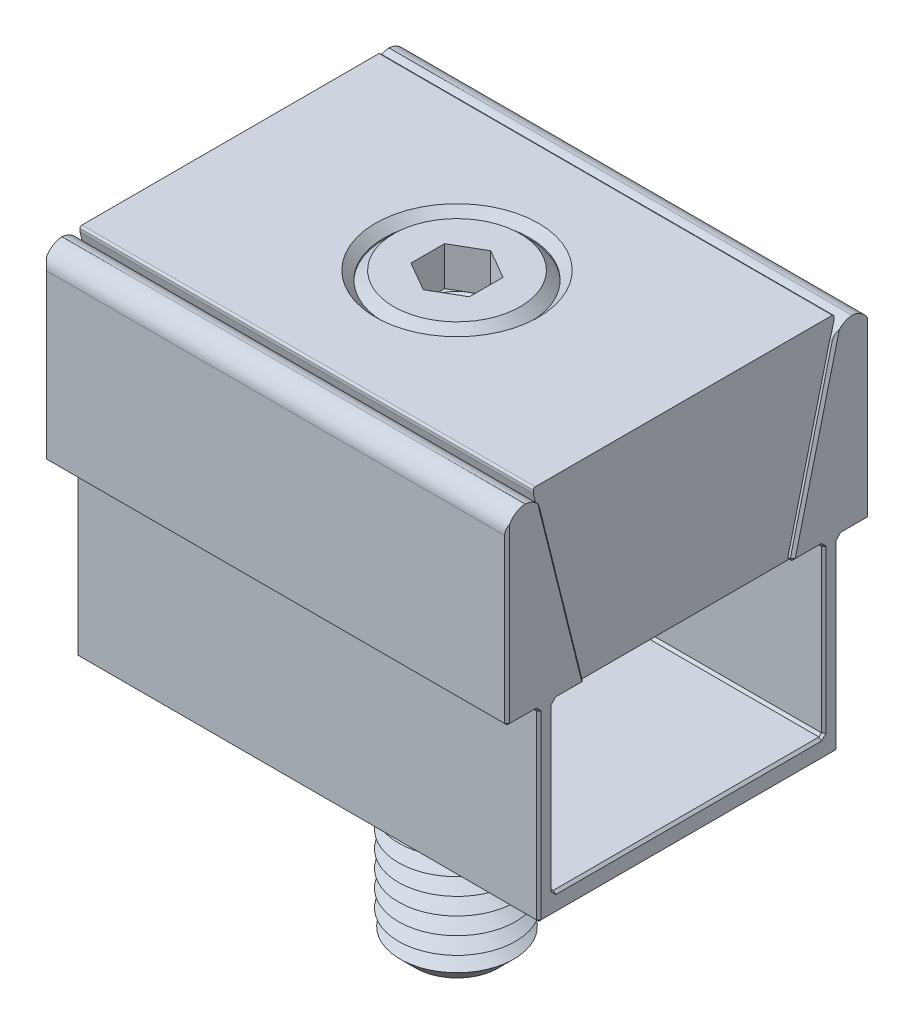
ISO-10303-21;
HEADER;
FILE_DESCRIPTION(('STEP AP214'),'2;1');
FILE_NAME('part.step','',(''),(''),'','','');
FILE_SCHEMA(('AUTOMOTIVE_DESIGN { 1 0 10303 214 1 1 1 1 }'));
ENDSEC;
DATA;
#1=APPLICATION_CONTEXT('core data for automotive mechanical design processes');
#2=APPLICATION_PROTOCOL_DEFINITION('international standard','automotive_design',2000,#1);
#3=PRODUCT_CONTEXT('',#1,'mechanical');
#4=PRODUCT('Part','Part','',(#3));
#5=PRODUCT_RELATED_PRODUCT_CATEGORY('part','',(#4));
#6=PRODUCT_DEFINITION_FORMATION('','',#4);
#7=PRODUCT_DEFINITION_CONTEXT('part definition',#1,'design');
#8=PRODUCT_DEFINITION('design','',#6,#7);
#9=PRODUCT_DEFINITION_SHAPE('','',#8);
#10=(LENGTH_UNIT() NAMED_UNIT(*) SI_UNIT(.MILLI.,.METRE.));
#11=(NAMED_UNIT(*) PLANE_ANGLE_UNIT() SI_UNIT($,.RADIAN.));
#12=(NAMED_UNIT(*) SI_UNIT($,.STERADIAN.) SOLID_ANGLE_UNIT());
#13=UNCERTAINTY_MEASURE_WITH_UNIT(LENGTH_MEASURE(1.E-05),#10,'distance_accuracy_value','');
#14=(GEOMETRIC_REPRESENTATION_CONTEXT(3) GLOBAL_UNCERTAINTY_ASSIGNED_CONTEXT((#13)) GLOBAL_UNIT_ASSIGNED_CONTEXT((#10,
#11,#12)) REPRESENTATION_CONTEXT('',''));
#15=CARTESIAN_POINT('',(0.,0.,0.));
#16=DIRECTION('',(0.,0.,1.));
#17=DIRECTION('',(1.,0.,0.));
#18=AXIS2_PLACEMENT_3D('',#15,#16,#17);
#19=CARTESIAN_POINT('',(0.,34.6,0.));
#20=DIRECTION('',(0.,1.,0.));
#21=DIRECTION('',(0.,0.,1.));
#22=AXIS2_PLACEMENT_3D('',#19,#20,#21);
#23=PLANE('',#22);
#24=CARTESIAN_POINT('',(0.,34.6,0.));
#25=DIRECTION('',(0.,1.,0.));
#26=DIRECTION('',(0.,0.,1.));
#27=AXIS2_PLACEMENT_3D('',#24,#25,#26);
#28=CIRCLE('',#27,3.);
#29=CARTESIAN_POINT('',(1.5,34.6,2.59807621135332));
#30=VERTEX_POINT('',#29);
#31=CARTESIAN_POINT('',(3.,34.6,0.));
#32=VERTEX_POINT('',#31);
#33=EDGE_CURVE('P0_E94',#30,#32,#28,.T.);
#34=ORIENTED_EDGE('',*,*,#33,.F.);
#35=DIRECTION('',(0.866025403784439,0.,-0.5));
#36=VECTOR('',#35,1.);
#37=CARTESIAN_POINT('',(0.,34.6,3.46410161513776));
#38=LINE('',#37,#36);
#39=CARTESIAN_POINT('',(3.,34.6,1.73205080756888));
#40=VERTEX_POINT('',#39);
#41=EDGE_CURVE('P0_E117',#30,#40,#38,.T.);
#42=ORIENTED_EDGE('',*,*,#41,.T.);
#43=DIRECTION('',(0.,0.,-1.));
#44=VECTOR('',#43,1.);
#45=CARTESIAN_POINT('',(3.,34.6,1.73205080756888));
#46=LINE('',#45,#44);
#47=EDGE_CURVE('P0_E113',#40,#32,#46,.T.);
#48=ORIENTED_EDGE('',*,*,#47,.T.);
#49=EDGE_LOOP('',(#34,#42,#48));
#50=FACE_BOUND('',#49,.T.);
#51=ADVANCED_FACE('P0_F16',(#50),#23,.T.);
#52=CARTESIAN_POINT('',(0.,34.6,0.));
#53=DIRECTION('',(0.,1.,0.));
#54=DIRECTION('',(0.,0.,1.));
#55=AXIS2_PLACEMENT_3D('',#52,#53,#54);
#56=CIRCLE('',#55,3.);
#57=CARTESIAN_POINT('',(1.5,34.6,-2.59807621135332));
#58=VERTEX_POINT('',#57);
#59=EDGE_CURVE('P0_E11',#32,#58,#56,.T.);
#60=ORIENTED_EDGE('',*,*,#59,.F.);
#61=CARTESIAN_POINT('',(3.,34.6,-1.73205080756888));
#62=VERTEX_POINT('',#61);
#63=EDGE_CURVE('P0_E105',#32,#62,#46,.T.);
#64=ORIENTED_EDGE('',*,*,#63,.T.);
#65=DIRECTION('',(-0.866025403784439,0.,-0.5));
#66=VECTOR('',#65,1.);
#67=CARTESIAN_POINT('',(3.,34.6,-1.73205080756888));
#68=LINE('',#67,#66);
#69=EDGE_CURVE('P0_E108',#62,#58,#68,.T.);
#70=ORIENTED_EDGE('',*,*,#69,.T.);
#71=EDGE_LOOP('',(#60,#64,#70));
#72=FACE_BOUND('',#71,.T.);
#73=ADVANCED_FACE('P0_F104',(#72),#23,.T.);
#74=CARTESIAN_POINT('',(-1.5,34.6,-2.59807621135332));
#75=VERTEX_POINT('',#74);
#76=EDGE_CURVE('P0_E25',#58,#75,#56,.T.);
#77=ORIENTED_EDGE('',*,*,#76,.F.);
#78=CARTESIAN_POINT('',(0.,34.6,-3.46410161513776));
#79=VERTEX_POINT('',#78);
#80=EDGE_CURVE('P0_E140',#58,#79,#68,.T.);
#81=ORIENTED_EDGE('',*,*,#80,.T.);
#82=DIRECTION('',(-0.866025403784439,0.,0.5));
#83=VECTOR('',#82,1.);
#84=CARTESIAN_POINT('',(0.,34.6,-3.46410161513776));
#85=LINE('',#84,#83);
#86=EDGE_CURVE('P0_E348',#79,#75,#85,.T.);
#87=ORIENTED_EDGE('',*,*,#86,.T.);
#88=EDGE_LOOP('',(#77,#81,#87));
#89=FACE_BOUND('',#88,.T.);
#90=ADVANCED_FACE('P0_F350',(#89),#23,.T.);
#91=CARTESIAN_POINT('',(-3.,34.6,0.));
#92=VERTEX_POINT('',#91);
#93=EDGE_CURVE('P0_E332',#75,#92,#56,.T.);
#94=ORIENTED_EDGE('',*,*,#93,.F.);
#95=CARTESIAN_POINT('',(-3.,34.6,-1.73205080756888));
#96=VERTEX_POINT('',#95);
#97=EDGE_CURVE('P0_E341',#75,#96,#85,.T.);
#98=ORIENTED_EDGE('',*,*,#97,.T.);
#99=DIRECTION('',(0.,0.,1.));
#100=VECTOR('',#99,1.);
#101=CARTESIAN_POINT('',(-3.,34.6,-1.73205080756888));
#102=LINE('',#101,#100);
#103=EDGE_CURVE('P0_E344',#96,#92,#102,.T.);
#104=ORIENTED_EDGE('',*,*,#103,.T.);
#105=EDGE_LOOP('',(#94,#98,#104));
#106=FACE_BOUND('',#105,.T.);
#107=ADVANCED_FACE('P0_F340',(#106),#23,.T.);
#108=CARTESIAN_POINT('',(-1.5,34.6,2.59807621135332));
#109=VERTEX_POINT('',#108);
#110=EDGE_CURVE('P0_E32',#92,#109,#56,.T.);
#111=ORIENTED_EDGE('',*,*,#110,.F.);
#112=CARTESIAN_POINT('',(-3.,34.6,1.73205080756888));
#113=VERTEX_POINT('',#112);
#114=EDGE_CURVE('P0_E351',#92,#113,#102,.T.);
#115=ORIENTED_EDGE('',*,*,#114,.T.);
#116=DIRECTION('',(0.866025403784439,0.,0.5));
#117=VECTOR('',#116,1.);
#118=CARTESIAN_POINT('',(-3.,34.6,1.73205080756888));
#119=LINE('',#118,#117);
#120=EDGE_CURVE('P0_E355',#113,#109,#119,.T.);
#121=ORIENTED_EDGE('',*,*,#120,.T.);
#122=EDGE_LOOP('',(#111,#115,#121));
#123=FACE_BOUND('',#122,.T.);
#124=ADVANCED_FACE('P0_F395',(#123),#23,.T.);
#125=CARTESIAN_POINT('',(0.,38.6,0.));
#126=DIRECTION('',(0.,1.,0.));
#127=DIRECTION('',(0.,0.,1.));
#128=AXIS2_PLACEMENT_3D('',#125,#126,#127);
#129=PLANE('',#128);
#130=DIRECTION('',(-0.866025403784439,0.,-0.5));
#131=VECTOR('',#130,1.);
#132=CARTESIAN_POINT('',(3.,38.6,-1.73205080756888));
#133=LINE('',#132,#131);
#134=CARTESIAN_POINT('',(3.,38.6,-1.73205080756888));
#135=VERTEX_POINT('',#134);
#136=CARTESIAN_POINT('',(0.,38.6,-3.46410161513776));
#137=VERTEX_POINT('',#136);
#138=EDGE_CURVE('P0_E40',#135,#137,#133,.T.);
#139=ORIENTED_EDGE('',*,*,#138,.F.);
#140=DIRECTION('',(0.,0.,-1.));
#141=VECTOR('',#140,1.);
#142=CARTESIAN_POINT('',(3.,38.6,1.73205080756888));
#143=LINE('',#142,#141);
#144=CARTESIAN_POINT('',(3.,38.6,1.73205080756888));
#145=VERTEX_POINT('',#144);
#146=EDGE_CURVE('P0_E138',#145,#135,#143,.T.);
#147=ORIENTED_EDGE('',*,*,#146,.F.);
#148=DIRECTION('',(0.866025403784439,0.,-0.5));
#149=VECTOR('',#148,1.);
#150=CARTESIAN_POINT('',(0.,38.6,3.46410161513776));
#151=LINE('',#150,#149);
#152=CARTESIAN_POINT('',(0.,38.6,3.46410161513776));
#153=VERTEX_POINT('',#152);
#154=EDGE_CURVE('P0_E135',#153,#145,#151,.T.);
#155=ORIENTED_EDGE('',*,*,#154,.F.);
#156=DIRECTION('',(0.866025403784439,0.,0.5));
#157=VECTOR('',#156,1.);
#158=CARTESIAN_POINT('',(-3.,38.6,1.73205080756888));
#159=LINE('',#158,#157);
#160=CARTESIAN_POINT('',(-3.,38.6,1.73205080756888));
#161=VERTEX_POINT('',#160);
#162=EDGE_CURVE('P0_E132',#161,#153,#159,.T.);
#163=ORIENTED_EDGE('',*,*,#162,.F.);
#164=DIRECTION('',(0.,0.,1.));
#165=VECTOR('',#164,1.);
#166=CARTESIAN_POINT('',(-3.,38.6,-1.73205080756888));
#167=LINE('',#166,#165);
#168=CARTESIAN_POINT('',(-3.,38.6,-1.73205080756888));
#169=VERTEX_POINT('',#168);
#170=EDGE_CURVE('P0_E129',#169,#161,#167,.T.);
#171=ORIENTED_EDGE('',*,*,#170,.F.);
#172=DIRECTION('',(-0.866025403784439,0.,0.5));
#173=VECTOR('',#172,1.);
#174=CARTESIAN_POINT('',(0.,38.6,-3.46410161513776));
#175=LINE('',#174,#173);
#176=EDGE_CURVE('P0_E126',#137,#169,#175,.T.);
#177=ORIENTED_EDGE('',*,*,#176,.F.);
#178=EDGE_LOOP('',(#139,#147,#155,#163,#171,#177));
#179=FACE_BOUND('',#178,.T.);
#180=CARTESIAN_POINT('',(0.,38.6,0.));
#181=DIRECTION('',(0.,1.,0.));
#182=DIRECTION('',(0.,0.,1.));
#183=AXIS2_PLACEMENT_3D('',#180,#181,#182);
#184=CIRCLE('',#183,6.49999999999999);
#185=CARTESIAN_POINT('',(0.,38.6,6.49999999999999));
#186=VERTEX_POINT('',#185);
#187=EDGE_CURVE('P0_E324',#186,#186,#184,.T.);
#188=ORIENTED_EDGE('',*,*,#187,.T.);
#189=EDGE_LOOP('',(#188));
#190=FACE_BOUND('',#189,.T.);
#191=ADVANCED_FACE('P0_F373',(#179,#190),#129,.T.);
#192=CARTESIAN_POINT('',(0.,98.8476336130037,0.));
#193=DIRECTION('',(0.,1.,0.));
#194=DIRECTION('',(0.,0.,1.));
#195=AXIS2_PLACEMENT_3D('',#192,#193,#194);
#196=CYLINDRICAL_SURFACE('',#195,7.5);
#197=CARTESIAN_POINT('',(0.,37.6,0.));
#198=DIRECTION('',(0.,1.,0.));
#199=DIRECTION('',(0.,0.,1.));
#200=AXIS2_PLACEMENT_3D('',#197,#198,#199);
#201=CIRCLE('',#200,7.5);
#202=CARTESIAN_POINT('',(0.,37.6,7.5));
#203=VERTEX_POINT('',#202);
#204=EDGE_CURVE('P0_E328',#203,#203,#201,.F.);
#205=ORIENTED_EDGE('',*,*,#204,.T.);
#206=EDGE_LOOP('',(#205));
#207=FACE_BOUND('',#206,.T.);
#208=CARTESIAN_POINT('',(0.,29.1,0.));
#209=DIRECTION('',(0.,1.,0.));
#210=DIRECTION('',(0.,0.,1.));
#211=AXIS2_PLACEMENT_3D('',#208,#209,#210);
#212=CIRCLE('',#211,7.5);
#213=CARTESIAN_POINT('',(0.,29.1,7.5));
#214=VERTEX_POINT('',#213);
#215=EDGE_CURVE('P0_E318',#214,#214,#212,.T.);
#216=ORIENTED_EDGE('',*,*,#215,.T.);
#217=EDGE_LOOP('',(#216));
#218=FACE_BOUND('',#217,.T.);
#219=ADVANCED_FACE('P0_F405',(#207,#218),#196,.T.);
#220=CARTESIAN_POINT('',(0.,29.1,7.5));
#221=DIRECTION('',(0.,-1.,0.));
#222=DIRECTION('',(0.,0.,-1.));
#223=AXIS2_PLACEMENT_3D('',#220,#221,#222);
#224=PLANE('',#223);
#225=CARTESIAN_POINT('',(0.,29.1,0.));
#226=DIRECTION('',(0.,1.,0.));
#227=DIRECTION('',(0.,0.,1.));
#228=AXIS2_PLACEMENT_3D('',#225,#226,#227);
#229=CIRCLE('',#228,6.);
#230=CARTESIAN_POINT('',(0.,29.1,6.));
#231=VERTEX_POINT('',#230);
#232=EDGE_CURVE('P0_E315',#231,#231,#229,.T.);
#233=ORIENTED_EDGE('',*,*,#232,.T.);
#234=EDGE_LOOP('',(#233));
#235=FACE_BOUND('',#234,.T.);
#236=ORIENTED_EDGE('',*,*,#215,.F.);
#237=EDGE_LOOP('',(#236));
#238=FACE_BOUND('',#237,.T.);
#239=ADVANCED_FACE('P0_F989',(#235,#238),#224,.T.);
#240=CARTESIAN_POINT('',(0.,28.225,0.));
#241=DIRECTION('',(0.,1.,0.));
#242=DIRECTION('',(0.,0.,1.));
#243=AXIS2_PLACEMENT_3D('',#240,#241,#242);
#244=CONICAL_SURFACE('',#243,4.48445554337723,1.0471975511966);
#245=ORIENTED_EDGE('',*,*,#232,.F.);
#246=EDGE_LOOP('',(#245));
#247=FACE_BOUND('',#246,.T.);
#248=CARTESIAN_POINT('',(0.,28.225,0.));
#249=DIRECTION('',(0.,1.,0.));
#250=DIRECTION('',(0.,0.,1.));
#251=AXIS2_PLACEMENT_3D('',#248,#249,#250);
#252=CIRCLE('',#251,4.48445554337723);
#253=CARTESIAN_POINT('',(0.,28.225,4.48445554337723));
#254=VERTEX_POINT('',#253);
#255=EDGE_CURVE('P0_E312',#254,#254,#252,.T.);
#256=ORIENTED_EDGE('',*,*,#255,.T.);
#257=EDGE_LOOP('',(#256));
#258=FACE_BOUND('',#257,.T.);
#259=ADVANCED_FACE('P0_F980',(#247,#258),#244,.T.);
#260=CARTESIAN_POINT('',(0.,27.35,0.));
#261=DIRECTION('',(0.,-1.,0.));
#262=DIRECTION('',(0.,0.,-1.));
#263=AXIS2_PLACEMENT_3D('',#260,#261,#262);
#264=CONICAL_SURFACE('',#263,6.,1.0471975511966);
#265=ORIENTED_EDGE('',*,*,#255,.F.);
#266=EDGE_LOOP('',(#265));
#267=FACE_BOUND('',#266,.T.);
#268=CARTESIAN_POINT('',(0.,27.35,0.));
#269=DIRECTION('',(0.,1.,0.));
#270=DIRECTION('',(0.,0.,1.));
#271=AXIS2_PLACEMENT_3D('',#268,#269,#270);
#272=CIRCLE('',#271,6.);
#273=CARTESIAN_POINT('',(0.,27.35,6.));
#274=VERTEX_POINT('',#273);
#275=EDGE_CURVE('P0_E309',#274,#274,#272,.T.);
#276=ORIENTED_EDGE('',*,*,#275,.T.);
#277=EDGE_LOOP('',(#276));
#278=FACE_BOUND('',#277,.T.);
#279=ADVANCED_FACE('P0_F971',(#267,#278),#264,.T.);
#280=CARTESIAN_POINT('',(0.,26.475,0.));
#281=DIRECTION('',(0.,1.,0.));
#282=DIRECTION('',(0.,0.,1.));
#283=AXIS2_PLACEMENT_3D('',#280,#281,#282);
#284=CONICAL_SURFACE('',#283,4.48445554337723,1.0471975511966);
#285=ORIENTED_EDGE('',*,*,#275,.F.);
#286=EDGE_LOOP('',(#285));
#287=FACE_BOUND('',#286,.T.);
#288=CARTESIAN_POINT('',(0.,26.475,0.));
#289=DIRECTION('',(0.,1.,0.));
#290=DIRECTION('',(0.,0.,1.));
#291=AXIS2_PLACEMENT_3D('',#288,#289,#290);
#292=CIRCLE('',#291,4.48445554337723);
#293=CARTESIAN_POINT('',(0.,26.475,4.48445554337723));
#294=VERTEX_POINT('',#293);
#295=EDGE_CURVE('P0_E306',#294,#294,#292,.T.);
#296=ORIENTED_EDGE('',*,*,#295,.T.);
#297=EDGE_LOOP('',(#296));
#298=FACE_BOUND('',#297,.T.);
#299=ADVANCED_FACE('P0_F962',(#287,#298),#284,.T.);
#300=CARTESIAN_POINT('',(0.,25.6,0.));
#301=DIRECTION('',(0.,-1.,0.));
#302=DIRECTION('',(0.,0.,-1.));
#303=AXIS2_PLACEMENT_3D('',#300,#301,#302);
#304=CONICAL_SURFACE('',#303,6.,1.0471975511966);
#305=ORIENTED_EDGE('',*,*,#295,.F.);
#306=EDGE_LOOP('',(#305));
#307=FACE_BOUND('',#306,.T.);
#308=CARTESIAN_POINT('',(0.,25.6,0.));
#309=DIRECTION('',(0.,1.,0.));
#310=DIRECTION('',(0.,0.,1.));
#311=AXIS2_PLACEMENT_3D('',#308,#309,#310);
#312=CIRCLE('',#311,6.);
#313=CARTESIAN_POINT('',(0.,25.6,6.));
#314=VERTEX_POINT('',#313);
#315=EDGE_CURVE('P0_E303',#314,#314,#312,.T.);
#316=ORIENTED_EDGE('',*,*,#315,.T.);
#317=EDGE_LOOP('',(#316));
#318=FACE_BOUND('',#317,.T.);
#319=ADVANCED_FACE('P0_F953',(#307,#318),#304,.T.);
#320=CARTESIAN_POINT('',(0.,24.725,0.));
#321=DIRECTION('',(0.,1.,0.));
#322=DIRECTION('',(0.,0.,1.));
#323=AXIS2_PLACEMENT_3D('',#320,#321,#322);
#324=CONICAL_SURFACE('',#323,4.48445554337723,1.0471975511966);
#325=ORIENTED_EDGE('',*,*,#315,.F.);
#326=EDGE_LOOP('',(#325));
#327=FACE_BOUND('',#326,.T.);
#328=CARTESIAN_POINT('',(0.,24.725,0.));
#329=DIRECTION('',(0.,1.,0.));
#330=DIRECTION('',(0.,0.,1.));
#331=AXIS2_PLACEMENT_3D('',#328,#329,#330);
#332=CIRCLE('',#331,4.48445554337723);
#333=CARTESIAN_POINT('',(0.,24.725,4.48445554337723));
#334=VERTEX_POINT('',#333);
#335=EDGE_CURVE('P0_E300',#334,#334,#332,.T.);
#336=ORIENTED_EDGE('',*,*,#335,.T.);
#337=EDGE_LOOP('',(#336));
#338=FACE_BOUND('',#337,.T.);
#339=ADVANCED_FACE('P0_F944',(#327,#338),#324,.T.);
#340=CARTESIAN_POINT('',(0.,23.85,0.));
#341=DIRECTION('',(0.,-1.,0.));
#342=DIRECTION('',(0.,0.,-1.));
#343=AXIS2_PLACEMENT_3D('',#340,#341,#342);
#344=CONICAL_SURFACE('',#343,6.,1.0471975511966);
#345=ORIENTED_EDGE('',*,*,#335,.F.);
#346=EDGE_LOOP('',(#345));
#347=FACE_BOUND('',#346,.T.);
#348=CARTESIAN_POINT('',(0.,23.85,0.));
#349=DIRECTION('',(0.,1.,0.));
#350=DIRECTION('',(0.,0.,1.));
#351=AXIS2_PLACEMENT_3D('',#348,#349,#350);
#352=CIRCLE('',#351,6.);
#353=CARTESIAN_POINT('',(0.,23.85,6.));
#354=VERTEX_POINT('',#353);
#355=EDGE_CURVE('P0_E297',#354,#354,#352,.T.);
#356=ORIENTED_EDGE('',*,*,#355,.T.);
#357=EDGE_LOOP('',(#356));
#358=FACE_BOUND('',#357,.T.);
#359=ADVANCED_FACE('P0_F935',(#347,#358),#344,.T.);
#360=CARTESIAN_POINT('',(0.,22.975,0.));
#361=DIRECTION('',(0.,1.,0.));
#362=DIRECTION('',(0.,0.,1.));
#363=AXIS2_PLACEMENT_3D('',#360,#361,#362);
#364=CONICAL_SURFACE('',#363,4.48445554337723,1.0471975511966);
#365=ORIENTED_EDGE('',*,*,#355,.F.);
#366=EDGE_LOOP('',(#365));
#367=FACE_BOUND('',#366,.T.);
#368=CARTESIAN_POINT('',(0.,22.975,0.));
#369=DIRECTION('',(0.,1.,0.));
#370=DIRECTION('',(0.,0.,1.));
#371=AXIS2_PLACEMENT_3D('',#368,#369,#370);
#372=CIRCLE('',#371,4.48445554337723);
#373=CARTESIAN_POINT('',(0.,22.975,4.48445554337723));
#374=VERTEX_POINT('',#373);
#375=EDGE_CURVE('P0_E294',#374,#374,#372,.T.);
#376=ORIENTED_EDGE('',*,*,#375,.T.);
#377=EDGE_LOOP('',(#376));
#378=FACE_BOUND('',#377,.T.);
#379=ADVANCED_FACE('P0_F926',(#367,#378),#364,.T.);
#380=CARTESIAN_POINT('',(0.,22.1,0.));
#381=DIRECTION('',(0.,-1.,0.));
#382=DIRECTION('',(0.,0.,-1.));
#383=AXIS2_PLACEMENT_3D('',#380,#381,#382);
#384=CONICAL_SURFACE('',#383,6.,1.0471975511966);
#385=ORIENTED_EDGE('',*,*,#375,.F.);
#386=EDGE_LOOP('',(#385));
#387=FACE_BOUND('',#386,.T.);
#388=CARTESIAN_POINT('',(0.,22.1,0.));
#389=DIRECTION('',(0.,1.,0.));
#390=DIRECTION('',(0.,0.,1.));
#391=AXIS2_PLACEMENT_3D('',#388,#389,#390);
#392=CIRCLE('',#391,6.);
#393=CARTESIAN_POINT('',(0.,22.1,6.));
#394=VERTEX_POINT('',#393);
#395=EDGE_CURVE('P0_E291',#394,#394,#392,.T.);
#396=ORIENTED_EDGE('',*,*,#395,.T.);
#397=EDGE_LOOP('',(#396));
#398=FACE_BOUND('',#397,.T.);
#399=ADVANCED_FACE('P0_F917',(#387,#398),#384,.T.);
#400=CARTESIAN_POINT('',(0.,21.225,0.));
#401=DIRECTION('',(0.,1.,0.));
#402=DIRECTION('',(0.,0.,1.));
#403=AXIS2_PLACEMENT_3D('',#400,#401,#402);
#404=CONICAL_SURFACE('',#403,4.48445554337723,1.0471975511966);
#405=ORIENTED_EDGE('',*,*,#395,.F.);
#406=EDGE_LOOP('',(#405));
#407=FACE_BOUND('',#406,.T.);
#408=CARTESIAN_POINT('',(0.,21.225,0.));
#409=DIRECTION('',(0.,1.,0.));
#410=DIRECTION('',(0.,0.,1.));
#411=AXIS2_PLACEMENT_3D('',#408,#409,#410);
#412=CIRCLE('',#411,4.48445554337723);
#413=CARTESIAN_POINT('',(0.,21.225,4.48445554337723));
#414=VERTEX_POINT('',#413);
#415=EDGE_CURVE('P0_E288',#414,#414,#412,.T.);
#416=ORIENTED_EDGE('',*,*,#415,.T.);
#417=EDGE_LOOP('',(#416));
#418=FACE_BOUND('',#417,.T.);
#419=ADVANCED_FACE('P0_F908',(#407,#418),#404,.T.);
#420=CARTESIAN_POINT('',(0.,20.35,0.));
#421=DIRECTION('',(0.,-1.,0.));
#422=DIRECTION('',(0.,0.,-1.));
#423=AXIS2_PLACEMENT_3D('',#420,#421,#422);
#424=CONICAL_SURFACE('',#423,6.,1.0471975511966);
#425=ORIENTED_EDGE('',*,*,#415,.F.);
#426=EDGE_LOOP('',(#425));
#427=FACE_BOUND('',#426,.T.);
#428=CARTESIAN_POINT('',(0.,20.35,0.));
#429=DIRECTION('',(0.,1.,0.));
#430=DIRECTION('',(0.,0.,1.));
#431=AXIS2_PLACEMENT_3D('',#428,#429,#430);
#432=CIRCLE('',#431,6.);
#433=CARTESIAN_POINT('',(0.,20.35,6.));
#434=VERTEX_POINT('',#433);
#435=EDGE_CURVE('P0_E285',#434,#434,#432,.T.);
#436=ORIENTED_EDGE('',*,*,#435,.T.);
#437=EDGE_LOOP('',(#436));
#438=FACE_BOUND('',#437,.T.);
#439=ADVANCED_FACE('P0_F899',(#427,#438),#424,.T.);
#440=CARTESIAN_POINT('',(0.,19.475,0.));
#441=DIRECTION('',(0.,1.,0.));
#442=DIRECTION('',(0.,0.,1.));
#443=AXIS2_PLACEMENT_3D('',#440,#441,#442);
#444=CONICAL_SURFACE('',#443,4.48445554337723,1.0471975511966);
#445=ORIENTED_EDGE('',*,*,#435,.F.);
#446=EDGE_LOOP('',(#445));
#447=FACE_BOUND('',#446,.T.);
#448=CARTESIAN_POINT('',(0.,19.475,0.));
#449=DIRECTION('',(0.,1.,0.));
#450=DIRECTION('',(0.,0.,1.));
#451=AXIS2_PLACEMENT_3D('',#448,#449,#450);
#452=CIRCLE('',#451,4.48445554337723);
#453=CARTESIAN_POINT('',(0.,19.475,4.48445554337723));
#454=VERTEX_POINT('',#453);
#455=EDGE_CURVE('P0_E282',#454,#454,#452,.T.);
#456=ORIENTED_EDGE('',*,*,#455,.T.);
#457=EDGE_LOOP('',(#456));
#458=FACE_BOUND('',#457,.T.);
#459=ADVANCED_FACE('P0_F890',(#447,#458),#444,.T.);
#460=CARTESIAN_POINT('',(0.,18.6,0.));
#461=DIRECTION('',(0.,-1.,0.));
#462=DIRECTION('',(0.,0.,-1.));
#463=AXIS2_PLACEMENT_3D('',#460,#461,#462);
#464=CONICAL_SURFACE('',#463,6.,1.0471975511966);
#465=ORIENTED_EDGE('',*,*,#455,.F.);
#466=EDGE_LOOP('',(#465));
#467=FACE_BOUND('',#466,.T.);
#468=CARTESIAN_POINT('',(0.,18.6,0.));
#469=DIRECTION('',(0.,1.,0.));
#470=DIRECTION('',(0.,0.,1.));
#471=AXIS2_PLACEMENT_3D('',#468,#469,#470);
#472=CIRCLE('',#471,6.);
#473=CARTESIAN_POINT('',(0.,18.6,6.));
#474=VERTEX_POINT('',#473);
#475=EDGE_CURVE('P0_E279',#474,#474,#472,.T.);
#476=ORIENTED_EDGE('',*,*,#475,.T.);
#477=EDGE_LOOP('',(#476));
#478=FACE_BOUND('',#477,.T.);
#479=ADVANCED_FACE('P0_F881',(#467,#478),#464,.T.);
#480=CARTESIAN_POINT('',(0.,17.725,0.));
#481=DIRECTION('',(0.,1.,0.));
#482=DIRECTION('',(0.,0.,1.));
#483=AXIS2_PLACEMENT_3D('',#480,#481,#482);
#484=CONICAL_SURFACE('',#483,4.48445554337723,1.0471975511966);
#485=ORIENTED_EDGE('',*,*,#475,.F.);
#486=EDGE_LOOP('',(#485));
#487=FACE_BOUND('',#486,.T.);
#488=CARTESIAN_POINT('',(0.,17.725,0.));
#489=DIRECTION('',(0.,1.,0.));
#490=DIRECTION('',(0.,0.,1.));
#491=AXIS2_PLACEMENT_3D('',#488,#489,#490);
#492=CIRCLE('',#491,4.48445554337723);
#493=CARTESIAN_POINT('',(0.,17.725,4.48445554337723));
#494=VERTEX_POINT('',#493);
#495=EDGE_CURVE('P0_E276',#494,#494,#492,.T.);
#496=ORIENTED_EDGE('',*,*,#495,.T.);
#497=EDGE_LOOP('',(#496));
#498=FACE_BOUND('',#497,.T.);
#499=ADVANCED_FACE('P0_F872',(#487,#498),#484,.T.);
#500=CARTESIAN_POINT('',(0.,16.85,0.));
#501=DIRECTION('',(0.,-1.,0.));
#502=DIRECTION('',(0.,0.,-1.));
#503=AXIS2_PLACEMENT_3D('',#500,#501,#502);
#504=CONICAL_SURFACE('',#503,6.,1.0471975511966);
#505=ORIENTED_EDGE('',*,*,#495,.F.);
#506=EDGE_LOOP('',(#505));
#507=FACE_BOUND('',#506,.T.);
#508=CARTESIAN_POINT('',(0.,16.85,0.));
#509=DIRECTION('',(0.,1.,0.));
#510=DIRECTION('',(0.,0.,1.));
#511=AXIS2_PLACEMENT_3D('',#508,#509,#510);
#512=CIRCLE('',#511,6.);
#513=CARTESIAN_POINT('',(0.,16.85,6.));
#514=VERTEX_POINT('',#513);
#515=EDGE_CURVE('P0_E273',#514,#514,#512,.T.);
#516=ORIENTED_EDGE('',*,*,#515,.T.);
#517=EDGE_LOOP('',(#516));
#518=FACE_BOUND('',#517,.T.);
#519=ADVANCED_FACE('P0_F863',(#507,#518),#504,.T.);
#520=CARTESIAN_POINT('',(0.,15.975,0.));
#521=DIRECTION('',(0.,1.,0.));
#522=DIRECTION('',(0.,0.,1.));
#523=AXIS2_PLACEMENT_3D('',#520,#521,#522);
#524=CONICAL_SURFACE('',#523,4.48445554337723,1.0471975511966);
#525=ORIENTED_EDGE('',*,*,#515,.F.);
#526=EDGE_LOOP('',(#525));
#527=FACE_BOUND('',#526,.T.);
#528=CARTESIAN_POINT('',(0.,15.975,0.));
#529=DIRECTION('',(0.,1.,0.));
#530=DIRECTION('',(0.,0.,1.));
#531=AXIS2_PLACEMENT_3D('',#528,#529,#530);
#532=CIRCLE('',#531,4.48445554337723);
#533=CARTESIAN_POINT('',(0.,15.975,4.48445554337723));
#534=VERTEX_POINT('',#533);
#535=EDGE_CURVE('P0_E270',#534,#534,#532,.T.);
#536=ORIENTED_EDGE('',*,*,#535,.T.);
#537=EDGE_LOOP('',(#536));
#538=FACE_BOUND('',#537,.T.);
#539=ADVANCED_FACE('P0_F854',(#527,#538),#524,.T.);
#540=CARTESIAN_POINT('',(0.,15.1,0.));
#541=DIRECTION('',(0.,-1.,0.));
#542=DIRECTION('',(0.,0.,-1.));
#543=AXIS2_PLACEMENT_3D('',#540,#541,#542);
#544=CONICAL_SURFACE('',#543,6.,1.0471975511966);
#545=ORIENTED_EDGE('',*,*,#535,.F.);
#546=EDGE_LOOP('',(#545));
#547=FACE_BOUND('',#546,.T.);
#548=CARTESIAN_POINT('',(0.,15.1,0.));
#549=DIRECTION('',(0.,1.,0.));
#550=DIRECTION('',(0.,0.,1.));
#551=AXIS2_PLACEMENT_3D('',#548,#549,#550);
#552=CIRCLE('',#551,6.);
#553=CARTESIAN_POINT('',(0.,15.1,6.));
#554=VERTEX_POINT('',#553);
#555=EDGE_CURVE('P0_E267',#554,#554,#552,.T.);
#556=ORIENTED_EDGE('',*,*,#555,.T.);
#557=EDGE_LOOP('',(#556));
#558=FACE_BOUND('',#557,.T.);
#559=ADVANCED_FACE('P0_F845',(#547,#558),#544,.T.);
#560=CARTESIAN_POINT('',(0.,14.225,0.));
#561=DIRECTION('',(0.,1.,0.));
#562=DIRECTION('',(0.,0.,1.));
#563=AXIS2_PLACEMENT_3D('',#560,#561,#562);
#564=CONICAL_SURFACE('',#563,4.48445554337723,1.0471975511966);
#565=ORIENTED_EDGE('',*,*,#555,.F.);
#566=EDGE_LOOP('',(#565));
#567=FACE_BOUND('',#566,.T.);
#568=CARTESIAN_POINT('',(0.,14.225,0.));
#569=DIRECTION('',(0.,1.,0.));
#570=DIRECTION('',(0.,0.,1.));
#571=AXIS2_PLACEMENT_3D('',#568,#569,#570);
#572=CIRCLE('',#571,4.48445554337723);
#573=CARTESIAN_POINT('',(0.,14.225,4.48445554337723));
#574=VERTEX_POINT('',#573);
#575=EDGE_CURVE('P0_E264',#574,#574,#572,.T.);
#576=ORIENTED_EDGE('',*,*,#575,.T.);
#577=EDGE_LOOP('',(#576));
#578=FACE_BOUND('',#577,.T.);
#579=ADVANCED_FACE('P0_F836',(#567,#578),#564,.T.);
#580=CARTESIAN_POINT('',(0.,13.35,0.));
#581=DIRECTION('',(0.,-1.,0.));
#582=DIRECTION('',(0.,0.,-1.));
#583=AXIS2_PLACEMENT_3D('',#580,#581,#582);
#584=CONICAL_SURFACE('',#583,6.,1.0471975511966);
#585=ORIENTED_EDGE('',*,*,#575,.F.);
#586=EDGE_LOOP('',(#585));
#587=FACE_BOUND('',#586,.T.);
#588=CARTESIAN_POINT('',(0.,13.35,0.));
#589=DIRECTION('',(0.,1.,0.));
#590=DIRECTION('',(0.,0.,1.));
#591=AXIS2_PLACEMENT_3D('',#588,#589,#590);
#592=CIRCLE('',#591,6.);
#593=CARTESIAN_POINT('',(0.,13.35,6.));
#594=VERTEX_POINT('',#593);
#595=EDGE_CURVE('P0_E261',#594,#594,#592,.T.);
#596=ORIENTED_EDGE('',*,*,#595,.T.);
#597=EDGE_LOOP('',(#596));
#598=FACE_BOUND('',#597,.T.);
#599=ADVANCED_FACE('P0_F827',(#587,#598),#584,.T.);
#600=CARTESIAN_POINT('',(0.,12.475,0.));
#601=DIRECTION('',(0.,1.,0.));
#602=DIRECTION('',(0.,0.,1.));
#603=AXIS2_PLACEMENT_3D('',#600,#601,#602);
#604=CONICAL_SURFACE('',#603,4.48445554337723,1.0471975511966);
#605=ORIENTED_EDGE('',*,*,#595,.F.);
#606=EDGE_LOOP('',(#605));
#607=FACE_BOUND('',#606,.T.);
#608=CARTESIAN_POINT('',(0.,12.475,0.));
#609=DIRECTION('',(0.,1.,0.));
#610=DIRECTION('',(0.,0.,1.));
#611=AXIS2_PLACEMENT_3D('',#608,#609,#610);
#612=CIRCLE('',#611,4.48445554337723);
#613=CARTESIAN_POINT('',(0.,12.475,4.48445554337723));
#614=VERTEX_POINT('',#613);
#615=EDGE_CURVE('P0_E258',#614,#614,#612,.T.);
#616=ORIENTED_EDGE('',*,*,#615,.T.);
#617=EDGE_LOOP('',(#616));
#618=FACE_BOUND('',#617,.T.);
#619=ADVANCED_FACE('P0_F818',(#607,#618),#604,.T.);
#620=CARTESIAN_POINT('',(0.,11.6,0.));
#621=DIRECTION('',(0.,-1.,0.));
#622=DIRECTION('',(0.,0.,-1.));
#623=AXIS2_PLACEMENT_3D('',#620,#621,#622);
#624=CONICAL_SURFACE('',#623,6.,1.0471975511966);
#625=ORIENTED_EDGE('',*,*,#615,.F.);
#626=EDGE_LOOP('',(#625));
#627=FACE_BOUND('',#626,.T.);
#628=CARTESIAN_POINT('',(0.,11.6,0.));
#629=DIRECTION('',(0.,1.,0.));
#630=DIRECTION('',(0.,0.,1.));
#631=AXIS2_PLACEMENT_3D('',#628,#629,#630);
#632=CIRCLE('',#631,6.);
#633=CARTESIAN_POINT('',(0.,11.6,6.));
#634=VERTEX_POINT('',#633);
#635=EDGE_CURVE('P0_E255',#634,#634,#632,.T.);
#636=ORIENTED_EDGE('',*,*,#635,.T.);
#637=EDGE_LOOP('',(#636));
#638=FACE_BOUND('',#637,.T.);
#639=ADVANCED_FACE('P0_F809',(#627,#638),#624,.T.);
#640=CARTESIAN_POINT('',(0.,10.725,0.));
#641=DIRECTION('',(0.,1.,0.));
#642=DIRECTION('',(0.,0.,1.));
#643=AXIS2_PLACEMENT_3D('',#640,#641,#642);
#644=CONICAL_SURFACE('',#643,4.48445554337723,1.0471975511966);
#645=ORIENTED_EDGE('',*,*,#635,.F.);
#646=EDGE_LOOP('',(#645));
#647=FACE_BOUND('',#646,.T.);
#648=CARTESIAN_POINT('',(0.,10.725,0.));
#649=DIRECTION('',(0.,1.,0.));
#650=DIRECTION('',(0.,0.,1.));
#651=AXIS2_PLACEMENT_3D('',#648,#649,#650);
#652=CIRCLE('',#651,4.48445554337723);
#653=CARTESIAN_POINT('',(0.,10.725,4.48445554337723));
#654=VERTEX_POINT('',#653);
#655=EDGE_CURVE('P0_E252',#654,#654,#652,.T.);
#656=ORIENTED_EDGE('',*,*,#655,.T.);
#657=EDGE_LOOP('',(#656));
#658=FACE_BOUND('',#657,.T.);
#659=ADVANCED_FACE('P0_F800',(#647,#658),#644,.T.);
#660=CARTESIAN_POINT('',(0.,9.85000000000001,0.));
#661=DIRECTION('',(0.,-1.,0.));
#662=DIRECTION('',(0.,0.,-1.));
#663=AXIS2_PLACEMENT_3D('',#660,#661,#662);
#664=CONICAL_SURFACE('',#663,6.,1.0471975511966);
#665=ORIENTED_EDGE('',*,*,#655,.F.);
#666=EDGE_LOOP('',(#665));
#667=FACE_BOUND('',#666,.T.);
#668=CARTESIAN_POINT('',(0.,9.85000000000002,0.));
#669=DIRECTION('',(0.,1.,0.));
#670=DIRECTION('',(0.,0.,1.));
#671=AXIS2_PLACEMENT_3D('',#668,#669,#670);
#672=CIRCLE('',#671,6.);
#673=CARTESIAN_POINT('',(0.,9.85000000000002,6.));
#674=VERTEX_POINT('',#673);
#675=EDGE_CURVE('P0_E249',#674,#674,#672,.T.);
#676=ORIENTED_EDGE('',*,*,#675,.T.);
#677=EDGE_LOOP('',(#676));
#678=FACE_BOUND('',#677,.T.);
#679=ADVANCED_FACE('P0_F791',(#667,#678),#664,.T.);
#680=CARTESIAN_POINT('',(0.,8.97500000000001,0.));
#681=DIRECTION('',(0.,1.,0.));
#682=DIRECTION('',(0.,0.,1.));
#683=AXIS2_PLACEMENT_3D('',#680,#681,#682);
#684=CONICAL_SURFACE('',#683,4.48445554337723,1.0471975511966);
#685=ORIENTED_EDGE('',*,*,#675,.F.);
#686=EDGE_LOOP('',(#685));
#687=FACE_BOUND('',#686,.T.);
#688=CARTESIAN_POINT('',(0.,8.97500000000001,0.));
#689=DIRECTION('',(0.,1.,0.));
#690=DIRECTION('',(0.,0.,1.));
#691=AXIS2_PLACEMENT_3D('',#688,#689,#690);
#692=CIRCLE('',#691,4.48445554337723);
#693=CARTESIAN_POINT('',(0.,8.97500000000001,4.48445554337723));
#694=VERTEX_POINT('',#693);
#695=EDGE_CURVE('P0_E246',#694,#694,#692,.T.);
#696=ORIENTED_EDGE('',*,*,#695,.T.);
#697=EDGE_LOOP('',(#696));
#698=FACE_BOUND('',#697,.T.);
#699=ADVANCED_FACE('P0_F782',(#687,#698),#684,.T.);
#700=CARTESIAN_POINT('',(0.,8.10000000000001,0.));
#701=DIRECTION('',(0.,-1.,0.));
#702=DIRECTION('',(0.,0.,-1.));
#703=AXIS2_PLACEMENT_3D('',#700,#701,#702);
#704=CONICAL_SURFACE('',#703,6.,1.0471975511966);
#705=ORIENTED_EDGE('',*,*,#695,.F.);
#706=EDGE_LOOP('',(#705));
#707=FACE_BOUND('',#706,.T.);
#708=CARTESIAN_POINT('',(0.,8.10000000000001,0.));
#709=DIRECTION('',(0.,1.,0.));
#710=DIRECTION('',(0.,0.,1.));
#711=AXIS2_PLACEMENT_3D('',#708,#709,#710);
#712=CIRCLE('',#711,6.);
#713=CARTESIAN_POINT('',(0.,8.10000000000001,6.));
#714=VERTEX_POINT('',#713);
#715=EDGE_CURVE('P0_E243',#714,#714,#712,.T.);
#716=ORIENTED_EDGE('',*,*,#715,.T.);
#717=EDGE_LOOP('',(#716));
#718=FACE_BOUND('',#717,.T.);
#719=ADVANCED_FACE('P0_F773',(#707,#718),#704,.T.);
#720=CARTESIAN_POINT('',(0.,7.22500000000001,0.));
#721=DIRECTION('',(0.,1.,0.));
#722=DIRECTION('',(0.,0.,1.));
#723=AXIS2_PLACEMENT_3D('',#720,#721,#722);
#724=CONICAL_SURFACE('',#723,4.48445554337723,1.0471975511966);
#725=ORIENTED_EDGE('',*,*,#715,.F.);
#726=EDGE_LOOP('',(#725));
#727=FACE_BOUND('',#726,.T.);
#728=CARTESIAN_POINT('',(0.,7.22500000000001,0.));
#729=DIRECTION('',(0.,1.,0.));
#730=DIRECTION('',(0.,0.,1.));
#731=AXIS2_PLACEMENT_3D('',#728,#729,#730);
#732=CIRCLE('',#731,4.48445554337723);
#733=CARTESIAN_POINT('',(0.,7.22500000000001,4.48445554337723));
#734=VERTEX_POINT('',#733);
#735=EDGE_CURVE('P0_E240',#734,#734,#732,.T.);
#736=ORIENTED_EDGE('',*,*,#735,.T.);
#737=EDGE_LOOP('',(#736));
#738=FACE_BOUND('',#737,.T.);
#739=ADVANCED_FACE('P0_F764',(#727,#738),#724,.T.);
#740=CARTESIAN_POINT('',(0.,6.35000000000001,0.));
#741=DIRECTION('',(0.,-1.,0.));
#742=DIRECTION('',(0.,0.,-1.));
#743=AXIS2_PLACEMENT_3D('',#740,#741,#742);
#744=CONICAL_SURFACE('',#743,6.,1.0471975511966);
#745=ORIENTED_EDGE('',*,*,#735,.F.);
#746=EDGE_LOOP('',(#745));
#747=FACE_BOUND('',#746,.T.);
#748=CARTESIAN_POINT('',(0.,6.35000000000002,0.));
#749=DIRECTION('',(0.,1.,0.));
#750=DIRECTION('',(0.,0.,1.));
#751=AXIS2_PLACEMENT_3D('',#748,#749,#750);
#752=CIRCLE('',#751,6.);
#753=CARTESIAN_POINT('',(0.,6.35000000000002,6.));
#754=VERTEX_POINT('',#753);
#755=EDGE_CURVE('P0_E237',#754,#754,#752,.T.);
#756=ORIENTED_EDGE('',*,*,#755,.T.);
#757=EDGE_LOOP('',(#756));
#758=FACE_BOUND('',#757,.T.);
#759=ADVANCED_FACE('P0_F755',(#747,#758),#744,.T.);
#760=CARTESIAN_POINT('',(0.,5.47500000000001,0.));
#761=DIRECTION('',(0.,1.,0.));
#762=DIRECTION('',(0.,0.,1.));
#763=AXIS2_PLACEMENT_3D('',#760,#761,#762);
#764=CONICAL_SURFACE('',#763,4.48445554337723,1.0471975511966);
#765=ORIENTED_EDGE('',*,*,#755,.F.);
#766=EDGE_LOOP('',(#765));
#767=FACE_BOUND('',#766,.T.);
#768=CARTESIAN_POINT('',(0.,5.47500000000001,0.));
#769=DIRECTION('',(0.,1.,0.));
#770=DIRECTION('',(0.,0.,1.));
#771=AXIS2_PLACEMENT_3D('',#768,#769,#770);
#772=CIRCLE('',#771,4.48445554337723);
#773=CARTESIAN_POINT('',(0.,5.47500000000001,4.48445554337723));
#774=VERTEX_POINT('',#773);
#775=EDGE_CURVE('P0_E234',#774,#774,#772,.T.);
#776=ORIENTED_EDGE('',*,*,#775,.T.);
#777=EDGE_LOOP('',(#776));
#778=FACE_BOUND('',#777,.T.);
#779=ADVANCED_FACE('P0_F746',(#767,#778),#764,.T.);
#780=CARTESIAN_POINT('',(0.,4.60000000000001,0.));
#781=DIRECTION('',(0.,-1.,0.));
#782=DIRECTION('',(0.,0.,-1.));
#783=AXIS2_PLACEMENT_3D('',#780,#781,#782);
#784=CONICAL_SURFACE('',#783,6.,1.0471975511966);
#785=ORIENTED_EDGE('',*,*,#775,.F.);
#786=EDGE_LOOP('',(#785));
#787=FACE_BOUND('',#786,.T.);
#788=CARTESIAN_POINT('',(0.,4.60000000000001,0.));
#789=DIRECTION('',(0.,1.,0.));
#790=DIRECTION('',(0.,0.,1.));
#791=AXIS2_PLACEMENT_3D('',#788,#789,#790);
#792=CIRCLE('',#791,6.);
#793=CARTESIAN_POINT('',(0.,4.60000000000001,6.));
#794=VERTEX_POINT('',#793);
#795=EDGE_CURVE('P0_E231',#794,#794,#792,.T.);
#796=ORIENTED_EDGE('',*,*,#795,.T.);
#797=EDGE_LOOP('',(#796));
#798=FACE_BOUND('',#797,.T.);
#799=ADVANCED_FACE('P0_F737',(#787,#798),#784,.T.);
#800=CARTESIAN_POINT('',(0.,3.72500000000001,0.));
#801=DIRECTION('',(0.,1.,0.));
#802=DIRECTION('',(0.,0.,1.));
#803=AXIS2_PLACEMENT_3D('',#800,#801,#802);
#804=CONICAL_SURFACE('',#803,4.48445554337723,1.0471975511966);
#805=ORIENTED_EDGE('',*,*,#795,.F.);
#806=EDGE_LOOP('',(#805));
#807=FACE_BOUND('',#806,.T.);
#808=CARTESIAN_POINT('',(0.,3.72500000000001,0.));
#809=DIRECTION('',(0.,1.,0.));
#810=DIRECTION('',(0.,0.,1.));
#811=AXIS2_PLACEMENT_3D('',#808,#809,#810);
#812=CIRCLE('',#811,4.48445554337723);
#813=CARTESIAN_POINT('',(0.,3.72500000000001,4.48445554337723));
#814=VERTEX_POINT('',#813);
#815=EDGE_CURVE('P0_E228',#814,#814,#812,.T.);
#816=ORIENTED_EDGE('',*,*,#815,.T.);
#817=EDGE_LOOP('',(#816));
#818=FACE_BOUND('',#817,.T.);
#819=ADVANCED_FACE('P0_F728',(#807,#818),#804,.T.);
#820=CARTESIAN_POINT('',(0.,2.85000000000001,0.));
#821=DIRECTION('',(0.,-1.,0.));
#822=DIRECTION('',(0.,0.,-1.));
#823=AXIS2_PLACEMENT_3D('',#820,#821,#822);
#824=CONICAL_SURFACE('',#823,6.,1.0471975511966);
#825=ORIENTED_EDGE('',*,*,#815,.F.);
#826=EDGE_LOOP('',(#825));
#827=FACE_BOUND('',#826,.T.);
#828=CARTESIAN_POINT('',(0.,2.85000000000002,0.));
#829=DIRECTION('',(0.,1.,0.));
#830=DIRECTION('',(0.,0.,1.));
#831=AXIS2_PLACEMENT_3D('',#828,#829,#830);
#832=CIRCLE('',#831,6.);
#833=CARTESIAN_POINT('',(0.,2.85000000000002,6.));
#834=VERTEX_POINT('',#833);
#835=EDGE_CURVE('P0_E225',#834,#834,#832,.T.);
#836=ORIENTED_EDGE('',*,*,#835,.T.);
#837=EDGE_LOOP('',(#836));
#838=FACE_BOUND('',#837,.T.);
#839=ADVANCED_FACE('P0_F719',(#827,#838),#824,.T.);
#840=CARTESIAN_POINT('',(0.,1.97500000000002,0.));
#841=DIRECTION('',(0.,1.,0.));
#842=DIRECTION('',(0.,0.,1.));
#843=AXIS2_PLACEMENT_3D('',#840,#841,#842);
#844=CONICAL_SURFACE('',#843,4.48445554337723,1.0471975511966);
#845=ORIENTED_EDGE('',*,*,#835,.F.);
#846=EDGE_LOOP('',(#845));
#847=FACE_BOUND('',#846,.T.);
#848=CARTESIAN_POINT('',(0.,1.97500000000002,0.));
#849=DIRECTION('',(0.,1.,0.));
#850=DIRECTION('',(0.,0.,1.));
#851=AXIS2_PLACEMENT_3D('',#848,#849,#850);
#852=CIRCLE('',#851,4.48445554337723);
#853=CARTESIAN_POINT('',(0.,1.97500000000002,4.48445554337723));
#854=VERTEX_POINT('',#853);
#855=EDGE_CURVE('P0_E222',#854,#854,#852,.T.);
#856=ORIENTED_EDGE('',*,*,#855,.T.);
#857=EDGE_LOOP('',(#856));
#858=FACE_BOUND('',#857,.T.);
#859=ADVANCED_FACE('P0_F710',(#847,#858),#844,.T.);
#860=CARTESIAN_POINT('',(0.,1.10000000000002,0.));
#861=DIRECTION('',(0.,-1.,0.));
#862=DIRECTION('',(0.,0.,-1.));
#863=AXIS2_PLACEMENT_3D('',#860,#861,#862);
#864=CONICAL_SURFACE('',#863,6.,1.0471975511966);
#865=ORIENTED_EDGE('',*,*,#855,.F.);
#866=EDGE_LOOP('',(#865));
#867=FACE_BOUND('',#866,.T.);
#868=CARTESIAN_POINT('',(0.,1.10000000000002,0.));
#869=DIRECTION('',(0.,1.,0.));
#870=DIRECTION('',(0.,0.,1.));
#871=AXIS2_PLACEMENT_3D('',#868,#869,#870);
#872=CIRCLE('',#871,6.);
#873=CARTESIAN_POINT('',(0.,1.10000000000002,6.));
#874=VERTEX_POINT('',#873);
#875=EDGE_CURVE('P0_E219',#874,#874,#872,.T.);
#876=ORIENTED_EDGE('',*,*,#875,.T.);
#877=EDGE_LOOP('',(#876));
#878=FACE_BOUND('',#877,.T.);
#879=ADVANCED_FACE('P0_F701',(#867,#878),#864,.T.);
#880=CARTESIAN_POINT('',(0.,0.225000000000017,0.));
#881=DIRECTION('',(0.,1.,0.));
#882=DIRECTION('',(0.,0.,1.));
#883=AXIS2_PLACEMENT_3D('',#880,#881,#882);
#884=CONICAL_SURFACE('',#883,4.48445554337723,1.0471975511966);
#885=ORIENTED_EDGE('',*,*,#875,.F.);
#886=EDGE_LOOP('',(#885));
#887=FACE_BOUND('',#886,.T.);
#888=CARTESIAN_POINT('',(0.,0.225000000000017,0.));
#889=DIRECTION('',(0.,1.,0.));
#890=DIRECTION('',(0.,0.,1.));
#891=AXIS2_PLACEMENT_3D('',#888,#889,#890);
#892=CIRCLE('',#891,4.48445554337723);
#893=CARTESIAN_POINT('',(0.,0.225000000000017,4.48445554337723));
#894=VERTEX_POINT('',#893);
#895=EDGE_CURVE('P0_E216',#894,#894,#892,.T.);
#896=ORIENTED_EDGE('',*,*,#895,.T.);
#897=EDGE_LOOP('',(#896));
#898=FACE_BOUND('',#897,.T.);
#899=ADVANCED_FACE('P0_F692',(#887,#898),#884,.T.);
#900=CARTESIAN_POINT('',(0.,-0.649999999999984,0.));
#901=DIRECTION('',(0.,-1.,0.));
#902=DIRECTION('',(0.,0.,-1.));
#903=AXIS2_PLACEMENT_3D('',#900,#901,#902);
#904=CONICAL_SURFACE('',#903,6.,1.0471975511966);
#905=ORIENTED_EDGE('',*,*,#895,.F.);
#906=EDGE_LOOP('',(#905));
#907=FACE_BOUND('',#906,.T.);
#908=CARTESIAN_POINT('',(0.,-0.649999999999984,0.));
#909=DIRECTION('',(0.,1.,0.));
#910=DIRECTION('',(0.,0.,1.));
#911=AXIS2_PLACEMENT_3D('',#908,#909,#910);
#912=CIRCLE('',#911,6.);
#913=CARTESIAN_POINT('',(0.,-0.649999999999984,6.));
#914=VERTEX_POINT('',#913);
#915=EDGE_CURVE('P0_E213',#914,#914,#912,.T.);
#916=ORIENTED_EDGE('',*,*,#915,.T.);
#917=EDGE_LOOP('',(#916));
#918=FACE_BOUND('',#917,.T.);
#919=ADVANCED_FACE('P0_F683',(#907,#918),#904,.T.);
#920=CARTESIAN_POINT('',(0.,-1.52499999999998,0.));
#921=DIRECTION('',(0.,1.,0.));
#922=DIRECTION('',(0.,0.,1.));
#923=AXIS2_PLACEMENT_3D('',#920,#921,#922);
#924=CONICAL_SURFACE('',#923,4.48445554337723,1.0471975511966);
#925=ORIENTED_EDGE('',*,*,#915,.F.);
#926=EDGE_LOOP('',(#925));
#927=FACE_BOUND('',#926,.T.);
#928=CARTESIAN_POINT('',(0.,-1.52499999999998,0.));
#929=DIRECTION('',(0.,1.,0.));
#930=DIRECTION('',(0.,0.,1.));
#931=AXIS2_PLACEMENT_3D('',#928,#929,#930);
#932=CIRCLE('',#931,4.48445554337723);
#933=CARTESIAN_POINT('',(0.,-1.52499999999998,4.48445554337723));
#934=VERTEX_POINT('',#933);
#935=EDGE_CURVE('P0_E210',#934,#934,#932,.T.);
#936=ORIENTED_EDGE('',*,*,#935,.T.);
#937=EDGE_LOOP('',(#936));
#938=FACE_BOUND('',#937,.T.);
#939=ADVANCED_FACE('P0_F674',(#927,#938),#924,.T.);
#940=CARTESIAN_POINT('',(0.,-2.39999999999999,0.));
#941=DIRECTION('',(0.,-1.,0.));
#942=DIRECTION('',(0.,0.,-1.));
#943=AXIS2_PLACEMENT_3D('',#940,#941,#942);
#944=CONICAL_SURFACE('',#943,6.,1.0471975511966);
#945=ORIENTED_EDGE('',*,*,#935,.F.);
#946=EDGE_LOOP('',(#945));
#947=FACE_BOUND('',#946,.T.);
#948=CARTESIAN_POINT('',(0.,-2.39999999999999,0.));
#949=DIRECTION('',(0.,1.,0.));
#950=DIRECTION('',(0.,0.,1.));
#951=AXIS2_PLACEMENT_3D('',#948,#949,#950);
#952=CIRCLE('',#951,6.);
#953=CARTESIAN_POINT('',(0.,-2.39999999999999,6.));
#954=VERTEX_POINT('',#953);
#955=EDGE_CURVE('P0_E207',#954,#954,#952,.T.);
#956=ORIENTED_EDGE('',*,*,#955,.T.);
#957=EDGE_LOOP('',(#956));
#958=FACE_BOUND('',#957,.T.);
#959=ADVANCED_FACE('P0_F665',(#947,#958),#944,.T.);
#960=CARTESIAN_POINT('',(0.,-3.27499999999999,0.));
#961=DIRECTION('',(0.,1.,0.));
#962=DIRECTION('',(0.,0.,1.));
#963=AXIS2_PLACEMENT_3D('',#960,#961,#962);
#964=CONICAL_SURFACE('',#963,4.48445554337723,1.0471975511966);
#965=ORIENTED_EDGE('',*,*,#955,.F.);
#966=EDGE_LOOP('',(#965));
#967=FACE_BOUND('',#966,.T.);
#968=CARTESIAN_POINT('',(0.,-3.27499999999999,0.));
#969=DIRECTION('',(0.,1.,0.));
#970=DIRECTION('',(0.,0.,1.));
#971=AXIS2_PLACEMENT_3D('',#968,#969,#970);
#972=CIRCLE('',#971,4.48445554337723);
#973=CARTESIAN_POINT('',(0.,-3.27499999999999,4.48445554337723));
#974=VERTEX_POINT('',#973);
#975=EDGE_CURVE('P0_E204',#974,#974,#972,.T.);
#976=ORIENTED_EDGE('',*,*,#975,.T.);
#977=EDGE_LOOP('',(#976));
#978=FACE_BOUND('',#977,.T.);
#979=ADVANCED_FACE('P0_F656',(#967,#978),#964,.T.);
#980=CARTESIAN_POINT('',(0.,-4.14999999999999,0.));
#981=DIRECTION('',(0.,-1.,0.));
#982=DIRECTION('',(0.,0.,-1.));
#983=AXIS2_PLACEMENT_3D('',#980,#981,#982);
#984=CONICAL_SURFACE('',#983,6.,1.0471975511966);
#985=ORIENTED_EDGE('',*,*,#975,.F.);
#986=EDGE_LOOP('',(#985));
#987=FACE_BOUND('',#986,.T.);
#988=CARTESIAN_POINT('',(0.,-4.14999999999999,0.));
#989=DIRECTION('',(0.,1.,0.));
#990=DIRECTION('',(0.,0.,1.));
#991=AXIS2_PLACEMENT_3D('',#988,#989,#990);
#992=CIRCLE('',#991,6.);
#993=CARTESIAN_POINT('',(0.,-4.14999999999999,6.));
#994=VERTEX_POINT('',#993);
#995=EDGE_CURVE('P0_E201',#994,#994,#992,.T.);
#996=ORIENTED_EDGE('',*,*,#995,.T.);
#997=EDGE_LOOP('',(#996));
#998=FACE_BOUND('',#997,.T.);
#999=ADVANCED_FACE('P0_F647',(#987,#998),#984,.T.);
#1000=CARTESIAN_POINT('',(0.,-5.02499999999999,0.));
#1001=DIRECTION('',(0.,1.,0.));
#1002=DIRECTION('',(0.,0.,1.));
#1003=AXIS2_PLACEMENT_3D('',#1000,#1001,#1002);
#1004=CONICAL_SURFACE('',#1003,4.48445554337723,1.0471975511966);
#1005=ORIENTED_EDGE('',*,*,#995,.F.);
#1006=EDGE_LOOP('',(#1005));
#1007=FACE_BOUND('',#1006,.T.);
#1008=CARTESIAN_POINT('',(0.,-5.02499999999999,0.));
#1009=DIRECTION('',(0.,1.,0.));
#1010=DIRECTION('',(0.,0.,1.));
#1011=AXIS2_PLACEMENT_3D('',#1008,#1009,#1010);
#1012=CIRCLE('',#1011,4.48445554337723);
#1013=CARTESIAN_POINT('',(0.,-5.02499999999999,4.48445554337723));
#1014=VERTEX_POINT('',#1013);
#1015=EDGE_CURVE('P0_E198',#1014,#1014,#1012,.T.);
#1016=ORIENTED_EDGE('',*,*,#1015,.T.);
#1017=EDGE_LOOP('',(#1016));
#1018=FACE_BOUND('',#1017,.T.);
#1019=ADVANCED_FACE('P0_F638',(#1007,#1018),#1004,.T.);
#1020=CARTESIAN_POINT('',(0.,-5.89999999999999,0.));
#1021=DIRECTION('',(0.,-1.,0.));
#1022=DIRECTION('',(0.,0.,-1.));
#1023=AXIS2_PLACEMENT_3D('',#1020,#1021,#1022);
#1024=CONICAL_SURFACE('',#1023,6.,1.0471975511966);
#1025=ORIENTED_EDGE('',*,*,#1015,.F.);
#1026=EDGE_LOOP('',(#1025));
#1027=FACE_BOUND('',#1026,.T.);
#1028=CARTESIAN_POINT('',(0.,-5.89999999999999,0.));
#1029=DIRECTION('',(0.,1.,0.));
#1030=DIRECTION('',(0.,0.,1.));
#1031=AXIS2_PLACEMENT_3D('',#1028,#1029,#1030);
#1032=CIRCLE('',#1031,6.);
#1033=CARTESIAN_POINT('',(0.,-5.89999999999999,6.));
#1034=VERTEX_POINT('',#1033);
#1035=EDGE_CURVE('P0_E195',#1034,#1034,#1032,.T.);
#1036=ORIENTED_EDGE('',*,*,#1035,.T.);
#1037=EDGE_LOOP('',(#1036));
#1038=FACE_BOUND('',#1037,.T.);
#1039=ADVANCED_FACE('P0_F629',(#1027,#1038),#1024,.T.);
#1040=CARTESIAN_POINT('',(0.,-6.77499999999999,0.));
#1041=DIRECTION('',(0.,1.,0.));
#1042=DIRECTION('',(0.,0.,1.));
#1043=AXIS2_PLACEMENT_3D('',#1040,#1041,#1042);
#1044=CONICAL_SURFACE('',#1043,4.48445554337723,1.0471975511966);
#1045=ORIENTED_EDGE('',*,*,#1035,.F.);
#1046=EDGE_LOOP('',(#1045));
#1047=FACE_BOUND('',#1046,.T.);
#1048=CARTESIAN_POINT('',(0.,-6.77499999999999,0.));
#1049=DIRECTION('',(0.,1.,0.));
#1050=DIRECTION('',(0.,0.,1.));
#1051=AXIS2_PLACEMENT_3D('',#1048,#1049,#1050);
#1052=CIRCLE('',#1051,4.48445554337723);
#1053=CARTESIAN_POINT('',(0.,-6.77499999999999,4.48445554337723));
#1054=VERTEX_POINT('',#1053);
#1055=EDGE_CURVE('P0_E192',#1054,#1054,#1052,.T.);
#1056=ORIENTED_EDGE('',*,*,#1055,.T.);
#1057=EDGE_LOOP('',(#1056));
#1058=FACE_BOUND('',#1057,.T.);
#1059=ADVANCED_FACE('P0_F620',(#1047,#1058),#1044,.T.);
#1060=CARTESIAN_POINT('',(0.,-7.64999999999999,0.));
#1061=DIRECTION('',(0.,-1.,0.));
#1062=DIRECTION('',(0.,0.,-1.));
#1063=AXIS2_PLACEMENT_3D('',#1060,#1061,#1062);
#1064=CONICAL_SURFACE('',#1063,6.,1.0471975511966);
#1065=ORIENTED_EDGE('',*,*,#1055,.F.);
#1066=EDGE_LOOP('',(#1065));
#1067=FACE_BOUND('',#1066,.T.);
#1068=CARTESIAN_POINT('',(0.,-7.64999999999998,0.));
#1069=DIRECTION('',(0.,1.,0.));
#1070=DIRECTION('',(0.,0.,1.));
#1071=AXIS2_PLACEMENT_3D('',#1068,#1069,#1070);
#1072=CIRCLE('',#1071,6.);
#1073=CARTESIAN_POINT('',(0.,-7.64999999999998,6.));
#1074=VERTEX_POINT('',#1073);
#1075=EDGE_CURVE('P0_E189',#1074,#1074,#1072,.T.);
#1076=ORIENTED_EDGE('',*,*,#1075,.T.);
#1077=EDGE_LOOP('',(#1076));
#1078=FACE_BOUND('',#1077,.T.);
#1079=ADVANCED_FACE('P0_F611',(#1067,#1078),#1064,.T.);
#1080=CARTESIAN_POINT('',(0.,-8.52499999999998,0.));
#1081=DIRECTION('',(0.,1.,0.));
#1082=DIRECTION('',(0.,0.,1.));
#1083=AXIS2_PLACEMENT_3D('',#1080,#1081,#1082);
#1084=CONICAL_SURFACE('',#1083,4.48445554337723,1.0471975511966);
#1085=ORIENTED_EDGE('',*,*,#1075,.F.);
#1086=EDGE_LOOP('',(#1085));
#1087=FACE_BOUND('',#1086,.T.);
#1088=CARTESIAN_POINT('',(0.,-8.52499999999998,0.));
#1089=DIRECTION('',(0.,1.,0.));
#1090=DIRECTION('',(0.,0.,1.));
#1091=AXIS2_PLACEMENT_3D('',#1088,#1089,#1090);
#1092=CIRCLE('',#1091,4.48445554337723);
#1093=CARTESIAN_POINT('',(0.,-8.52499999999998,4.48445554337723));
#1094=VERTEX_POINT('',#1093);
#1095=EDGE_CURVE('P0_E186',#1094,#1094,#1092,.T.);
#1096=ORIENTED_EDGE('',*,*,#1095,.T.);
#1097=EDGE_LOOP('',(#1096));
#1098=FACE_BOUND('',#1097,.T.);
#1099=ADVANCED_FACE('P0_F602',(#1087,#1098),#1084,.T.);
#1100=CARTESIAN_POINT('',(0.,-9.39999999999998,0.));
#1101=DIRECTION('',(0.,-1.,0.));
#1102=DIRECTION('',(0.,0.,-1.));
#1103=AXIS2_PLACEMENT_3D('',#1100,#1101,#1102);
#1104=CONICAL_SURFACE('',#1103,6.,1.0471975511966);
#1105=ORIENTED_EDGE('',*,*,#1095,.F.);
#1106=EDGE_LOOP('',(#1105));
#1107=FACE_BOUND('',#1106,.T.);
#1108=CARTESIAN_POINT('',(0.,-9.39999999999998,0.));
#1109=DIRECTION('',(0.,1.,0.));
#1110=DIRECTION('',(0.,0.,1.));
#1111=AXIS2_PLACEMENT_3D('',#1108,#1109,#1110);
#1112=CIRCLE('',#1111,6.);
#1113=CARTESIAN_POINT('',(0.,-9.39999999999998,6.));
#1114=VERTEX_POINT('',#1113);
#1115=EDGE_CURVE('P0_E183',#1114,#1114,#1112,.T.);
#1116=ORIENTED_EDGE('',*,*,#1115,.T.);
#1117=EDGE_LOOP('',(#1116));
#1118=FACE_BOUND('',#1117,.T.);
#1119=ADVANCED_FACE('P0_F593',(#1107,#1118),#1104,.T.);
#1120=CARTESIAN_POINT('',(0.,-10.275,0.));
#1121=DIRECTION('',(0.,1.,0.));
#1122=DIRECTION('',(0.,0.,1.));
#1123=AXIS2_PLACEMENT_3D('',#1120,#1121,#1122);
#1124=CONICAL_SURFACE('',#1123,4.48445554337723,1.0471975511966);
#1125=ORIENTED_EDGE('',*,*,#1115,.F.);
#1126=EDGE_LOOP('',(#1125));
#1127=FACE_BOUND('',#1126,.T.);
#1128=CARTESIAN_POINT('',(0.,-10.275,0.));
#1129=DIRECTION('',(0.,1.,0.));
#1130=DIRECTION('',(0.,0.,1.));
#1131=AXIS2_PLACEMENT_3D('',#1128,#1129,#1130);
#1132=CIRCLE('',#1131,4.48445554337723);
#1133=CARTESIAN_POINT('',(0.,-10.275,4.48445554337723));
#1134=VERTEX_POINT('',#1133);
#1135=EDGE_CURVE('P0_E180',#1134,#1134,#1132,.T.);
#1136=ORIENTED_EDGE('',*,*,#1135,.T.);
#1137=EDGE_LOOP('',(#1136));
#1138=FACE_BOUND('',#1137,.T.);
#1139=ADVANCED_FACE('P0_F584',(#1127,#1138),#1124,.T.);
#1140=CARTESIAN_POINT('',(0.,-11.15,0.));
#1141=DIRECTION('',(0.,-1.,0.));
#1142=DIRECTION('',(0.,0.,-1.));
#1143=AXIS2_PLACEMENT_3D('',#1140,#1141,#1142);
#1144=CONICAL_SURFACE('',#1143,6.,1.0471975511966);
#1145=ORIENTED_EDGE('',*,*,#1135,.F.);
#1146=EDGE_LOOP('',(#1145));
#1147=FACE_BOUND('',#1146,.T.);
#1148=CARTESIAN_POINT('',(0.,-11.15,0.));
#1149=DIRECTION('',(0.,1.,0.));
#1150=DIRECTION('',(0.,0.,1.));
#1151=AXIS2_PLACEMENT_3D('',#1148,#1149,#1150);
#1152=CIRCLE('',#1151,6.);
#1153=CARTESIAN_POINT('',(0.,-11.15,6.));
#1154=VERTEX_POINT('',#1153);
#1155=EDGE_CURVE('P0_E177',#1154,#1154,#1152,.T.);
#1156=ORIENTED_EDGE('',*,*,#1155,.T.);
#1157=EDGE_LOOP('',(#1156));
#1158=FACE_BOUND('',#1157,.T.);
#1159=ADVANCED_FACE('P0_F575',(#1147,#1158),#1144,.T.);
#1160=CARTESIAN_POINT('',(0.,-12.025,0.));
#1161=DIRECTION('',(0.,1.,0.));
#1162=DIRECTION('',(0.,0.,1.));
#1163=AXIS2_PLACEMENT_3D('',#1160,#1161,#1162);
#1164=CONICAL_SURFACE('',#1163,4.48445554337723,1.0471975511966);
#1165=ORIENTED_EDGE('',*,*,#1155,.F.);
#1166=EDGE_LOOP('',(#1165));
#1167=FACE_BOUND('',#1166,.T.);
#1168=CARTESIAN_POINT('',(0.,-12.025,0.));
#1169=DIRECTION('',(0.,1.,0.));
#1170=DIRECTION('',(0.,0.,1.));
#1171=AXIS2_PLACEMENT_3D('',#1168,#1169,#1170);
#1172=CIRCLE('',#1171,4.48445554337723);
#1173=CARTESIAN_POINT('',(0.,-12.025,4.48445554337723));
#1174=VERTEX_POINT('',#1173);
#1175=EDGE_CURVE('P0_E174',#1174,#1174,#1172,.T.);
#1176=ORIENTED_EDGE('',*,*,#1175,.T.);
#1177=EDGE_LOOP('',(#1176));
#1178=FACE_BOUND('',#1177,.T.);
#1179=ADVANCED_FACE('P0_F566',(#1167,#1178),#1164,.T.);
#1180=CARTESIAN_POINT('',(0.,-12.9,0.));
#1181=DIRECTION('',(0.,-1.,0.));
#1182=DIRECTION('',(0.,0.,-1.));
#1183=AXIS2_PLACEMENT_3D('',#1180,#1181,#1182);
#1184=CONICAL_SURFACE('',#1183,6.,1.0471975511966);
#1185=ORIENTED_EDGE('',*,*,#1175,.F.);
#1186=EDGE_LOOP('',(#1185));
#1187=FACE_BOUND('',#1186,.T.);
#1188=CARTESIAN_POINT('',(0.,-12.9,0.));
#1189=DIRECTION('',(0.,1.,0.));
#1190=DIRECTION('',(0.,0.,1.));
#1191=AXIS2_PLACEMENT_3D('',#1188,#1189,#1190);
#1192=CIRCLE('',#1191,6.);
#1193=CARTESIAN_POINT('',(0.,-12.9,6.));
#1194=VERTEX_POINT('',#1193);
#1195=EDGE_CURVE('P0_E171',#1194,#1194,#1192,.T.);
#1196=ORIENTED_EDGE('',*,*,#1195,.T.);
#1197=EDGE_LOOP('',(#1196));
#1198=FACE_BOUND('',#1197,.T.);
#1199=ADVANCED_FACE('P0_F557',(#1187,#1198),#1184,.T.);
#1200=CARTESIAN_POINT('',(0.,-13.775,0.));
#1201=DIRECTION('',(0.,1.,0.));
#1202=DIRECTION('',(0.,0.,1.));
#1203=AXIS2_PLACEMENT_3D('',#1200,#1201,#1202);
#1204=CONICAL_SURFACE('',#1203,4.48445554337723,1.0471975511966);
#1205=ORIENTED_EDGE('',*,*,#1195,.F.);
#1206=EDGE_LOOP('',(#1205));
#1207=FACE_BOUND('',#1206,.T.);
#1208=CARTESIAN_POINT('',(0.,-13.775,0.));
#1209=DIRECTION('',(0.,1.,0.));
#1210=DIRECTION('',(0.,0.,1.));
#1211=AXIS2_PLACEMENT_3D('',#1208,#1209,#1210);
#1212=CIRCLE('',#1211,4.48445554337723);
#1213=CARTESIAN_POINT('',(0.,-13.775,4.48445554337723));
#1214=VERTEX_POINT('',#1213);
#1215=EDGE_CURVE('P0_E168',#1214,#1214,#1212,.T.);
#1216=ORIENTED_EDGE('',*,*,#1215,.T.);
#1217=EDGE_LOOP('',(#1216));
#1218=FACE_BOUND('',#1217,.T.);
#1219=ADVANCED_FACE('P0_F548',(#1207,#1218),#1204,.T.);
#1220=CARTESIAN_POINT('',(0.,-14.65,0.));
#1221=DIRECTION('',(0.,-1.,0.));
#1222=DIRECTION('',(0.,0.,-1.));
#1223=AXIS2_PLACEMENT_3D('',#1220,#1221,#1222);
#1224=CONICAL_SURFACE('',#1223,6.,1.0471975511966);
#1225=ORIENTED_EDGE('',*,*,#1215,.F.);
#1226=EDGE_LOOP('',(#1225));
#1227=FACE_BOUND('',#1226,.T.);
#1228=CARTESIAN_POINT('',(0.,-14.65,0.));
#1229=DIRECTION('',(0.,1.,0.));
#1230=DIRECTION('',(0.,0.,1.));
#1231=AXIS2_PLACEMENT_3D('',#1228,#1229,#1230);
#1232=CIRCLE('',#1231,6.);
#1233=CARTESIAN_POINT('',(0.,-14.65,6.));
#1234=VERTEX_POINT('',#1233);
#1235=EDGE_CURVE('P0_E165',#1234,#1234,#1232,.T.);
#1236=ORIENTED_EDGE('',*,*,#1235,.T.);
#1237=EDGE_LOOP('',(#1236));
#1238=FACE_BOUND('',#1237,.T.);
#1239=ADVANCED_FACE('P0_F539',(#1227,#1238),#1224,.T.);
#1240=CARTESIAN_POINT('',(0.,-15.525,0.));
#1241=DIRECTION('',(0.,1.,0.));
#1242=DIRECTION('',(0.,0.,1.));
#1243=AXIS2_PLACEMENT_3D('',#1240,#1241,#1242);
#1244=CONICAL_SURFACE('',#1243,4.48445554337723,1.0471975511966);
#1245=ORIENTED_EDGE('',*,*,#1235,.F.);
#1246=EDGE_LOOP('',(#1245));
#1247=FACE_BOUND('',#1246,.T.);
#1248=CARTESIAN_POINT('',(0.,-15.525,0.));
#1249=DIRECTION('',(0.,1.,0.));
#1250=DIRECTION('',(0.,0.,1.));
#1251=AXIS2_PLACEMENT_3D('',#1248,#1249,#1250);
#1252=CIRCLE('',#1251,4.48445554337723);
#1253=CARTESIAN_POINT('',(0.,-15.525,4.48445554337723));
#1254=VERTEX_POINT('',#1253);
#1255=EDGE_CURVE('P0_E162',#1254,#1254,#1252,.T.);
#1256=ORIENTED_EDGE('',*,*,#1255,.T.);
#1257=EDGE_LOOP('',(#1256));
#1258=FACE_BOUND('',#1257,.T.);
#1259=ADVANCED_FACE('P0_F530',(#1247,#1258),#1244,.T.);
#1260=CARTESIAN_POINT('',(0.,-16.4,0.));
#1261=DIRECTION('',(0.,-1.,0.));
#1262=DIRECTION('',(0.,0.,-1.));
#1263=AXIS2_PLACEMENT_3D('',#1260,#1261,#1262);
#1264=CONICAL_SURFACE('',#1263,6.,1.0471975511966);
#1265=ORIENTED_EDGE('',*,*,#1255,.F.);
#1266=EDGE_LOOP('',(#1265));
#1267=FACE_BOUND('',#1266,.T.);
#1268=CARTESIAN_POINT('',(0.,-16.4,0.));
#1269=DIRECTION('',(0.,1.,0.));
#1270=DIRECTION('',(0.,0.,1.));
#1271=AXIS2_PLACEMENT_3D('',#1268,#1269,#1270);
#1272=CIRCLE('',#1271,6.);
#1273=CARTESIAN_POINT('',(0.,-16.4,6.));
#1274=VERTEX_POINT('',#1273);
#1275=EDGE_CURVE('P0_E159',#1274,#1274,#1272,.T.);
#1276=ORIENTED_EDGE('',*,*,#1275,.T.);
#1277=EDGE_LOOP('',(#1276));
#1278=FACE_BOUND('',#1277,.T.);
#1279=ADVANCED_FACE('P0_F521',(#1267,#1278),#1264,.T.);
#1280=CARTESIAN_POINT('',(0.,-17.275,0.));
#1281=DIRECTION('',(0.,1.,0.));
#1282=DIRECTION('',(0.,0.,1.));
#1283=AXIS2_PLACEMENT_3D('',#1280,#1281,#1282);
#1284=CONICAL_SURFACE('',#1283,4.48445554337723,1.0471975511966);
#1285=ORIENTED_EDGE('',*,*,#1275,.F.);
#1286=EDGE_LOOP('',(#1285));
#1287=FACE_BOUND('',#1286,.T.);
#1288=CARTESIAN_POINT('',(0.,-17.275,0.));
#1289=DIRECTION('',(0.,1.,0.));
#1290=DIRECTION('',(0.,0.,1.));
#1291=AXIS2_PLACEMENT_3D('',#1288,#1289,#1290);
#1292=CIRCLE('',#1291,4.48445554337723);
#1293=CARTESIAN_POINT('',(0.,-17.275,4.48445554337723));
#1294=VERTEX_POINT('',#1293);
#1295=EDGE_CURVE('P0_E156',#1294,#1294,#1292,.T.);
#1296=ORIENTED_EDGE('',*,*,#1295,.T.);
#1297=EDGE_LOOP('',(#1296));
#1298=FACE_BOUND('',#1297,.T.);
#1299=ADVANCED_FACE('P0_F512',(#1287,#1298),#1284,.T.);
#1300=CARTESIAN_POINT('',(0.,-18.15,0.));
#1301=DIRECTION('',(0.,-1.,0.));
#1302=DIRECTION('',(0.,0.,-1.));
#1303=AXIS2_PLACEMENT_3D('',#1300,#1301,#1302);
#1304=CONICAL_SURFACE('',#1303,6.,1.0471975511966);
#1305=ORIENTED_EDGE('',*,*,#1295,.F.);
#1306=EDGE_LOOP('',(#1305));
#1307=FACE_BOUND('',#1306,.T.);
#1308=CARTESIAN_POINT('',(0.,-18.15,0.));
#1309=DIRECTION('',(0.,1.,0.));
#1310=DIRECTION('',(0.,0.,1.));
#1311=AXIS2_PLACEMENT_3D('',#1308,#1309,#1310);
#1312=CIRCLE('',#1311,6.);
#1313=CARTESIAN_POINT('',(0.,-18.15,6.));
#1314=VERTEX_POINT('',#1313);
#1315=EDGE_CURVE('P0_E152',#1314,#1314,#1312,.T.);
#1316=ORIENTED_EDGE('',*,*,#1315,.T.);
#1317=EDGE_LOOP('',(#1316));
#1318=FACE_BOUND('',#1317,.T.);
#1319=ADVANCED_FACE('P0_F503',(#1307,#1318),#1304,.T.);
#1320=CARTESIAN_POINT('',(0.,-19.025,0.));
#1321=DIRECTION('',(0.,1.,0.));
#1322=DIRECTION('',(0.,0.,1.));
#1323=AXIS2_PLACEMENT_3D('',#1320,#1321,#1322);
#1324=CONICAL_SURFACE('',#1323,4.48445554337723,1.0471975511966);
#1325=ORIENTED_EDGE('',*,*,#1315,.F.);
#1326=EDGE_LOOP('',(#1325));
#1327=FACE_BOUND('',#1326,.T.);
#1328=CARTESIAN_POINT('',(0.,-19.025,0.));
#1329=DIRECTION('',(0.,1.,0.));
#1330=DIRECTION('',(0.,0.,1.));
#1331=AXIS2_PLACEMENT_3D('',#1328,#1329,#1330);
#1332=CIRCLE('',#1331,4.48445554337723);
#1333=CARTESIAN_POINT('',(0.,-19.025,4.48445554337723));
#1334=VERTEX_POINT('',#1333);
#1335=EDGE_CURVE('P0_E142',#1334,#1334,#1332,.T.);
#1336=ORIENTED_EDGE('',*,*,#1335,.T.);
#1337=EDGE_LOOP('',(#1336));
#1338=FACE_BOUND('',#1337,.T.);
#1339=ADVANCED_FACE('P0_F495',(#1327,#1338),#1324,.T.);
#1340=CARTESIAN_POINT('',(0.,-19.9,0.));
#1341=DIRECTION('',(0.,-1.,0.));
#1342=DIRECTION('',(0.,0.,-1.));
#1343=AXIS2_PLACEMENT_3D('',#1340,#1341,#1342);
#1344=CONICAL_SURFACE('',#1343,6.,1.0471975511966);
#1345=CARTESIAN_POINT('',(0.,-19.8084936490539,0.));
#1346=DIRECTION('',(0.,-1.,0.));
#1347=DIRECTION('',(0.,0.,-1.));
#1348=AXIS2_PLACEMENT_3D('',#1345,#1346,#1347);
#1349=CIRCLE('',#1348,5.84150635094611);
#1350=CARTESIAN_POINT('',(0.,-19.8084936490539,-5.84150635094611));
#1351=VERTEX_POINT('',#1350);
#1352=EDGE_CURVE('P0_E155',#1351,#1351,#1349,.F.);
#1353=ORIENTED_EDGE('',*,*,#1352,.T.);
#1354=EDGE_LOOP('',(#1353));
#1355=FACE_BOUND('',#1354,.T.);
#1356=ORIENTED_EDGE('',*,*,#1335,.F.);
#1357=EDGE_LOOP('',(#1356));
#1358=FACE_BOUND('',#1357,.T.);
#1359=ADVANCED_FACE('P0_F486',(#1355,#1358),#1344,.T.);
#1360=CARTESIAN_POINT('',(0.,-21.4,5.99999999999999));
#1361=DIRECTION('',(0.,-1.,0.));
#1362=DIRECTION('',(0.,0.,-1.));
#1363=AXIS2_PLACEMENT_3D('',#1360,#1361,#1362);
#1364=PLANE('',#1363);
#1365=CARTESIAN_POINT('',(0.,-21.4,0.));
#1366=DIRECTION('',(0.,-1.,0.));
#1367=DIRECTION('',(0.,0.,-1.));
#1368=AXIS2_PLACEMENT_3D('',#1365,#1366,#1367);
#1369=CIRCLE('',#1368,4.24999999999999);
#1370=CARTESIAN_POINT('',(0.,-21.4,-4.24999999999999));
#1371=VERTEX_POINT('',#1370);
#1372=EDGE_CURVE('P0_E321',#1371,#1371,#1369,.T.);
#1373=ORIENTED_EDGE('',*,*,#1372,.T.);
#1374=EDGE_LOOP('',(#1373));
#1375=FACE_BOUND('',#1374,.T.);
#1376=ADVANCED_FACE('P0_F478',(#1375),#1364,.T.);
#1377=CARTESIAN_POINT('',(0.,-19.65,0.));
#1378=DIRECTION('',(0.,1.,0.));
#1379=DIRECTION('',(0.,0.,1.));
#1380=AXIS2_PLACEMENT_3D('',#1377,#1378,#1379);
#1381=CONICAL_SURFACE('',#1380,6.,0.785398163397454);
#1382=ORIENTED_EDGE('',*,*,#1352,.F.);
#1383=EDGE_LOOP('',(#1382));
#1384=FACE_BOUND('',#1383,.T.);
#1385=ORIENTED_EDGE('',*,*,#1372,.F.);
#1386=EDGE_LOOP('',(#1385));
#1387=FACE_BOUND('',#1386,.T.);
#1388=ADVANCED_FACE('P0_F385',(#1384,#1387),#1381,.T.);
#1389=CARTESIAN_POINT('',(0.,38.6,0.));
#1390=DIRECTION('',(0.,-1.,0.));
#1391=DIRECTION('',(0.,0.,-1.));
#1392=AXIS2_PLACEMENT_3D('',#1389,#1390,#1391);
#1393=CONICAL_SURFACE('',#1392,6.49999999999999,0.785398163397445);
#1394=ORIENTED_EDGE('',*,*,#204,.F.);
#1395=EDGE_LOOP('',(#1394));
#1396=FACE_BOUND('',#1395,.T.);
#1397=ORIENTED_EDGE('',*,*,#187,.F.);
#1398=EDGE_LOOP('',(#1397));
#1399=FACE_BOUND('',#1398,.T.);
#1400=ADVANCED_FACE('P0_F18',(#1396,#1399),#1393,.T.);
#1401=CARTESIAN_POINT('',(3.,34.6,-1.73205080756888));
#1402=DIRECTION('',(0.5,0.,-0.866025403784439));
#1403=DIRECTION('',(-0.866025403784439,0.,-0.5));
#1404=AXIS2_PLACEMENT_3D('',#1401,#1402,#1403);
#1405=PLANE('',#1404);
#1406=ORIENTED_EDGE('',*,*,#138,.T.);
#1407=DIRECTION('',(0.,1.,0.));
#1408=VECTOR('',#1407,1.);
#1409=CARTESIAN_POINT('',(0.,34.6,-3.46410161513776));
#1410=LINE('',#1409,#1408);
#1411=EDGE_CURVE('P0_E119',#79,#137,#1410,.T.);
#1412=ORIENTED_EDGE('',*,*,#1411,.F.);
#1413=ORIENTED_EDGE('',*,*,#80,.F.);
#1414=ORIENTED_EDGE('',*,*,#69,.F.);
#1415=DIRECTION('',(0.,1.,0.));
#1416=VECTOR('',#1415,1.);
#1417=CARTESIAN_POINT('',(3.,34.6,-1.73205080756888));
#1418=LINE('',#1417,#1416);
#1419=EDGE_CURVE('P0_E114',#62,#135,#1418,.T.);
#1420=ORIENTED_EDGE('',*,*,#1419,.T.);
#1421=EDGE_LOOP('',(#1406,#1412,#1413,#1414,#1420));
#1422=FACE_BOUND('',#1421,.T.);
#1423=ADVANCED_FACE('P0_F376',(#1422),#1405,.F.);
#1424=CARTESIAN_POINT('',(3.,34.6,1.73205080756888));
#1425=DIRECTION('',(1.,0.,0.));
#1426=DIRECTION('',(0.,0.,-1.));
#1427=AXIS2_PLACEMENT_3D('',#1424,#1425,#1426);
#1428=PLANE('',#1427);
#1429=ORIENTED_EDGE('',*,*,#146,.T.);
#1430=ORIENTED_EDGE('',*,*,#1419,.F.);
#1431=ORIENTED_EDGE('',*,*,#63,.F.);
#1432=ORIENTED_EDGE('',*,*,#47,.F.);
#1433=DIRECTION('',(0.,1.,0.));
#1434=VECTOR('',#1433,1.);
#1435=CARTESIAN_POINT('',(3.,34.6,1.73205080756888));
#1436=LINE('',#1435,#1434);
#1437=EDGE_CURVE('P0_E143',#40,#145,#1436,.T.);
#1438=ORIENTED_EDGE('',*,*,#1437,.T.);
#1439=EDGE_LOOP('',(#1429,#1430,#1431,#1432,#1438));
#1440=FACE_BOUND('',#1439,.T.);
#1441=ADVANCED_FACE('P0_F112',(#1440),#1428,.F.);
#1442=CARTESIAN_POINT('',(0.,34.6,3.46410161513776));
#1443=DIRECTION('',(0.5,0.,0.866025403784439));
#1444=DIRECTION('',(0.866025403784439,0.,-0.5));
#1445=AXIS2_PLACEMENT_3D('',#1442,#1443,#1444);
#1446=PLANE('',#1445);
#1447=ORIENTED_EDGE('',*,*,#154,.T.);
#1448=ORIENTED_EDGE('',*,*,#1437,.F.);
#1449=ORIENTED_EDGE('',*,*,#41,.F.);
#1450=CARTESIAN_POINT('',(0.,34.6,3.46410161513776));
#1451=VERTEX_POINT('',#1450);
#1452=EDGE_CURVE('P0_E115',#1451,#30,#38,.T.);
#1453=ORIENTED_EDGE('',*,*,#1452,.F.);
#1454=DIRECTION('',(0.,1.,0.));
#1455=VECTOR('',#1454,1.);
#1456=CARTESIAN_POINT('',(0.,34.6,3.46410161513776));
#1457=LINE('',#1456,#1455);
#1458=EDGE_CURVE('P0_E145',#1451,#153,#1457,.T.);
#1459=ORIENTED_EDGE('',*,*,#1458,.T.);
#1460=EDGE_LOOP('',(#1447,#1448,#1449,#1453,#1459));
#1461=FACE_BOUND('',#1460,.T.);
#1462=ADVANCED_FACE('P0_F369',(#1461),#1446,.F.);
#1463=CARTESIAN_POINT('',(-3.,34.6,1.73205080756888));
#1464=DIRECTION('',(-0.5,0.,0.866025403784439));
#1465=DIRECTION('',(0.866025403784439,0.,0.5));
#1466=AXIS2_PLACEMENT_3D('',#1463,#1464,#1465);
#1467=PLANE('',#1466);
#1468=ORIENTED_EDGE('',*,*,#162,.T.);
#1469=ORIENTED_EDGE('',*,*,#1458,.F.);
#1470=EDGE_CURVE('P0_E354',#109,#1451,#119,.T.);
#1471=ORIENTED_EDGE('',*,*,#1470,.F.);
#1472=ORIENTED_EDGE('',*,*,#120,.F.);
#1473=DIRECTION('',(0.,1.,0.));
#1474=VECTOR('',#1473,1.);
#1475=CARTESIAN_POINT('',(-3.,34.6,1.73205080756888));
#1476=LINE('',#1475,#1474);
#1477=EDGE_CURVE('P0_E147',#113,#161,#1476,.T.);
#1478=ORIENTED_EDGE('',*,*,#1477,.T.);
#1479=EDGE_LOOP('',(#1468,#1469,#1471,#1472,#1478));
#1480=FACE_BOUND('',#1479,.T.);
#1481=ADVANCED_FACE('P0_F365',(#1480),#1467,.F.);
#1482=CARTESIAN_POINT('',(-3.,34.6,-1.73205080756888));
#1483=DIRECTION('',(-1.,0.,0.));
#1484=DIRECTION('',(0.,0.,1.));
#1485=AXIS2_PLACEMENT_3D('',#1482,#1483,#1484);
#1486=PLANE('',#1485);
#1487=ORIENTED_EDGE('',*,*,#170,.T.);
#1488=ORIENTED_EDGE('',*,*,#1477,.F.);
#1489=ORIENTED_EDGE('',*,*,#114,.F.);
#1490=ORIENTED_EDGE('',*,*,#103,.F.);
#1491=DIRECTION('',(0.,1.,0.));
#1492=VECTOR('',#1491,1.);
#1493=CARTESIAN_POINT('',(-3.,34.6,-1.73205080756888));
#1494=LINE('',#1493,#1492);
#1495=EDGE_CURVE('P0_E120',#96,#169,#1494,.T.);
#1496=ORIENTED_EDGE('',*,*,#1495,.T.);
#1497=EDGE_LOOP('',(#1487,#1488,#1489,#1490,#1496));
#1498=FACE_BOUND('',#1497,.T.);
#1499=ADVANCED_FACE('P0_F399',(#1498),#1486,.F.);
#1500=CARTESIAN_POINT('',(0.,34.6,-3.46410161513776));
#1501=DIRECTION('',(-0.5,0.,-0.866025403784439));
#1502=DIRECTION('',(-0.866025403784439,0.,0.5));
#1503=AXIS2_PLACEMENT_3D('',#1500,#1501,#1502);
#1504=PLANE('',#1503);
#1505=ORIENTED_EDGE('',*,*,#176,.T.);
#1506=ORIENTED_EDGE('',*,*,#1495,.F.);
#1507=ORIENTED_EDGE('',*,*,#97,.F.);
#1508=ORIENTED_EDGE('',*,*,#86,.F.);
#1509=ORIENTED_EDGE('',*,*,#1411,.T.);
#1510=EDGE_LOOP('',(#1505,#1506,#1507,#1508,#1509));
#1511=FACE_BOUND('',#1510,.T.);
#1512=ADVANCED_FACE('P0_F347',(#1511),#1504,.F.);
#1513=EDGE_CURVE('P0_E20',#109,#30,#56,.T.);
#1514=ORIENTED_EDGE('',*,*,#1513,.F.);
#1515=ORIENTED_EDGE('',*,*,#1470,.T.);
#1516=ORIENTED_EDGE('',*,*,#1452,.T.);
#1517=EDGE_LOOP('',(#1514,#1515,#1516));
#1518=FACE_BOUND('',#1517,.T.);
#1519=ADVANCED_FACE('P0_F91',(#1518),#23,.T.);
#1520=CARTESIAN_POINT('',(0.,34.6,0.));
#1521=DIRECTION('',(0.,1.,0.));
#1522=DIRECTION('',(0.,0.,1.));
#1523=AXIS2_PLACEMENT_3D('',#1520,#1521,#1522);
#1524=CONICAL_SURFACE('',#1523,3.,1.0471975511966);
#1525=CARTESIAN_POINT('',(0.,32.8679491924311,0.));
#1526=VERTEX_POINT('',#1525);
#1527=VERTEX_LOOP('',#1526);
#1528=FACE_BOUND('',#1527,.T.);
#1529=ORIENTED_EDGE('',*,*,#33,.T.);
#1530=ORIENTED_EDGE('',*,*,#59,.T.);
#1531=ORIENTED_EDGE('',*,*,#76,.T.);
#1532=ORIENTED_EDGE('',*,*,#93,.T.);
#1533=ORIENTED_EDGE('',*,*,#110,.T.);
#1534=ORIENTED_EDGE('',*,*,#1513,.T.);
#1535=EDGE_LOOP('',(#1529,#1530,#1531,#1532,#1533,#1534));
#1536=FACE_BOUND('',#1535,.T.);
#1537=ADVANCED_FACE('P0_F89',(#1528,#1536),#1524,.F.);
#1538=CLOSED_SHELL('',(#51,#73,#90,#107,#124,#191,#219,#239,#259,#279,#299,#319,#339,#359,#379,
#399,#419,#439,#459,#479,#499,#519,#539,#559,#579,#599,#619,#639,#659,#679,#699,#719,#739,#759,
#779,#799,#819,#839,#859,#879,#899,#919,#939,#959,#979,#999,#1019,#1039,#1059,#1079,#1099,#1119,
#1139,#1159,#1179,#1199,#1219,#1239,#1259,#1279,#1299,#1319,#1339,#1359,#1376,#1388,#1400,#1423,
#1441,#1462,#1481,#1499,#1512,#1519,#1537));
#1539=MANIFOLD_SOLID_BREP('P0_B1',#1538);
#1540=CARTESIAN_POINT('',(23.3,38.6,0.));
#1541=DIRECTION('',(0.,-1.,0.));
#1542=DIRECTION('',(0.,0.,-1.));
#1543=AXIS2_PLACEMENT_3D('',#1540,#1541,#1542);
#1544=PLANE('',#1543);
#1545=CARTESIAN_POINT('',(0.,38.6,0.));
#1546=DIRECTION('',(0.,-1.,0.));
#1547=DIRECTION('',(0.,0.,-1.));
#1548=AXIS2_PLACEMENT_3D('',#1545,#1546,#1547);
#1549=CIRCLE('',#1548,8.375);
#1550=CARTESIAN_POINT('',(0.,38.6,-8.375));
#1551=VERTEX_POINT('',#1550);
#1552=EDGE_CURVE('P1_E11',#1551,#1551,#1549,.T.);
#1553=ORIENTED_EDGE('',*,*,#1552,.T.);
#1554=EDGE_LOOP('',(#1553));
#1555=FACE_BOUND('',#1554,.T.);
#1556=DIRECTION('',(0.,0.,1.));
#1557=VECTOR('',#1556,1.);
#1558=CARTESIAN_POINT('',(-23.3,38.6,0.));
#1559=LINE('',#1558,#1557);
#1560=CARTESIAN_POINT('',(-23.3,38.6,-15.2563235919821));
#1561=VERTEX_POINT('',#1560);
#1562=CARTESIAN_POINT('',(-23.3,38.6,15.2563235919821));
#1563=VERTEX_POINT('',#1562);
#1564=EDGE_CURVE('P1_E104',#1561,#1563,#1559,.T.);
#1565=ORIENTED_EDGE('',*,*,#1564,.T.);
#1566=DIRECTION('',(-1.,0.,0.));
#1567=VECTOR('',#1566,1.);
#1568=CARTESIAN_POINT('',(23.3,38.6,15.2563235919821));
#1569=LINE('',#1568,#1567);
#1570=CARTESIAN_POINT('',(23.3,38.6,15.2563235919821));
#1571=VERTEX_POINT('',#1570);
#1572=EDGE_CURVE('P1_E39',#1563,#1571,#1569,.F.);
#1573=ORIENTED_EDGE('',*,*,#1572,.T.);
#1574=DIRECTION('',(0.,0.,1.));
#1575=VECTOR('',#1574,1.);
#1576=CARTESIAN_POINT('',(23.3,38.6,0.));
#1577=LINE('',#1576,#1575);
#1578=CARTESIAN_POINT('',(23.3,38.6,-15.2563235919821));
#1579=VERTEX_POINT('',#1578);
#1580=EDGE_CURVE('P1_E122',#1579,#1571,#1577,.T.);
#1581=ORIENTED_EDGE('',*,*,#1580,.F.);
#1582=DIRECTION('',(-1.,0.,0.));
#1583=VECTOR('',#1582,1.);
#1584=CARTESIAN_POINT('',(-23.3,38.6,-15.2563235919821));
#1585=LINE('',#1584,#1583);
#1586=EDGE_CURVE('P1_E144',#1579,#1561,#1585,.T.);
#1587=ORIENTED_EDGE('',*,*,#1586,.T.);
#1588=EDGE_LOOP('',(#1565,#1573,#1581,#1587));
#1589=FACE_BOUND('',#1588,.T.);
#1590=ADVANCED_FACE('P1_F16',(#1555,#1589),#1544,.F.);
#1591=CARTESIAN_POINT('',(23.3,38.6,15.4563235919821));
#1592=DIRECTION('',(0.,0.,-1.));
#1593=DIRECTION('',(0.,1.,0.));
#1594=AXIS2_PLACEMENT_3D('',#1591,#1592,#1593);
#1595=PLANE('',#1594);
#1596=DIRECTION('',(0.,-1.,0.));
#1597=VECTOR('',#1596,1.);
#1598=CARTESIAN_POINT('',(23.3,38.6,15.4563235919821));
#1599=LINE('',#1598,#1597);
#1600=CARTESIAN_POINT('',(23.3,38.4,15.4563235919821));
#1601=VERTEX_POINT('',#1600);
#1602=CARTESIAN_POINT('',(23.3,38.1,15.4563235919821));
#1603=VERTEX_POINT('',#1602);
#1604=EDGE_CURVE('P1_E124',#1601,#1603,#1599,.T.);
#1605=ORIENTED_EDGE('',*,*,#1604,.F.);
#1606=DIRECTION('',(-1.,0.,0.));
#1607=VECTOR('',#1606,1.);
#1608=CARTESIAN_POINT('',(23.3,38.4,15.4563235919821));
#1609=LINE('',#1608,#1607);
#1610=CARTESIAN_POINT('',(-23.3,38.4,15.4563235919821));
#1611=VERTEX_POINT('',#1610);
#1612=EDGE_CURVE('P1_E137',#1601,#1611,#1609,.T.);
#1613=ORIENTED_EDGE('',*,*,#1612,.T.);
#1614=DIRECTION('',(0.,-1.,0.));
#1615=VECTOR('',#1614,1.);
#1616=CARTESIAN_POINT('',(-23.3,38.6,15.4563235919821));
#1617=LINE('',#1616,#1615);
#1618=CARTESIAN_POINT('',(-23.3,38.1,15.4563235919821));
#1619=VERTEX_POINT('',#1618);
#1620=EDGE_CURVE('P1_E128',#1611,#1619,#1617,.T.);
#1621=ORIENTED_EDGE('',*,*,#1620,.T.);
#1622=DIRECTION('',(-1.,0.,0.));
#1623=VECTOR('',#1622,1.);
#1624=CARTESIAN_POINT('',(23.3,38.1,15.4563235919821));
#1625=LINE('',#1624,#1623);
#1626=EDGE_CURVE('P1_E134',#1603,#1619,#1625,.T.);
#1627=ORIENTED_EDGE('',*,*,#1626,.F.);
#1628=EDGE_LOOP('',(#1605,#1613,#1621,#1627));
#1629=FACE_BOUND('',#1628,.T.);
#1630=ADVANCED_FACE('P1_F170',(#1629),#1595,.F.);
#1631=CARTESIAN_POINT('',(23.3,38.1,15.4563235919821));
#1632=DIRECTION('',(0.,0.242599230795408,-0.970126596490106));
#1633=DIRECTION('',(0.,0.970126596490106,0.242599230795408));
#1634=AXIS2_PLACEMENT_3D('',#1631,#1632,#1633);
#1635=PLANE('',#1634);
#1636=DIRECTION('',(0.,-0.970126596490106,-0.242599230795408));
#1637=VECTOR('',#1636,1.);
#1638=CARTESIAN_POINT('',(-23.3,38.1,15.4563235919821));
#1639=LINE('',#1638,#1637);
#1640=CARTESIAN_POINT('',(-23.3,19.1,10.705));
#1641=VERTEX_POINT('',#1640);
#1642=EDGE_CURVE('P1_E130',#1619,#1641,#1639,.T.);
#1643=ORIENTED_EDGE('',*,*,#1642,.T.);
#1644=DIRECTION('',(-1.,0.,0.));
#1645=VECTOR('',#1644,1.);
#1646=CARTESIAN_POINT('',(23.3,19.1,10.705));
#1647=LINE('',#1646,#1645);
#1648=CARTESIAN_POINT('',(23.3,19.1,10.705));
#1649=VERTEX_POINT('',#1648);
#1650=EDGE_CURVE('P1_E94',#1649,#1641,#1647,.T.);
#1651=ORIENTED_EDGE('',*,*,#1650,.F.);
#1652=DIRECTION('',(0.,-0.970126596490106,-0.242599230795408));
#1653=VECTOR('',#1652,1.);
#1654=CARTESIAN_POINT('',(23.3,38.1,15.4563235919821));
#1655=LINE('',#1654,#1653);
#1656=EDGE_CURVE('P1_E90',#1603,#1649,#1655,.T.);
#1657=ORIENTED_EDGE('',*,*,#1656,.F.);
#1658=ORIENTED_EDGE('',*,*,#1626,.T.);
#1659=EDGE_LOOP('',(#1643,#1651,#1657,#1658));
#1660=FACE_BOUND('',#1659,.T.);
#1661=ADVANCED_FACE('P1_F176',(#1660),#1635,.F.);
#1662=CARTESIAN_POINT('',(23.3,19.1,10.705));
#1663=DIRECTION('',(0.,1.,0.));
#1664=DIRECTION('',(0.,0.,1.));
#1665=AXIS2_PLACEMENT_3D('',#1662,#1663,#1664);
#1666=PLANE('',#1665);
#1667=CARTESIAN_POINT('',(0.,19.1,0.));
#1668=DIRECTION('',(0.,1.,0.));
#1669=DIRECTION('',(0.,0.,1.));
#1670=AXIS2_PLACEMENT_3D('',#1667,#1668,#1669);
#1671=CIRCLE('',#1670,6.);
#1672=CARTESIAN_POINT('',(0.,19.1,5.99999999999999));
#1673=VERTEX_POINT('',#1672);
#1674=EDGE_CURVE('P1_E294',#1673,#1673,#1671,.F.);
#1675=ORIENTED_EDGE('',*,*,#1674,.F.);
#1676=EDGE_LOOP('',(#1675));
#1677=FACE_BOUND('',#1676,.T.);
#1678=DIRECTION('',(0.,0.,-1.));
#1679=VECTOR('',#1678,1.);
#1680=CARTESIAN_POINT('',(-23.3,19.1,10.705));
#1681=LINE('',#1680,#1679);
#1682=CARTESIAN_POINT('',(-23.3,19.1,-10.705));
#1683=VERTEX_POINT('',#1682);
#1684=EDGE_CURVE('P1_E100',#1641,#1683,#1681,.T.);
#1685=ORIENTED_EDGE('',*,*,#1684,.T.);
#1686=DIRECTION('',(-1.,0.,0.));
#1687=VECTOR('',#1686,1.);
#1688=CARTESIAN_POINT('',(23.3,19.1,-10.705));
#1689=LINE('',#1688,#1687);
#1690=CARTESIAN_POINT('',(23.3,19.1,-10.705));
#1691=VERTEX_POINT('',#1690);
#1692=EDGE_CURVE('P1_E97',#1691,#1683,#1689,.T.);
#1693=ORIENTED_EDGE('',*,*,#1692,.F.);
#1694=DIRECTION('',(0.,0.,-1.));
#1695=VECTOR('',#1694,1.);
#1696=CARTESIAN_POINT('',(23.3,19.1,10.705));
#1697=LINE('',#1696,#1695);
#1698=EDGE_CURVE('P1_E84',#1649,#1691,#1697,.T.);
#1699=ORIENTED_EDGE('',*,*,#1698,.F.);
#1700=ORIENTED_EDGE('',*,*,#1650,.T.);
#1701=EDGE_LOOP('',(#1685,#1693,#1699,#1700));
#1702=FACE_BOUND('',#1701,.T.);
#1703=ADVANCED_FACE('P1_F98',(#1677,#1702),#1666,.F.);
#1704=CARTESIAN_POINT('',(23.3,38.6,0.));
#1705=DIRECTION('',(1.,0.,0.));
#1706=DIRECTION('',(0.,0.,-1.));
#1707=AXIS2_PLACEMENT_3D('',#1704,#1705,#1706);
#1708=PLANE('',#1707);
#1709=ORIENTED_EDGE('',*,*,#1580,.T.);
#1710=CARTESIAN_POINT('',(23.3,38.4,15.2563235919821));
#1711=DIRECTION('',(1.,0.,0.));
#1712=DIRECTION('',(0.,0.,-1.));
#1713=AXIS2_PLACEMENT_3D('',#1710,#1711,#1712);
#1714=CIRCLE('',#1713,0.2);
#1715=EDGE_CURVE('P1_E150',#1571,#1601,#1714,.T.);
#1716=ORIENTED_EDGE('',*,*,#1715,.T.);
#1717=ORIENTED_EDGE('',*,*,#1604,.T.);
#1718=ORIENTED_EDGE('',*,*,#1656,.T.);
#1719=ORIENTED_EDGE('',*,*,#1698,.T.);
#1720=DIRECTION('',(0.,-0.970126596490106,0.242599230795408));
#1721=VECTOR('',#1720,1.);
#1722=CARTESIAN_POINT('',(23.3,38.1,-15.4563235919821));
#1723=LINE('',#1722,#1721);
#1724=CARTESIAN_POINT('',(23.3,38.1,-15.4563235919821));
#1725=VERTEX_POINT('',#1724);
#1726=EDGE_CURVE('P1_E88',#1725,#1691,#1723,.T.);
#1727=ORIENTED_EDGE('',*,*,#1726,.F.);
#1728=DIRECTION('',(0.,-1.,0.));
#1729=VECTOR('',#1728,1.);
#1730=CARTESIAN_POINT('',(23.3,38.6,-15.4563235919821));
#1731=LINE('',#1730,#1729);
#1732=CARTESIAN_POINT('',(23.3,38.4,-15.4563235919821));
#1733=VERTEX_POINT('',#1732);
#1734=EDGE_CURVE('P1_E110',#1733,#1725,#1731,.T.);
#1735=ORIENTED_EDGE('',*,*,#1734,.F.);
#1736=CARTESIAN_POINT('',(23.3,38.4,-15.2563235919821));
#1737=DIRECTION('',(1.,0.,0.));
#1738=DIRECTION('',(0.,0.,-1.));
#1739=AXIS2_PLACEMENT_3D('',#1736,#1737,#1738);
#1740=CIRCLE('',#1739,0.2);
#1741=EDGE_CURVE('P1_E148',#1733,#1579,#1740,.T.);
#1742=ORIENTED_EDGE('',*,*,#1741,.T.);
#1743=EDGE_LOOP('',(#1709,#1716,#1717,#1718,#1719,#1727,#1735,#1742));
#1744=FACE_BOUND('',#1743,.T.);
#1745=ADVANCED_FACE('P1_F86',(#1744),#1708,.T.);
#1746=CARTESIAN_POINT('',(-23.3,38.6,0.));
#1747=DIRECTION('',(1.,0.,0.));
#1748=DIRECTION('',(0.,0.,-1.));
#1749=AXIS2_PLACEMENT_3D('',#1746,#1747,#1748);
#1750=PLANE('',#1749);
#1751=ORIENTED_EDGE('',*,*,#1620,.F.);
#1752=CARTESIAN_POINT('',(-23.3,38.4,15.2563235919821));
#1753=DIRECTION('',(1.,0.,0.));
#1754=DIRECTION('',(0.,0.,-1.));
#1755=AXIS2_PLACEMENT_3D('',#1752,#1753,#1754);
#1756=CIRCLE('',#1755,0.2);
#1757=EDGE_CURVE('P1_E142',#1611,#1563,#1756,.F.);
#1758=ORIENTED_EDGE('',*,*,#1757,.T.);
#1759=ORIENTED_EDGE('',*,*,#1564,.F.);
#1760=CARTESIAN_POINT('',(-23.3,38.4,-15.2563235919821));
#1761=DIRECTION('',(1.,0.,0.));
#1762=DIRECTION('',(0.,0.,-1.));
#1763=AXIS2_PLACEMENT_3D('',#1760,#1761,#1762);
#1764=CIRCLE('',#1763,0.2);
#1765=CARTESIAN_POINT('',(-23.3,38.4,-15.4563235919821));
#1766=VERTEX_POINT('',#1765);
#1767=EDGE_CURVE('P1_E140',#1561,#1766,#1764,.F.);
#1768=ORIENTED_EDGE('',*,*,#1767,.T.);
#1769=DIRECTION('',(0.,-1.,0.));
#1770=VECTOR('',#1769,1.);
#1771=CARTESIAN_POINT('',(-23.3,38.6,-15.4563235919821));
#1772=LINE('',#1771,#1770);
#1773=CARTESIAN_POINT('',(-23.3,38.1,-15.4563235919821));
#1774=VERTEX_POINT('',#1773);
#1775=EDGE_CURVE('P1_E111',#1766,#1774,#1772,.T.);
#1776=ORIENTED_EDGE('',*,*,#1775,.T.);
#1777=DIRECTION('',(0.,-0.970126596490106,0.242599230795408));
#1778=VECTOR('',#1777,1.);
#1779=CARTESIAN_POINT('',(-23.3,38.1,-15.4563235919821));
#1780=LINE('',#1779,#1778);
#1781=EDGE_CURVE('P1_E114',#1774,#1683,#1780,.T.);
#1782=ORIENTED_EDGE('',*,*,#1781,.T.);
#1783=ORIENTED_EDGE('',*,*,#1684,.F.);
#1784=ORIENTED_EDGE('',*,*,#1642,.F.);
#1785=EDGE_LOOP('',(#1751,#1758,#1759,#1768,#1776,#1782,#1783,#1784));
#1786=FACE_BOUND('',#1785,.T.);
#1787=ADVANCED_FACE('P1_F198',(#1786),#1750,.F.);
#1788=CARTESIAN_POINT('',(23.3,38.1,-15.4563235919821));
#1789=DIRECTION('',(0.,-0.242599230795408,-0.970126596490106));
#1790=DIRECTION('',(0.,0.970126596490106,-0.242599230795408));
#1791=AXIS2_PLACEMENT_3D('',#1788,#1789,#1790);
#1792=PLANE('',#1791);
#1793=ORIENTED_EDGE('',*,*,#1781,.F.);
#1794=DIRECTION('',(-1.,0.,0.));
#1795=VECTOR('',#1794,1.);
#1796=CARTESIAN_POINT('',(23.3,38.1,-15.4563235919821));
#1797=LINE('',#1796,#1795);
#1798=EDGE_CURVE('P1_E105',#1725,#1774,#1797,.T.);
#1799=ORIENTED_EDGE('',*,*,#1798,.F.);
#1800=ORIENTED_EDGE('',*,*,#1726,.T.);
#1801=ORIENTED_EDGE('',*,*,#1692,.T.);
#1802=EDGE_LOOP('',(#1793,#1799,#1800,#1801));
#1803=FACE_BOUND('',#1802,.T.);
#1804=ADVANCED_FACE('P1_F108',(#1803),#1792,.T.);
#1805=CARTESIAN_POINT('',(23.3,38.6,-15.4563235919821));
#1806=DIRECTION('',(0.,0.,-1.));
#1807=DIRECTION('',(0.,1.,0.));
#1808=AXIS2_PLACEMENT_3D('',#1805,#1806,#1807);
#1809=PLANE('',#1808);
#1810=ORIENTED_EDGE('',*,*,#1775,.F.);
#1811=DIRECTION('',(-1.,0.,0.));
#1812=VECTOR('',#1811,1.);
#1813=CARTESIAN_POINT('',(23.3,38.4,-15.4563235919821));
#1814=LINE('',#1813,#1812);
#1815=EDGE_CURVE('P1_E31',#1766,#1733,#1814,.F.);
#1816=ORIENTED_EDGE('',*,*,#1815,.T.);
#1817=ORIENTED_EDGE('',*,*,#1734,.T.);
#1818=ORIENTED_EDGE('',*,*,#1798,.T.);
#1819=EDGE_LOOP('',(#1810,#1816,#1817,#1818));
#1820=FACE_BOUND('',#1819,.T.);
#1821=ADVANCED_FACE('P1_F184',(#1820),#1809,.T.);
#1822=CARTESIAN_POINT('',(23.3,38.4,15.2563235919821));
#1823=DIRECTION('',(-1.,0.,0.));
#1824=DIRECTION('',(0.,0.,1.));
#1825=AXIS2_PLACEMENT_3D('',#1822,#1823,#1824);
#1826=CYLINDRICAL_SURFACE('',#1825,0.2);
#1827=ORIENTED_EDGE('',*,*,#1715,.F.);
#1828=ORIENTED_EDGE('',*,*,#1572,.F.);
#1829=ORIENTED_EDGE('',*,*,#1757,.F.);
#1830=ORIENTED_EDGE('',*,*,#1612,.F.);
#1831=EDGE_LOOP('',(#1827,#1828,#1829,#1830));
#1832=FACE_BOUND('',#1831,.T.);
#1833=ADVANCED_FACE('P1_F181',(#1832),#1826,.T.);
#1834=CARTESIAN_POINT('',(23.3,38.4,-15.2563235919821));
#1835=DIRECTION('',(1.,0.,0.));
#1836=DIRECTION('',(0.,0.,-1.));
#1837=AXIS2_PLACEMENT_3D('',#1834,#1835,#1836);
#1838=CYLINDRICAL_SURFACE('',#1837,0.2);
#1839=ORIENTED_EDGE('',*,*,#1741,.F.);
#1840=ORIENTED_EDGE('',*,*,#1815,.F.);
#1841=ORIENTED_EDGE('',*,*,#1767,.F.);
#1842=ORIENTED_EDGE('',*,*,#1586,.F.);
#1843=EDGE_LOOP('',(#1839,#1840,#1841,#1842));
#1844=FACE_BOUND('',#1843,.T.);
#1845=ADVANCED_FACE('P1_F183',(#1844),#1838,.T.);
#1846=CARTESIAN_POINT('',(0.,29.1,0.));
#1847=DIRECTION('',(0.,1.,0.));
#1848=DIRECTION('',(0.,0.,1.));
#1849=AXIS2_PLACEMENT_3D('',#1846,#1847,#1848);
#1850=CYLINDRICAL_SURFACE('',#1849,7.5);
#1851=CARTESIAN_POINT('',(0.,37.725,0.));
#1852=DIRECTION('',(0.,-1.,0.));
#1853=DIRECTION('',(0.,0.,-1.));
#1854=AXIS2_PLACEMENT_3D('',#1851,#1852,#1853);
#1855=CIRCLE('',#1854,7.5);
#1856=CARTESIAN_POINT('',(0.,37.725,-7.5));
#1857=VERTEX_POINT('',#1856);
#1858=EDGE_CURVE('P1_E24',#1857,#1857,#1855,.F.);
#1859=ORIENTED_EDGE('',*,*,#1858,.T.);
#1860=EDGE_LOOP('',(#1859));
#1861=FACE_BOUND('',#1860,.T.);
#1862=CARTESIAN_POINT('',(0.,29.1,0.));
#1863=DIRECTION('',(0.,1.,0.));
#1864=DIRECTION('',(0.,0.,1.));
#1865=AXIS2_PLACEMENT_3D('',#1862,#1863,#1864);
#1866=CIRCLE('',#1865,7.5);
#1867=CARTESIAN_POINT('',(0.,29.1,7.5));
#1868=VERTEX_POINT('',#1867);
#1869=EDGE_CURVE('P1_E117',#1868,#1868,#1866,.T.);
#1870=ORIENTED_EDGE('',*,*,#1869,.F.);
#1871=EDGE_LOOP('',(#1870));
#1872=FACE_BOUND('',#1871,.T.);
#1873=ADVANCED_FACE('P1_F155',(#1861,#1872),#1850,.F.);
#1874=CARTESIAN_POINT('',(0.,29.1,0.));
#1875=DIRECTION('',(0.,1.,0.));
#1876=DIRECTION('',(0.,0.,1.));
#1877=AXIS2_PLACEMENT_3D('',#1874,#1875,#1876);
#1878=PLANE('',#1877);
#1879=CARTESIAN_POINT('',(0.,29.1,0.));
#1880=DIRECTION('',(0.,1.,0.));
#1881=DIRECTION('',(0.,0.,1.));
#1882=AXIS2_PLACEMENT_3D('',#1879,#1880,#1881);
#1883=CIRCLE('',#1882,6.);
#1884=CARTESIAN_POINT('',(0.,29.1,6.));
#1885=VERTEX_POINT('',#1884);
#1886=EDGE_CURVE('P1_E291',#1885,#1885,#1883,.T.);
#1887=ORIENTED_EDGE('',*,*,#1886,.F.);
#1888=EDGE_LOOP('',(#1887));
#1889=FACE_BOUND('',#1888,.T.);
#1890=ORIENTED_EDGE('',*,*,#1869,.T.);
#1891=EDGE_LOOP('',(#1890));
#1892=FACE_BOUND('',#1891,.T.);
#1893=ADVANCED_FACE('P1_F165',(#1889,#1892),#1878,.T.);
#1894=CARTESIAN_POINT('',(0.,2.12943725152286,0.));
#1895=DIRECTION('',(0.,1.,0.));
#1896=DIRECTION('',(0.,0.,1.));
#1897=AXIS2_PLACEMENT_3D('',#1894,#1895,#1896);
#1898=CYLINDRICAL_SURFACE('',#1897,6.);
#1899=ORIENTED_EDGE('',*,*,#1674,.T.);
#1900=EDGE_LOOP('',(#1899));
#1901=FACE_BOUND('',#1900,.T.);
#1902=ORIENTED_EDGE('',*,*,#1886,.T.);
#1903=EDGE_LOOP('',(#1902));
#1904=FACE_BOUND('',#1903,.T.);
#1905=ADVANCED_FACE('P1_F159',(#1901,#1904),#1898,.F.);
#1906=CARTESIAN_POINT('',(0.,37.725,0.));
#1907=DIRECTION('',(0.,1.,0.));
#1908=DIRECTION('',(0.,0.,1.));
#1909=AXIS2_PLACEMENT_3D('',#1906,#1907,#1908);
#1910=CONICAL_SURFACE('',#1909,7.5,0.785398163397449);
#1911=ORIENTED_EDGE('',*,*,#1552,.F.);
#1912=EDGE_LOOP('',(#1911));
#1913=FACE_BOUND('',#1912,.T.);
#1914=ORIENTED_EDGE('',*,*,#1858,.F.);
#1915=EDGE_LOOP('',(#1914));
#1916=FACE_BOUND('',#1915,.T.);
#1917=ADVANCED_FACE('P1_F18',(#1913,#1916),#1910,.F.);
#1918=CLOSED_SHELL('',(#1590,#1630,#1661,#1703,#1745,#1787,#1804,#1821,#1833,#1845,#1873,#1893,
#1905,#1917));
#1919=MANIFOLD_SOLID_BREP('P1_B1',#1918);
#1920=CARTESIAN_POINT('',(-23.8,0.,0.));
#1921=DIRECTION('',(-1.,0.,0.));
#1922=DIRECTION('',(0.,0.,1.));
#1923=AXIS2_PLACEMENT_3D('',#1920,#1921,#1922);
#1924=PLANE('',#1923);
#1925=CARTESIAN_POINT('',(-23.8,36.1,-16.9615528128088));
#1926=DIRECTION('',(-1.,0.,0.));
#1927=DIRECTION('',(0.,0.,1.));
#1928=AXIS2_PLACEMENT_3D('',#1925,#1926,#1927);
#1929=CIRCLE('',#1928,2.);
#1930=CARTESIAN_POINT('',(-23.8,37.4637737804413,-15.4986375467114));
#1931=VERTEX_POINT('',#1930);
#1932=CARTESIAN_POINT('',(-23.8,38.0939241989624,-16.8057764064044));
#1933=VERTEX_POINT('',#1932);
#1934=EDGE_CURVE('P2_E813',#1931,#1933,#1929,.T.);
#1935=ORIENTED_EDGE('',*,*,#1934,.T.);
#1936=CARTESIAN_POINT('',(-23.8,36.1,-16.65));
#1937=DIRECTION('',(-1.,0.,0.));
#1938=DIRECTION('',(0.,0.,1.));
#1939=AXIS2_PLACEMENT_3D('',#1936,#1937,#1938);
#1940=CIRCLE('',#1939,2.);
#1941=CARTESIAN_POINT('',(-23.8,37.0682458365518,-18.4));
#1942=VERTEX_POINT('',#1941);
#1943=EDGE_CURVE('P2_E815',#1933,#1942,#1940,.T.);
#1944=ORIENTED_EDGE('',*,*,#1943,.T.);
#1945=DIRECTION('',(0.,-1.,0.));
#1946=VECTOR('',#1945,1.);
#1947=CARTESIAN_POINT('',(-23.8,0.,-18.4));
#1948=LINE('',#1947,#1946);
#1949=CARTESIAN_POINT('',(-23.8,19.35,-18.4));
#1950=VERTEX_POINT('',#1949);
#1951=EDGE_CURVE('P2_E486',#1942,#1950,#1948,.T.);
#1952=ORIENTED_EDGE('',*,*,#1951,.T.);
#1953=DIRECTION('',(0.,0.,1.));
#1954=VECTOR('',#1953,1.);
#1955=CARTESIAN_POINT('',(-23.8,19.35,0.));
#1956=LINE('',#1955,#1954);
#1957=CARTESIAN_POINT('',(-23.8,19.35,-15.65));
#1958=VERTEX_POINT('',#1957);
#1959=EDGE_CURVE('P2_E484',#1950,#1958,#1956,.T.);
#1960=ORIENTED_EDGE('',*,*,#1959,.T.);
#1961=DIRECTION('',(0.,0.707106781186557,-0.707106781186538));
#1962=VECTOR('',#1961,1.);
#1963=CARTESIAN_POINT('',(-23.8,1.84999999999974,1.84999999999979));
#1964=LINE('',#1963,#1962);
#1965=CARTESIAN_POINT('',(-23.8,19.1,-15.4));
#1966=VERTEX_POINT('',#1965);
#1967=EDGE_CURVE('P2_E481',#1966,#1958,#1964,.T.);
#1968=ORIENTED_EDGE('',*,*,#1967,.F.);
#1969=DIRECTION('',(0.,0.707106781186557,-0.707106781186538));
#1970=VECTOR('',#1969,1.);
#1971=CARTESIAN_POINT('',(-23.8,1.84999999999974,1.84999999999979));
#1972=LINE('',#1971,#1970);
#1973=CARTESIAN_POINT('',(-23.8,18.85,-15.15));
#1974=VERTEX_POINT('',#1973);
#1975=EDGE_CURVE('P2_E478',#1974,#1966,#1972,.T.);
#1976=ORIENTED_EDGE('',*,*,#1975,.F.);
#1977=DIRECTION('',(0.,-1.,0.));
#1978=VECTOR('',#1977,1.);
#1979=CARTESIAN_POINT('',(-23.8,0.,-15.15));
#1980=LINE('',#1979,#1978);
#1981=CARTESIAN_POINT('',(-23.8,0.249999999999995,-15.15));
#1982=VERTEX_POINT('',#1981);
#1983=EDGE_CURVE('P2_E476',#1974,#1982,#1980,.T.);
#1984=ORIENTED_EDGE('',*,*,#1983,.T.);
#1985=DIRECTION('',(0.,0.,1.));
#1986=VECTOR('',#1985,1.);
#1987=CARTESIAN_POINT('',(-23.8,0.249999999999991,15.4));
#1988=LINE('',#1987,#1986);
#1989=CARTESIAN_POINT('',(-23.8,0.249999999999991,15.15));
#1990=VERTEX_POINT('',#1989);
#1991=EDGE_CURVE('P2_E474',#1982,#1990,#1988,.T.);
#1992=ORIENTED_EDGE('',*,*,#1991,.T.);
#1993=DIRECTION('',(0.,1.,0.));
#1994=VECTOR('',#1993,1.);
#1995=CARTESIAN_POINT('',(-23.8,19.1,15.15));
#1996=LINE('',#1995,#1994);
#1997=CARTESIAN_POINT('',(-23.8,18.85,15.15));
#1998=VERTEX_POINT('',#1997);
#1999=EDGE_CURVE('P2_E472',#1990,#1998,#1996,.T.);
#2000=ORIENTED_EDGE('',*,*,#1999,.T.);
#2001=DIRECTION('',(0.,-0.707106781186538,-0.707106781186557));
#2002=VECTOR('',#2001,1.);
#2003=CARTESIAN_POINT('',(-23.8,1.85000000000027,-1.85000000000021));
#2004=LINE('',#2003,#2002);
#2005=CARTESIAN_POINT('',(-23.8,19.1,15.4));
#2006=VERTEX_POINT('',#2005);
#2007=EDGE_CURVE('P2_E469',#2006,#1998,#2004,.T.);
#2008=ORIENTED_EDGE('',*,*,#2007,.F.);
#2009=DIRECTION('',(0.,-0.707106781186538,-0.707106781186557));
#2010=VECTOR('',#2009,1.);
#2011=CARTESIAN_POINT('',(-23.8,1.85000000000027,-1.85000000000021));
#2012=LINE('',#2011,#2010);
#2013=CARTESIAN_POINT('',(-23.8,19.35,15.65));
#2014=VERTEX_POINT('',#2013);
#2015=EDGE_CURVE('P2_E466',#2014,#2006,#2012,.T.);
#2016=ORIENTED_EDGE('',*,*,#2015,.F.);
#2017=DIRECTION('',(0.,0.,1.));
#2018=VECTOR('',#2017,1.);
#2019=CARTESIAN_POINT('',(-23.8,19.35,18.65));
#2020=LINE('',#2019,#2018);
#2021=CARTESIAN_POINT('',(-23.8,19.35,18.4));
#2022=VERTEX_POINT('',#2021);
#2023=EDGE_CURVE('P2_E464',#2014,#2022,#2020,.T.);
#2024=ORIENTED_EDGE('',*,*,#2023,.T.);
#2025=DIRECTION('',(0.,1.,0.));
#2026=VECTOR('',#2025,1.);
#2027=CARTESIAN_POINT('',(-23.8,38.1,18.4));
#2028=LINE('',#2027,#2026);
#2029=CARTESIAN_POINT('',(-23.8,37.0682458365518,18.4));
#2030=VERTEX_POINT('',#2029);
#2031=EDGE_CURVE('P2_E461',#2022,#2030,#2028,.T.);
#2032=ORIENTED_EDGE('',*,*,#2031,.T.);
#2033=CARTESIAN_POINT('',(-23.8,36.1,16.65));
#2034=DIRECTION('',(-1.,0.,0.));
#2035=DIRECTION('',(0.,0.,1.));
#2036=AXIS2_PLACEMENT_3D('',#2033,#2034,#2035);
#2037=CIRCLE('',#2036,2.);
#2038=CARTESIAN_POINT('',(-23.8,38.0939241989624,16.8057764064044));
#2039=VERTEX_POINT('',#2038);
#2040=EDGE_CURVE('P2_E811',#2030,#2039,#2037,.T.);
#2041=ORIENTED_EDGE('',*,*,#2040,.T.);
#2042=CARTESIAN_POINT('',(-23.8,36.1,16.9615528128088));
#2043=DIRECTION('',(-1.,0.,0.));
#2044=DIRECTION('',(0.,0.,1.));
#2045=AXIS2_PLACEMENT_3D('',#2042,#2043,#2044);
#2046=CIRCLE('',#2045,2.);
#2047=CARTESIAN_POINT('',(-23.8,37.4637737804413,15.4986375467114));
#2048=VERTEX_POINT('',#2047);
#2049=EDGE_CURVE('P2_E604',#2039,#2048,#2046,.T.);
#2050=ORIENTED_EDGE('',*,*,#2049,.T.);
#2051=DIRECTION('',(0.,-0.970142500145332,-0.242535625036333));
#2052=VECTOR('',#2051,1.);
#2053=CARTESIAN_POINT('',(-23.8,19.0393660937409,10.8925356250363));
#2054=LINE('',#2053,#2052);
#2055=CARTESIAN_POINT('',(-23.8,19.35,10.9701941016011));
#2056=VERTEX_POINT('',#2055);
#2057=EDGE_CURVE('P2_E488',#2048,#2056,#2054,.T.);
#2058=ORIENTED_EDGE('',*,*,#2057,.T.);
#2059=DIRECTION('',(0.,0.,1.));
#2060=VECTOR('',#2059,1.);
#2061=CARTESIAN_POINT('',(-23.8,19.35,13.9));
#2062=LINE('',#2061,#2060);
#2063=CARTESIAN_POINT('',(-23.8,19.35,13.65));
#2064=VERTEX_POINT('',#2063);
#2065=EDGE_CURVE('P2_E490',#2056,#2064,#2062,.T.);
#2066=ORIENTED_EDGE('',*,*,#2065,.T.);
#2067=DIRECTION('',(0.,0.707106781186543,-0.707106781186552));
#2068=VECTOR('',#2067,1.);
#2069=CARTESIAN_POINT('',(-23.8,16.5000000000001,16.4999999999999));
#2070=LINE('',#2069,#2068);
#2071=CARTESIAN_POINT('',(-23.8,19.1,13.9));
#2072=VERTEX_POINT('',#2071);
#2073=EDGE_CURVE('P2_E492',#2072,#2064,#2070,.T.);
#2074=ORIENTED_EDGE('',*,*,#2073,.F.);
#2075=DIRECTION('',(0.,0.707106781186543,-0.707106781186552));
#2076=VECTOR('',#2075,1.);
#2077=CARTESIAN_POINT('',(-23.8,16.5000000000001,16.4999999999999));
#2078=LINE('',#2077,#2076);
#2079=CARTESIAN_POINT('',(-23.8,18.85,14.15));
#2080=VERTEX_POINT('',#2079);
#2081=EDGE_CURVE('P2_E495',#2080,#2072,#2078,.T.);
#2082=ORIENTED_EDGE('',*,*,#2081,.F.);
#2083=DIRECTION('',(0.,-1.,0.));
#2084=VECTOR('',#2083,1.);
#2085=CARTESIAN_POINT('',(-23.8,2.,14.15));
#2086=LINE('',#2085,#2084);
#2087=CARTESIAN_POINT('',(-23.8,2.24999999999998,14.15));
#2088=VERTEX_POINT('',#2087);
#2089=EDGE_CURVE('P2_E498',#2080,#2088,#2086,.T.);
#2090=ORIENTED_EDGE('',*,*,#2089,.T.);
#2091=DIRECTION('',(0.,0.70710678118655,0.707106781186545));
#2092=VECTOR('',#2091,1.);
#2093=CARTESIAN_POINT('',(-23.8,-5.95000000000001,5.95000000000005));
#2094=LINE('',#2093,#2092);
#2095=CARTESIAN_POINT('',(-23.8,2.,13.9));
#2096=VERTEX_POINT('',#2095);
#2097=EDGE_CURVE('P2_E500',#2096,#2088,#2094,.T.);
#2098=ORIENTED_EDGE('',*,*,#2097,.F.);
#2099=DIRECTION('',(0.,0.70710678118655,0.707106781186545));
#2100=VECTOR('',#2099,1.);
#2101=CARTESIAN_POINT('',(-23.8,-5.95000000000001,5.95000000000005));
#2102=LINE('',#2101,#2100);
#2103=CARTESIAN_POINT('',(-23.8,1.75000000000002,13.65));
#2104=VERTEX_POINT('',#2103);
#2105=EDGE_CURVE('P2_E503',#2104,#2096,#2102,.T.);
#2106=ORIENTED_EDGE('',*,*,#2105,.F.);
#2107=DIRECTION('',(0.,0.,-1.));
#2108=VECTOR('',#2107,1.);
#2109=CARTESIAN_POINT('',(-23.8,1.75000000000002,-13.9));
#2110=LINE('',#2109,#2108);
#2111=CARTESIAN_POINT('',(-23.8,1.75000000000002,-13.65));
#2112=VERTEX_POINT('',#2111);
#2113=EDGE_CURVE('P2_E506',#2104,#2112,#2110,.T.);
#2114=ORIENTED_EDGE('',*,*,#2113,.T.);
#2115=DIRECTION('',(0.,-0.70710678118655,0.707106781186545));
#2116=VECTOR('',#2115,1.);
#2117=CARTESIAN_POINT('',(-23.8,-5.95000000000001,-5.95000000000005));
#2118=LINE('',#2117,#2116);
#2119=CARTESIAN_POINT('',(-23.8,2.,-13.9));
#2120=VERTEX_POINT('',#2119);
#2121=EDGE_CURVE('P2_E508',#2120,#2112,#2118,.T.);
#2122=ORIENTED_EDGE('',*,*,#2121,.F.);
#2123=DIRECTION('',(0.,-0.70710678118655,0.707106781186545));
#2124=VECTOR('',#2123,1.);
#2125=CARTESIAN_POINT('',(-23.8,-5.95000000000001,-5.95000000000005));
#2126=LINE('',#2125,#2124);
#2127=CARTESIAN_POINT('',(-23.8,2.24999999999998,-14.15));
#2128=VERTEX_POINT('',#2127);
#2129=EDGE_CURVE('P2_E511',#2128,#2120,#2126,.T.);
#2130=ORIENTED_EDGE('',*,*,#2129,.F.);
#2131=DIRECTION('',(0.,1.,0.));
#2132=VECTOR('',#2131,1.);
#2133=CARTESIAN_POINT('',(-23.8,0.,-14.15));
#2134=LINE('',#2133,#2132);
#2135=CARTESIAN_POINT('',(-23.8,18.85,-14.15));
#2136=VERTEX_POINT('',#2135);
#2137=EDGE_CURVE('P2_E514',#2128,#2136,#2134,.T.);
#2138=ORIENTED_EDGE('',*,*,#2137,.T.);
#2139=DIRECTION('',(0.,-0.707106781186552,-0.707106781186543));
#2140=VECTOR('',#2139,1.);
#2141=CARTESIAN_POINT('',(-23.8,16.4999999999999,-16.5000000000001));
#2142=LINE('',#2141,#2140);
#2143=CARTESIAN_POINT('',(-23.8,19.1,-13.9));
#2144=VERTEX_POINT('',#2143);
#2145=EDGE_CURVE('P2_E516',#2144,#2136,#2142,.T.);
#2146=ORIENTED_EDGE('',*,*,#2145,.F.);
#2147=DIRECTION('',(0.,-0.707106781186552,-0.707106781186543));
#2148=VECTOR('',#2147,1.);
#2149=CARTESIAN_POINT('',(-23.8,16.4999999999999,-16.5000000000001));
#2150=LINE('',#2149,#2148);
#2151=CARTESIAN_POINT('',(-23.8,19.35,-13.65));
#2152=VERTEX_POINT('',#2151);
#2153=EDGE_CURVE('P2_E519',#2152,#2144,#2150,.T.);
#2154=ORIENTED_EDGE('',*,*,#2153,.F.);
#2155=DIRECTION('',(0.,0.,1.));
#2156=VECTOR('',#2155,1.);
#2157=CARTESIAN_POINT('',(-23.8,19.35,0.));
#2158=LINE('',#2157,#2156);
#2159=CARTESIAN_POINT('',(-23.8,19.35,-10.9701941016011));
#2160=VERTEX_POINT('',#2159);
#2161=EDGE_CURVE('P2_E522',#2152,#2160,#2158,.T.);
#2162=ORIENTED_EDGE('',*,*,#2161,.T.);
#2163=DIRECTION('',(0.,0.970142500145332,-0.242535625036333));
#2164=VECTOR('',#2163,1.);
#2165=CARTESIAN_POINT('',(-23.8,-1.44298684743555,-5.7719473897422));
#2166=LINE('',#2165,#2164);
#2167=EDGE_CURVE('P2_E524',#2160,#1931,#2166,.T.);
#2168=ORIENTED_EDGE('',*,*,#2167,.T.);
#2169=EDGE_LOOP('',(#1935,#1944,#1952,#1960,#1968,#1976,#1984,#1992,#2000,#2008,#2016,#2024,
#2032,#2041,#2050,#2058,#2066,#2074,#2082,#2090,#2098,#2106,#2114,#2122,#2130,#2138,#2146,#2154,
#2162,#2168));
#2170=FACE_BOUND('',#2169,.T.);
#2171=ADVANCED_FACE('P2_F15',(#2170),#1924,.T.);
#2172=CARTESIAN_POINT('',(23.8,0.,0.));
#2173=DIRECTION('',(-1.,0.,0.));
#2174=DIRECTION('',(0.,0.,1.));
#2175=AXIS2_PLACEMENT_3D('',#2172,#2173,#2174);
#2176=PLANE('',#2175);
#2177=DIRECTION('',(0.,1.,0.));
#2178=VECTOR('',#2177,1.);
#2179=CARTESIAN_POINT('',(23.8,38.1,-18.4));
#2180=LINE('',#2179,#2178);
#2181=CARTESIAN_POINT('',(23.8,19.35,-18.4));
#2182=VERTEX_POINT('',#2181);
#2183=CARTESIAN_POINT('',(23.8,37.0682458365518,-18.4));
#2184=VERTEX_POINT('',#2183);
#2185=EDGE_CURVE('P2_E399',#2182,#2184,#2180,.T.);
#2186=ORIENTED_EDGE('',*,*,#2185,.T.);
#2187=CARTESIAN_POINT('',(23.8,36.1,-16.65));
#2188=DIRECTION('',(-1.,0.,0.));
#2189=DIRECTION('',(0.,0.,1.));
#2190=AXIS2_PLACEMENT_3D('',#2187,#2188,#2189);
#2191=CIRCLE('',#2190,2.);
#2192=CARTESIAN_POINT('',(23.8,38.0939241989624,-16.8057764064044));
#2193=VERTEX_POINT('',#2192);
#2194=EDGE_CURVE('P2_E830',#2184,#2193,#2191,.F.);
#2195=ORIENTED_EDGE('',*,*,#2194,.T.);
#2196=CARTESIAN_POINT('',(23.8,36.1,-16.9615528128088));
#2197=DIRECTION('',(-1.,0.,0.));
#2198=DIRECTION('',(0.,0.,1.));
#2199=AXIS2_PLACEMENT_3D('',#2196,#2197,#2198);
#2200=CIRCLE('',#2199,2.);
#2201=CARTESIAN_POINT('',(23.8,37.4637737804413,-15.4986375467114));
#2202=VERTEX_POINT('',#2201);
#2203=EDGE_CURVE('P2_E828',#2193,#2202,#2200,.F.);
#2204=ORIENTED_EDGE('',*,*,#2203,.T.);
#2205=DIRECTION('',(0.,-0.970142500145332,0.242535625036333));
#2206=VECTOR('',#2205,1.);
#2207=CARTESIAN_POINT('',(23.8,19.0393660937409,-10.8925356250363));
#2208=LINE('',#2207,#2206);
#2209=CARTESIAN_POINT('',(23.8,19.35,-10.9701941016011));
#2210=VERTEX_POINT('',#2209);
#2211=EDGE_CURVE('P2_E430',#2202,#2210,#2208,.T.);
#2212=ORIENTED_EDGE('',*,*,#2211,.T.);
#2213=DIRECTION('',(0.,0.,-1.));
#2214=VECTOR('',#2213,1.);
#2215=CARTESIAN_POINT('',(23.8,19.35,-13.9));
#2216=LINE('',#2215,#2214);
#2217=CARTESIAN_POINT('',(23.8,19.35,-13.65));
#2218=VERTEX_POINT('',#2217);
#2219=EDGE_CURVE('P2_E426',#2210,#2218,#2216,.T.);
#2220=ORIENTED_EDGE('',*,*,#2219,.T.);
#2221=DIRECTION('',(0.,0.707106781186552,0.707106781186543));
#2222=VECTOR('',#2221,1.);
#2223=CARTESIAN_POINT('',(23.8,19.35,-13.65));
#2224=LINE('',#2223,#2222);
#2225=CARTESIAN_POINT('',(23.8,19.1,-13.9));
#2226=VERTEX_POINT('',#2225);
#2227=EDGE_CURVE('P2_E423',#2226,#2218,#2224,.T.);
#2228=ORIENTED_EDGE('',*,*,#2227,.F.);
#2229=DIRECTION('',(0.,0.707106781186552,0.707106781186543));
#2230=VECTOR('',#2229,1.);
#2231=CARTESIAN_POINT('',(23.8,19.35,-13.65));
#2232=LINE('',#2231,#2230);
#2233=CARTESIAN_POINT('',(23.8,18.85,-14.15));
#2234=VERTEX_POINT('',#2233);
#2235=EDGE_CURVE('P2_E414',#2234,#2226,#2232,.T.);
#2236=ORIENTED_EDGE('',*,*,#2235,.F.);
#2237=DIRECTION('',(0.,-1.,0.));
#2238=VECTOR('',#2237,1.);
#2239=CARTESIAN_POINT('',(23.8,2.,-14.15));
#2240=LINE('',#2239,#2238);
#2241=CARTESIAN_POINT('',(23.8,2.24999999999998,-14.15));
#2242=VERTEX_POINT('',#2241);
#2243=EDGE_CURVE('P2_E410',#2234,#2242,#2240,.T.);
#2244=ORIENTED_EDGE('',*,*,#2243,.T.);
#2245=DIRECTION('',(0.,0.70710678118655,-0.707106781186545));
#2246=VECTOR('',#2245,1.);
#2247=CARTESIAN_POINT('',(23.8,2.24999999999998,-14.15));
#2248=LINE('',#2247,#2246);
#2249=CARTESIAN_POINT('',(23.8,2.,-13.9));
#2250=VERTEX_POINT('',#2249);
#2251=EDGE_CURVE('P2_E404',#2250,#2242,#2248,.T.);
#2252=ORIENTED_EDGE('',*,*,#2251,.F.);
#2253=DIRECTION('',(0.,0.70710678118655,-0.707106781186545));
#2254=VECTOR('',#2253,1.);
#2255=CARTESIAN_POINT('',(23.8,2.24999999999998,-14.15));
#2256=LINE('',#2255,#2254);
#2257=CARTESIAN_POINT('',(23.8,1.75000000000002,-13.65));
#2258=VERTEX_POINT('',#2257);
#2259=EDGE_CURVE('P2_E407',#2258,#2250,#2256,.T.);
#2260=ORIENTED_EDGE('',*,*,#2259,.F.);
#2261=DIRECTION('',(0.,0.,1.));
#2262=VECTOR('',#2261,1.);
#2263=CARTESIAN_POINT('',(23.8,1.75000000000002,0.));
#2264=LINE('',#2263,#2262);
#2265=CARTESIAN_POINT('',(23.8,1.75000000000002,13.65));
#2266=VERTEX_POINT('',#2265);
#2267=EDGE_CURVE('P2_E412',#2258,#2266,#2264,.T.);
#2268=ORIENTED_EDGE('',*,*,#2267,.T.);
#2269=DIRECTION('',(0.,-0.70710678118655,-0.707106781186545));
#2270=VECTOR('',#2269,1.);
#2271=CARTESIAN_POINT('',(23.8,1.75000000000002,13.65));
#2272=LINE('',#2271,#2270);
#2273=CARTESIAN_POINT('',(23.8,2.,13.9));
#2274=VERTEX_POINT('',#2273);
#2275=EDGE_CURVE('P2_E417',#2274,#2266,#2272,.T.);
#2276=ORIENTED_EDGE('',*,*,#2275,.F.);
#2277=DIRECTION('',(0.,-0.70710678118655,-0.707106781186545));
#2278=VECTOR('',#2277,1.);
#2279=CARTESIAN_POINT('',(23.8,1.75000000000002,13.65));
#2280=LINE('',#2279,#2278);
#2281=CARTESIAN_POINT('',(23.8,2.24999999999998,14.15));
#2282=VERTEX_POINT('',#2281);
#2283=EDGE_CURVE('P2_E420',#2282,#2274,#2280,.T.);
#2284=ORIENTED_EDGE('',*,*,#2283,.F.);
#2285=DIRECTION('',(0.,1.,0.));
#2286=VECTOR('',#2285,1.);
#2287=CARTESIAN_POINT('',(23.8,0.,14.15));
#2288=LINE('',#2287,#2286);
#2289=CARTESIAN_POINT('',(23.8,18.85,14.15));
#2290=VERTEX_POINT('',#2289);
#2291=EDGE_CURVE('P2_E428',#2282,#2290,#2288,.T.);
#2292=ORIENTED_EDGE('',*,*,#2291,.T.);
#2293=DIRECTION('',(0.,-0.707106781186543,0.707106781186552));
#2294=VECTOR('',#2293,1.);
#2295=CARTESIAN_POINT('',(23.8,18.85,14.15));
#2296=LINE('',#2295,#2294);
#2297=CARTESIAN_POINT('',(23.8,19.1,13.9));
#2298=VERTEX_POINT('',#2297);
#2299=EDGE_CURVE('P2_E432',#2298,#2290,#2296,.T.);
#2300=ORIENTED_EDGE('',*,*,#2299,.F.);
#2301=DIRECTION('',(0.,-0.707106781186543,0.707106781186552));
#2302=VECTOR('',#2301,1.);
#2303=CARTESIAN_POINT('',(23.8,18.85,14.15));
#2304=LINE('',#2303,#2302);
#2305=CARTESIAN_POINT('',(23.8,19.35,13.65));
#2306=VERTEX_POINT('',#2305);
#2307=EDGE_CURVE('P2_E435',#2306,#2298,#2304,.T.);
#2308=ORIENTED_EDGE('',*,*,#2307,.F.);
#2309=DIRECTION('',(0.,0.,-1.));
#2310=VECTOR('',#2309,1.);
#2311=CARTESIAN_POINT('',(23.8,19.35,0.));
#2312=LINE('',#2311,#2310);
#2313=CARTESIAN_POINT('',(23.8,19.35,10.9701941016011));
#2314=VERTEX_POINT('',#2313);
#2315=EDGE_CURVE('P2_E438',#2306,#2314,#2312,.T.);
#2316=ORIENTED_EDGE('',*,*,#2315,.T.);
#2317=DIRECTION('',(0.,0.970142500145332,0.242535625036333));
#2318=VECTOR('',#2317,1.);
#2319=CARTESIAN_POINT('',(23.8,-1.44298684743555,5.7719473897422));
#2320=LINE('',#2319,#2318);
#2321=CARTESIAN_POINT('',(23.8,37.4637737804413,15.4986375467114));
#2322=VERTEX_POINT('',#2321);
#2323=EDGE_CURVE('P2_E440',#2314,#2322,#2320,.T.);
#2324=ORIENTED_EDGE('',*,*,#2323,.T.);
#2325=CARTESIAN_POINT('',(23.8,36.1,16.9615528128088));
#2326=DIRECTION('',(-1.,0.,0.));
#2327=DIRECTION('',(0.,0.,1.));
#2328=AXIS2_PLACEMENT_3D('',#2325,#2326,#2327);
#2329=CIRCLE('',#2328,2.);
#2330=CARTESIAN_POINT('',(23.8,38.0939241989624,16.8057764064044));
#2331=VERTEX_POINT('',#2330);
#2332=EDGE_CURVE('P2_E824',#2322,#2331,#2329,.F.);
#2333=ORIENTED_EDGE('',*,*,#2332,.T.);
#2334=CARTESIAN_POINT('',(23.8,36.1,16.65));
#2335=DIRECTION('',(-1.,0.,0.));
#2336=DIRECTION('',(0.,0.,1.));
#2337=AXIS2_PLACEMENT_3D('',#2334,#2335,#2336);
#2338=CIRCLE('',#2337,2.);
#2339=CARTESIAN_POINT('',(23.8,37.0682458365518,18.4));
#2340=VERTEX_POINT('',#2339);
#2341=EDGE_CURVE('P2_E826',#2331,#2340,#2338,.F.);
#2342=ORIENTED_EDGE('',*,*,#2341,.T.);
#2343=DIRECTION('',(0.,-1.,0.));
#2344=VECTOR('',#2343,1.);
#2345=CARTESIAN_POINT('',(23.8,0.,18.4));
#2346=LINE('',#2345,#2344);
#2347=CARTESIAN_POINT('',(23.8,19.35,18.4));
#2348=VERTEX_POINT('',#2347);
#2349=EDGE_CURVE('P2_E1202',#2340,#2348,#2346,.T.);
#2350=ORIENTED_EDGE('',*,*,#2349,.T.);
#2351=DIRECTION('',(0.,0.,-1.));
#2352=VECTOR('',#2351,1.);
#2353=CARTESIAN_POINT('',(23.8,19.35,0.));
#2354=LINE('',#2353,#2352);
#2355=CARTESIAN_POINT('',(23.8,19.35,15.65));
#2356=VERTEX_POINT('',#2355);
#2357=EDGE_CURVE('P2_E1206',#2348,#2356,#2354,.T.);
#2358=ORIENTED_EDGE('',*,*,#2357,.T.);
#2359=DIRECTION('',(0.,0.707106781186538,0.707106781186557));
#2360=VECTOR('',#2359,1.);
#2361=CARTESIAN_POINT('',(23.8,19.35,15.65));
#2362=LINE('',#2361,#2360);
#2363=CARTESIAN_POINT('',(23.8,19.1,15.4));
#2364=VERTEX_POINT('',#2363);
#2365=EDGE_CURVE('P2_E1209',#2364,#2356,#2362,.T.);
#2366=ORIENTED_EDGE('',*,*,#2365,.F.);
#2367=DIRECTION('',(0.,0.707106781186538,0.707106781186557));
#2368=VECTOR('',#2367,1.);
#2369=CARTESIAN_POINT('',(23.8,19.35,15.65));
#2370=LINE('',#2369,#2368);
#2371=CARTESIAN_POINT('',(23.8,18.85,15.15));
#2372=VERTEX_POINT('',#2371);
#2373=EDGE_CURVE('P2_E1218',#2372,#2364,#2370,.T.);
#2374=ORIENTED_EDGE('',*,*,#2373,.F.);
#2375=DIRECTION('',(0.,-1.,0.));
#2376=VECTOR('',#2375,1.);
#2377=CARTESIAN_POINT('',(23.8,0.,15.15));
#2378=LINE('',#2377,#2376);
#2379=CARTESIAN_POINT('',(23.8,0.249999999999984,15.15));
#2380=VERTEX_POINT('',#2379);
#2381=EDGE_CURVE('P2_E1221',#2372,#2380,#2378,.T.);
#2382=ORIENTED_EDGE('',*,*,#2381,.T.);
#2383=DIRECTION('',(0.,0.,-1.));
#2384=VECTOR('',#2383,1.);
#2385=CARTESIAN_POINT('',(23.8,0.249999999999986,0.));
#2386=LINE('',#2385,#2384);
#2387=CARTESIAN_POINT('',(23.8,0.249999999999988,-15.15));
#2388=VERTEX_POINT('',#2387);
#2389=EDGE_CURVE('P2_E1223',#2380,#2388,#2386,.T.);
#2390=ORIENTED_EDGE('',*,*,#2389,.T.);
#2391=DIRECTION('',(0.,1.,0.));
#2392=VECTOR('',#2391,1.);
#2393=CARTESIAN_POINT('',(23.8,19.1,-15.15));
#2394=LINE('',#2393,#2392);
#2395=CARTESIAN_POINT('',(23.8,18.85,-15.15));
#2396=VERTEX_POINT('',#2395);
#2397=EDGE_CURVE('P2_E388',#2388,#2396,#2394,.T.);
#2398=ORIENTED_EDGE('',*,*,#2397,.T.);
#2399=DIRECTION('',(0.,-0.707106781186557,0.707106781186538));
#2400=VECTOR('',#2399,1.);
#2401=CARTESIAN_POINT('',(23.8,18.85,-15.15));
#2402=LINE('',#2401,#2400);
#2403=CARTESIAN_POINT('',(23.8,19.1,-15.4));
#2404=VERTEX_POINT('',#2403);
#2405=EDGE_CURVE('P2_E381',#2404,#2396,#2402,.T.);
#2406=ORIENTED_EDGE('',*,*,#2405,.F.);
#2407=DIRECTION('',(0.,-0.707106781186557,0.707106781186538));
#2408=VECTOR('',#2407,1.);
#2409=CARTESIAN_POINT('',(23.8,18.85,-15.15));
#2410=LINE('',#2409,#2408);
#2411=CARTESIAN_POINT('',(23.8,19.35,-15.65));
#2412=VERTEX_POINT('',#2411);
#2413=EDGE_CURVE('P2_E385',#2412,#2404,#2410,.T.);
#2414=ORIENTED_EDGE('',*,*,#2413,.F.);
#2415=DIRECTION('',(0.,0.,-1.));
#2416=VECTOR('',#2415,1.);
#2417=CARTESIAN_POINT('',(23.8,19.35,-18.65));
#2418=LINE('',#2417,#2416);
#2419=EDGE_CURVE('P2_E397',#2412,#2182,#2418,.T.);
#2420=ORIENTED_EDGE('',*,*,#2419,.T.);
#2421=EDGE_LOOP('',(#2186,#2195,#2204,#2212,#2220,#2228,#2236,#2244,#2252,#2260,#2268,#2276,
#2284,#2292,#2300,#2308,#2316,#2324,#2333,#2342,#2350,#2358,#2366,#2374,#2382,#2390,#2398,#2406,
#2414,#2420));
#2422=FACE_BOUND('',#2421,.T.);
#2423=ADVANCED_FACE('P2_F384',(#2422),#2176,.F.);
#2424=CARTESIAN_POINT('',(23.8,2.,13.9));
#2425=DIRECTION('',(0.,-1.,0.));
#2426=DIRECTION('',(0.,0.,-1.));
#2427=AXIS2_PLACEMENT_3D('',#2424,#2425,#2426);
#2428=PLANE('',#2427);
#2429=CARTESIAN_POINT('',(0.,2.,0.));
#2430=DIRECTION('',(0.,-1.,0.));
#2431=DIRECTION('',(0.,0.,-1.));
#2432=AXIS2_PLACEMENT_3D('',#2429,#2430,#2431);
#2433=CIRCLE('',#2432,6.87500000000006);
#2434=CARTESIAN_POINT('',(0.,2.,-6.87500000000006));
#2435=VERTEX_POINT('',#2434);
#2436=EDGE_CURVE('P2_E10',#2435,#2435,#2433,.T.);
#2437=ORIENTED_EDGE('',*,*,#2436,.T.);
#2438=EDGE_LOOP('',(#2437));
#2439=FACE_BOUND('',#2438,.T.);
#2440=DIRECTION('',(1.,0.,0.));
#2441=VECTOR('',#2440,1.);
#2442=CARTESIAN_POINT('',(23.8,2.,13.65));
#2443=LINE('',#2442,#2441);
#2444=CARTESIAN_POINT('',(-23.55,2.,13.65));
#2445=VERTEX_POINT('',#2444);
#2446=CARTESIAN_POINT('',(23.55,2.,13.65));
#2447=VERTEX_POINT('',#2446);
#2448=EDGE_CURVE('P2_E583',#2445,#2447,#2443,.T.);
#2449=ORIENTED_EDGE('',*,*,#2448,.T.);
#2450=DIRECTION('',(0.,0.,-1.));
#2451=VECTOR('',#2450,1.);
#2452=CARTESIAN_POINT('',(23.55,2.,13.9));
#2453=LINE('',#2452,#2451);
#2454=CARTESIAN_POINT('',(23.55,2.,-13.65));
#2455=VERTEX_POINT('',#2454);
#2456=EDGE_CURVE('P2_E585',#2447,#2455,#2453,.T.);
#2457=ORIENTED_EDGE('',*,*,#2456,.T.);
#2458=DIRECTION('',(-1.,0.,0.));
#2459=VECTOR('',#2458,1.);
#2460=CARTESIAN_POINT('',(23.8,2.,-13.65));
#2461=LINE('',#2460,#2459);
#2462=CARTESIAN_POINT('',(-23.55,2.,-13.65));
#2463=VERTEX_POINT('',#2462);
#2464=EDGE_CURVE('P2_E581',#2455,#2463,#2461,.T.);
#2465=ORIENTED_EDGE('',*,*,#2464,.T.);
#2466=DIRECTION('',(0.,0.,1.));
#2467=VECTOR('',#2466,1.);
#2468=CARTESIAN_POINT('',(-23.55,2.,13.9));
#2469=LINE('',#2468,#2467);
#2470=EDGE_CURVE('P2_E579',#2463,#2445,#2469,.T.);
#2471=ORIENTED_EDGE('',*,*,#2470,.T.);
#2472=EDGE_LOOP('',(#2449,#2457,#2465,#2471));
#2473=FACE_BOUND('',#2472,.T.);
#2474=ADVANCED_FACE('P2_F889',(#2439,#2473),#2428,.F.);
#2475=CARTESIAN_POINT('',(23.8,19.1,13.9));
#2476=DIRECTION('',(0.,0.,1.));
#2477=DIRECTION('',(0.,-1.,0.));
#2478=AXIS2_PLACEMENT_3D('',#2475,#2476,#2477);
#2479=PLANE('',#2478);
#2480=DIRECTION('',(1.,0.,0.));
#2481=VECTOR('',#2480,1.);
#2482=CARTESIAN_POINT('',(23.8,18.85,13.9));
#2483=LINE('',#2482,#2481);
#2484=CARTESIAN_POINT('',(-23.55,18.85,13.9));
#2485=VERTEX_POINT('',#2484);
#2486=CARTESIAN_POINT('',(23.55,18.85,13.9));
#2487=VERTEX_POINT('',#2486);
#2488=EDGE_CURVE('P2_E574',#2485,#2487,#2483,.T.);
#2489=ORIENTED_EDGE('',*,*,#2488,.T.);
#2490=DIRECTION('',(0.,-1.,0.));
#2491=VECTOR('',#2490,1.);
#2492=CARTESIAN_POINT('',(23.55,19.1,13.9));
#2493=LINE('',#2492,#2491);
#2494=CARTESIAN_POINT('',(23.55,2.24999999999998,13.9));
#2495=VERTEX_POINT('',#2494);
#2496=EDGE_CURVE('P2_E576',#2487,#2495,#2493,.T.);
#2497=ORIENTED_EDGE('',*,*,#2496,.T.);
#2498=DIRECTION('',(-1.,0.,0.));
#2499=VECTOR('',#2498,1.);
#2500=CARTESIAN_POINT('',(-23.8,2.24999999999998,13.9));
#2501=LINE('',#2500,#2499);
#2502=CARTESIAN_POINT('',(-23.55,2.24999999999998,13.9));
#2503=VERTEX_POINT('',#2502);
#2504=EDGE_CURVE('P2_E572',#2495,#2503,#2501,.T.);
#2505=ORIENTED_EDGE('',*,*,#2504,.T.);
#2506=DIRECTION('',(0.,1.,0.));
#2507=VECTOR('',#2506,1.);
#2508=CARTESIAN_POINT('',(-23.55,19.1,13.9));
#2509=LINE('',#2508,#2507);
#2510=EDGE_CURVE('P2_E570',#2503,#2485,#2509,.T.);
#2511=ORIENTED_EDGE('',*,*,#2510,.T.);
#2512=EDGE_LOOP('',(#2489,#2497,#2505,#2511));
#2513=FACE_BOUND('',#2512,.T.);
#2514=ADVANCED_FACE('P2_F914',(#2513),#2479,.F.);
#2515=CARTESIAN_POINT('',(23.8,19.1,10.65));
#2516=DIRECTION('',(0.,1.,0.));
#2517=DIRECTION('',(0.,0.,1.));
#2518=AXIS2_PLACEMENT_3D('',#2515,#2516,#2517);
#2519=PLANE('',#2518);
#2520=DIRECTION('',(0.,0.,-1.));
#2521=VECTOR('',#2520,1.);
#2522=CARTESIAN_POINT('',(-23.55,19.1,10.65));
#2523=LINE('',#2522,#2521);
#2524=CARTESIAN_POINT('',(-23.55,19.1,13.65));
#2525=VERTEX_POINT('',#2524);
#2526=CARTESIAN_POINT('',(-23.55,19.1,10.9));
#2527=VERTEX_POINT('',#2526);
#2528=EDGE_CURVE('P2_E1300',#2525,#2527,#2523,.T.);
#2529=ORIENTED_EDGE('',*,*,#2528,.T.);
#2530=DIRECTION('',(1.,0.,0.));
#2531=VECTOR('',#2530,1.);
#2532=CARTESIAN_POINT('',(23.8,19.1,10.9));
#2533=LINE('',#2532,#2531);
#2534=CARTESIAN_POINT('',(23.55,19.1,10.9));
#2535=VERTEX_POINT('',#2534);
#2536=EDGE_CURVE('P2_E1291',#2527,#2535,#2533,.T.);
#2537=ORIENTED_EDGE('',*,*,#2536,.T.);
#2538=DIRECTION('',(0.,0.,1.));
#2539=VECTOR('',#2538,1.);
#2540=CARTESIAN_POINT('',(23.55,19.1,10.65));
#2541=LINE('',#2540,#2539);
#2542=CARTESIAN_POINT('',(23.55,19.1,13.65));
#2543=VERTEX_POINT('',#2542);
#2544=EDGE_CURVE('P2_E1296',#2535,#2543,#2541,.T.);
#2545=ORIENTED_EDGE('',*,*,#2544,.T.);
#2546=DIRECTION('',(-1.,0.,0.));
#2547=VECTOR('',#2546,1.);
#2548=CARTESIAN_POINT('',(-23.8,19.1,13.65));
#2549=LINE('',#2548,#2547);
#2550=EDGE_CURVE('P2_E1298',#2543,#2525,#2549,.T.);
#2551=ORIENTED_EDGE('',*,*,#2550,.T.);
#2552=EDGE_LOOP('',(#2529,#2537,#2545,#2551));
#2553=FACE_BOUND('',#2552,.T.);
#2554=ADVANCED_FACE('P2_F911',(#2553),#2519,.F.);
#2555=CARTESIAN_POINT('',(23.8,38.1,15.4));
#2556=DIRECTION('',(0.,-0.242535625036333,0.970142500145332));
#2557=DIRECTION('',(0.,-0.970142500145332,-0.242535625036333));
#2558=AXIS2_PLACEMENT_3D('',#2555,#2556,#2557);
#2559=PLANE('',#2558);
#2560=DIRECTION('',(0.,0.970142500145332,0.242535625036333));
#2561=VECTOR('',#2560,1.);
#2562=CARTESIAN_POINT('',(-23.55,38.1,15.4));
#2563=LINE('',#2562,#2561);
#2564=CARTESIAN_POINT('',(-23.55,19.3,10.7));
#2565=VERTEX_POINT('',#2564);
#2566=CARTESIAN_POINT('',(-23.55,36.5850712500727,15.0212678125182));
#2567=VERTEX_POINT('',#2566);
#2568=EDGE_CURVE('P2_E710',#2565,#2567,#2563,.T.);
#2569=ORIENTED_EDGE('',*,*,#2568,.T.);
#2570=DIRECTION('',(-1.,0.,0.));
#2571=VECTOR('',#2570,1.);
#2572=CARTESIAN_POINT('',(23.8,36.5850712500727,15.0212678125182));
#2573=LINE('',#2572,#2571);
#2574=CARTESIAN_POINT('',(23.55,36.5850712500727,15.0212678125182));
#2575=VERTEX_POINT('',#2574);
#2576=EDGE_CURVE('P2_E30',#2567,#2575,#2573,.F.);
#2577=ORIENTED_EDGE('',*,*,#2576,.T.);
#2578=DIRECTION('',(0.,-0.970142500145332,-0.242535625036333));
#2579=VECTOR('',#2578,1.);
#2580=CARTESIAN_POINT('',(23.55,38.1,15.4));
#2581=LINE('',#2580,#2579);
#2582=CARTESIAN_POINT('',(23.55,19.3,10.7));
#2583=VERTEX_POINT('',#2582);
#2584=EDGE_CURVE('P2_E1302',#2575,#2583,#2581,.T.);
#2585=ORIENTED_EDGE('',*,*,#2584,.T.);
#2586=DIRECTION('',(-1.,0.,0.));
#2587=VECTOR('',#2586,1.);
#2588=CARTESIAN_POINT('',(23.8,19.3,10.7));
#2589=LINE('',#2588,#2587);
#2590=EDGE_CURVE('P2_E1304',#2583,#2565,#2589,.T.);
#2591=ORIENTED_EDGE('',*,*,#2590,.T.);
#2592=EDGE_LOOP('',(#2569,#2577,#2585,#2591));
#2593=FACE_BOUND('',#2592,.T.);
#2594=ADVANCED_FACE('P2_F907',(#2593),#2559,.F.);
#2595=CARTESIAN_POINT('',(23.8,19.1,18.65));
#2596=DIRECTION('',(0.,0.,-1.));
#2597=DIRECTION('',(-1.,0.,0.));
#2598=AXIS2_PLACEMENT_3D('',#2595,#2596,#2597);
#2599=PLANE('',#2598);
#2600=DIRECTION('',(0.,1.,0.));
#2601=VECTOR('',#2600,1.);
#2602=CARTESIAN_POINT('',(23.55,19.1,18.65));
#2603=LINE('',#2602,#2601);
#2604=CARTESIAN_POINT('',(23.55,19.35,18.65));
#2605=VERTEX_POINT('',#2604);
#2606=CARTESIAN_POINT('',(23.55,36.1,18.65));
#2607=VERTEX_POINT('',#2606);
#2608=EDGE_CURVE('P2_E601',#2605,#2607,#2603,.T.);
#2609=ORIENTED_EDGE('',*,*,#2608,.T.);
#2610=DIRECTION('',(-1.,0.,0.));
#2611=VECTOR('',#2610,1.);
#2612=CARTESIAN_POINT('',(23.8,36.1,18.65));
#2613=LINE('',#2612,#2611);
#2614=CARTESIAN_POINT('',(-23.55,36.1,18.65));
#2615=VERTEX_POINT('',#2614);
#2616=EDGE_CURVE('P2_E838',#2607,#2615,#2613,.T.);
#2617=ORIENTED_EDGE('',*,*,#2616,.T.);
#2618=DIRECTION('',(0.,-1.,0.));
#2619=VECTOR('',#2618,1.);
#2620=CARTESIAN_POINT('',(-23.55,19.1,18.65));
#2621=LINE('',#2620,#2619);
#2622=CARTESIAN_POINT('',(-23.55,19.35,18.65));
#2623=VERTEX_POINT('',#2622);
#2624=EDGE_CURVE('P2_E597',#2615,#2623,#2621,.T.);
#2625=ORIENTED_EDGE('',*,*,#2624,.T.);
#2626=DIRECTION('',(1.,0.,0.));
#2627=VECTOR('',#2626,1.);
#2628=CARTESIAN_POINT('',(23.8,19.35,18.65));
#2629=LINE('',#2628,#2627);
#2630=EDGE_CURVE('P2_E599',#2623,#2605,#2629,.T.);
#2631=ORIENTED_EDGE('',*,*,#2630,.T.);
#2632=EDGE_LOOP('',(#2609,#2617,#2625,#2631));
#2633=FACE_BOUND('',#2632,.T.);
#2634=ADVANCED_FACE('P2_F903',(#2633),#2599,.F.);
#2635=CARTESIAN_POINT('',(23.8,19.1,15.4));
#2636=DIRECTION('',(0.,1.,0.));
#2637=DIRECTION('',(0.,0.,1.));
#2638=AXIS2_PLACEMENT_3D('',#2635,#2636,#2637);
#2639=PLANE('',#2638);
#2640=DIRECTION('',(0.,0.,-1.));
#2641=VECTOR('',#2640,1.);
#2642=CARTESIAN_POINT('',(-23.55,19.1,15.4));
#2643=LINE('',#2642,#2641);
#2644=CARTESIAN_POINT('',(-23.55,19.1,18.4));
#2645=VERTEX_POINT('',#2644);
#2646=CARTESIAN_POINT('',(-23.55,19.1,15.65));
#2647=VERTEX_POINT('',#2646);
#2648=EDGE_CURVE('P2_E454',#2645,#2647,#2643,.T.);
#2649=ORIENTED_EDGE('',*,*,#2648,.T.);
#2650=DIRECTION('',(1.,0.,0.));
#2651=VECTOR('',#2650,1.);
#2652=CARTESIAN_POINT('',(23.8,19.1,15.65));
#2653=LINE('',#2652,#2651);
#2654=CARTESIAN_POINT('',(23.55,19.1,15.65));
#2655=VERTEX_POINT('',#2654);
#2656=EDGE_CURVE('P2_E459',#2647,#2655,#2653,.T.);
#2657=ORIENTED_EDGE('',*,*,#2656,.T.);
#2658=DIRECTION('',(0.,0.,1.));
#2659=VECTOR('',#2658,1.);
#2660=CARTESIAN_POINT('',(23.55,19.1,15.4));
#2661=LINE('',#2660,#2659);
#2662=CARTESIAN_POINT('',(23.55,19.1,18.4));
#2663=VERTEX_POINT('',#2662);
#2664=EDGE_CURVE('P2_E456',#2655,#2663,#2661,.T.);
#2665=ORIENTED_EDGE('',*,*,#2664,.T.);
#2666=DIRECTION('',(-1.,0.,0.));
#2667=VECTOR('',#2666,1.);
#2668=CARTESIAN_POINT('',(23.8,19.1,18.4));
#2669=LINE('',#2668,#2667);
#2670=EDGE_CURVE('P2_E452',#2663,#2645,#2669,.T.);
#2671=ORIENTED_EDGE('',*,*,#2670,.T.);
#2672=EDGE_LOOP('',(#2649,#2657,#2665,#2671));
#2673=FACE_BOUND('',#2672,.T.);
#2674=ADVANCED_FACE('P2_F899',(#2673),#2639,.F.);
#2675=CARTESIAN_POINT('',(23.8,0.,15.4));
#2676=DIRECTION('',(0.,0.,-1.));
#2677=DIRECTION('',(-1.,0.,0.));
#2678=AXIS2_PLACEMENT_3D('',#2675,#2676,#2677);
#2679=PLANE('',#2678);
#2680=DIRECTION('',(1.,0.,0.));
#2681=VECTOR('',#2680,1.);
#2682=CARTESIAN_POINT('',(23.8,0.249999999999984,15.4));
#2683=LINE('',#2682,#2681);
#2684=CARTESIAN_POINT('',(-23.55,0.249999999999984,15.4));
#2685=VERTEX_POINT('',#2684);
#2686=CARTESIAN_POINT('',(23.55,0.249999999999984,15.4));
#2687=VERTEX_POINT('',#2686);
#2688=EDGE_CURVE('P2_E538',#2685,#2687,#2683,.T.);
#2689=ORIENTED_EDGE('',*,*,#2688,.T.);
#2690=DIRECTION('',(0.,1.,0.));
#2691=VECTOR('',#2690,1.);
#2692=CARTESIAN_POINT('',(23.55,0.,15.4));
#2693=LINE('',#2692,#2691);
#2694=CARTESIAN_POINT('',(23.55,18.85,15.4));
#2695=VERTEX_POINT('',#2694);
#2696=EDGE_CURVE('P2_E542',#2687,#2695,#2693,.T.);
#2697=ORIENTED_EDGE('',*,*,#2696,.T.);
#2698=DIRECTION('',(-1.,0.,0.));
#2699=VECTOR('',#2698,1.);
#2700=CARTESIAN_POINT('',(-23.8,18.85,15.4));
#2701=LINE('',#2700,#2699);
#2702=CARTESIAN_POINT('',(-23.55,18.85,15.4));
#2703=VERTEX_POINT('',#2702);
#2704=EDGE_CURVE('P2_E540',#2695,#2703,#2701,.T.);
#2705=ORIENTED_EDGE('',*,*,#2704,.T.);
#2706=DIRECTION('',(0.,-1.,0.));
#2707=VECTOR('',#2706,1.);
#2708=CARTESIAN_POINT('',(-23.55,0.,15.4));
#2709=LINE('',#2708,#2707);
#2710=EDGE_CURVE('P2_E536',#2703,#2685,#2709,.T.);
#2711=ORIENTED_EDGE('',*,*,#2710,.T.);
#2712=EDGE_LOOP('',(#2689,#2697,#2705,#2711));
#2713=FACE_BOUND('',#2712,.T.);
#2714=ADVANCED_FACE('P2_F896',(#2713),#2679,.F.);
#2715=CARTESIAN_POINT('',(23.8,0.,0.));
#2716=DIRECTION('',(0.,1.,0.));
#2717=DIRECTION('',(0.,0.,1.));
#2718=AXIS2_PLACEMENT_3D('',#2715,#2716,#2717);
#2719=PLANE('',#2718);
#2720=CARTESIAN_POINT('',(0.,0.,0.));
#2721=DIRECTION('',(0.,1.,0.));
#2722=DIRECTION('',(0.,0.,1.));
#2723=AXIS2_PLACEMENT_3D('',#2720,#2721,#2722);
#2724=CIRCLE('',#2723,6.87500000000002);
#2725=CARTESIAN_POINT('',(0.,0.,6.87500000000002));
#2726=VERTEX_POINT('',#2725);
#2727=EDGE_CURVE('P2_E23',#2726,#2726,#2724,.T.);
#2728=ORIENTED_EDGE('',*,*,#2727,.T.);
#2729=EDGE_LOOP('',(#2728));
#2730=FACE_BOUND('',#2729,.T.);
#2731=DIRECTION('',(0.,0.,1.));
#2732=VECTOR('',#2731,1.);
#2733=CARTESIAN_POINT('',(23.55,0.,0.));
#2734=LINE('',#2733,#2732);
#2735=CARTESIAN_POINT('',(23.55,0.,-15.15));
#2736=VERTEX_POINT('',#2735);
#2737=CARTESIAN_POINT('',(23.55,0.,15.15));
#2738=VERTEX_POINT('',#2737);
#2739=EDGE_CURVE('P2_E556',#2736,#2738,#2734,.T.);
#2740=ORIENTED_EDGE('',*,*,#2739,.T.);
#2741=DIRECTION('',(-1.,0.,0.));
#2742=VECTOR('',#2741,1.);
#2743=CARTESIAN_POINT('',(23.8,0.,15.15));
#2744=LINE('',#2743,#2742);
#2745=CARTESIAN_POINT('',(-23.55,0.,15.15));
#2746=VERTEX_POINT('',#2745);
#2747=EDGE_CURVE('P2_E558',#2738,#2746,#2744,.T.);
#2748=ORIENTED_EDGE('',*,*,#2747,.T.);
#2749=DIRECTION('',(0.,0.,-1.));
#2750=VECTOR('',#2749,1.);
#2751=CARTESIAN_POINT('',(-23.55,0.,-15.4));
#2752=LINE('',#2751,#2750);
#2753=CARTESIAN_POINT('',(-23.55,0.,-15.15));
#2754=VERTEX_POINT('',#2753);
#2755=EDGE_CURVE('P2_E552',#2746,#2754,#2752,.T.);
#2756=ORIENTED_EDGE('',*,*,#2755,.T.);
#2757=DIRECTION('',(1.,0.,0.));
#2758=VECTOR('',#2757,1.);
#2759=CARTESIAN_POINT('',(23.8,0.,-15.15));
#2760=LINE('',#2759,#2758);
#2761=EDGE_CURVE('P2_E554',#2754,#2736,#2760,.T.);
#2762=ORIENTED_EDGE('',*,*,#2761,.T.);
#2763=EDGE_LOOP('',(#2740,#2748,#2756,#2762));
#2764=FACE_BOUND('',#2763,.T.);
#2765=ADVANCED_FACE('P2_F862',(#2730,#2764),#2719,.F.);
#2766=CARTESIAN_POINT('',(23.8,0.,-15.4));
#2767=DIRECTION('',(0.,0.,-1.));
#2768=DIRECTION('',(-1.,0.,0.));
#2769=AXIS2_PLACEMENT_3D('',#2766,#2767,#2768);
#2770=PLANE('',#2769);
#2771=DIRECTION('',(1.,0.,0.));
#2772=VECTOR('',#2771,1.);
#2773=CARTESIAN_POINT('',(23.8,18.85,-15.4));
#2774=LINE('',#2773,#2772);
#2775=CARTESIAN_POINT('',(-23.55,18.85,-15.4));
#2776=VERTEX_POINT('',#2775);
#2777=CARTESIAN_POINT('',(23.55,18.85,-15.4));
#2778=VERTEX_POINT('',#2777);
#2779=EDGE_CURVE('P2_E563',#2776,#2778,#2774,.T.);
#2780=ORIENTED_EDGE('',*,*,#2779,.T.);
#2781=DIRECTION('',(0.,-1.,0.));
#2782=VECTOR('',#2781,1.);
#2783=CARTESIAN_POINT('',(23.55,0.,-15.4));
#2784=LINE('',#2783,#2782);
#2785=CARTESIAN_POINT('',(23.55,0.249999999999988,-15.4));
#2786=VERTEX_POINT('',#2785);
#2787=EDGE_CURVE('P2_E567',#2778,#2786,#2784,.T.);
#2788=ORIENTED_EDGE('',*,*,#2787,.T.);
#2789=DIRECTION('',(-1.,0.,0.));
#2790=VECTOR('',#2789,1.);
#2791=CARTESIAN_POINT('',(-23.8,0.249999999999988,-15.4));
#2792=LINE('',#2791,#2790);
#2793=CARTESIAN_POINT('',(-23.55,0.249999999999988,-15.4));
#2794=VERTEX_POINT('',#2793);
#2795=EDGE_CURVE('P2_E565',#2786,#2794,#2792,.T.);
#2796=ORIENTED_EDGE('',*,*,#2795,.T.);
#2797=DIRECTION('',(0.,1.,0.));
#2798=VECTOR('',#2797,1.);
#2799=CARTESIAN_POINT('',(-23.55,0.,-15.4));
#2800=LINE('',#2799,#2798);
#2801=EDGE_CURVE('P2_E561',#2794,#2776,#2800,.T.);
#2802=ORIENTED_EDGE('',*,*,#2801,.T.);
#2803=EDGE_LOOP('',(#2780,#2788,#2796,#2802));
#2804=FACE_BOUND('',#2803,.T.);
#2805=ADVANCED_FACE('P2_F895',(#2804),#2770,.T.);
#2806=CARTESIAN_POINT('',(23.8,19.1,-15.4));
#2807=DIRECTION('',(0.,-1.,0.));
#2808=DIRECTION('',(0.,0.,-1.));
#2809=AXIS2_PLACEMENT_3D('',#2806,#2807,#2808);
#2810=PLANE('',#2809);
#2811=DIRECTION('',(1.,0.,0.));
#2812=VECTOR('',#2811,1.);
#2813=CARTESIAN_POINT('',(23.8,19.1,-18.4));
#2814=LINE('',#2813,#2812);
#2815=CARTESIAN_POINT('',(-23.55,19.1,-18.4));
#2816=VERTEX_POINT('',#2815);
#2817=CARTESIAN_POINT('',(23.55,19.1,-18.4));
#2818=VERTEX_POINT('',#2817);
#2819=EDGE_CURVE('P2_E529',#2816,#2818,#2814,.T.);
#2820=ORIENTED_EDGE('',*,*,#2819,.T.);
#2821=DIRECTION('',(0.,0.,1.));
#2822=VECTOR('',#2821,1.);
#2823=CARTESIAN_POINT('',(23.55,19.1,-15.4));
#2824=LINE('',#2823,#2822);
#2825=CARTESIAN_POINT('',(23.55,19.1,-15.65));
#2826=VERTEX_POINT('',#2825);
#2827=EDGE_CURVE('P2_E533',#2818,#2826,#2824,.T.);
#2828=ORIENTED_EDGE('',*,*,#2827,.T.);
#2829=DIRECTION('',(-1.,0.,0.));
#2830=VECTOR('',#2829,1.);
#2831=CARTESIAN_POINT('',(-23.8,19.1,-15.65));
#2832=LINE('',#2831,#2830);
#2833=CARTESIAN_POINT('',(-23.55,19.1,-15.65));
#2834=VERTEX_POINT('',#2833);
#2835=EDGE_CURVE('P2_E531',#2826,#2834,#2832,.T.);
#2836=ORIENTED_EDGE('',*,*,#2835,.T.);
#2837=DIRECTION('',(0.,0.,-1.));
#2838=VECTOR('',#2837,1.);
#2839=CARTESIAN_POINT('',(-23.55,19.1,-15.4));
#2840=LINE('',#2839,#2838);
#2841=EDGE_CURVE('P2_E527',#2834,#2816,#2840,.T.);
#2842=ORIENTED_EDGE('',*,*,#2841,.T.);
#2843=EDGE_LOOP('',(#2820,#2828,#2836,#2842));
#2844=FACE_BOUND('',#2843,.T.);
#2845=ADVANCED_FACE('P2_F1371',(#2844),#2810,.T.);
#2846=CARTESIAN_POINT('',(23.8,19.1,-18.65));
#2847=DIRECTION('',(0.,0.,-1.));
#2848=DIRECTION('',(-1.,0.,0.));
#2849=AXIS2_PLACEMENT_3D('',#2846,#2847,#2848);
#2850=PLANE('',#2849);
#2851=DIRECTION('',(0.,1.,0.));
#2852=VECTOR('',#2851,1.);
#2853=CARTESIAN_POINT('',(-23.55,19.1,-18.65));
#2854=LINE('',#2853,#2852);
#2855=CARTESIAN_POINT('',(-23.55,19.35,-18.65));
#2856=VERTEX_POINT('',#2855);
#2857=CARTESIAN_POINT('',(-23.55,36.1,-18.65));
#2858=VERTEX_POINT('',#2857);
#2859=EDGE_CURVE('P2_E545',#2856,#2858,#2854,.T.);
#2860=ORIENTED_EDGE('',*,*,#2859,.T.);
#2861=DIRECTION('',(-1.,0.,0.));
#2862=VECTOR('',#2861,1.);
#2863=CARTESIAN_POINT('',(23.8,36.1,-18.65));
#2864=LINE('',#2863,#2862);
#2865=CARTESIAN_POINT('',(23.55,36.1,-18.65));
#2866=VERTEX_POINT('',#2865);
#2867=EDGE_CURVE('P2_E819',#2858,#2866,#2864,.F.);
#2868=ORIENTED_EDGE('',*,*,#2867,.T.);
#2869=DIRECTION('',(0.,-1.,0.));
#2870=VECTOR('',#2869,1.);
#2871=CARTESIAN_POINT('',(23.55,19.1,-18.65));
#2872=LINE('',#2871,#2870);
#2873=CARTESIAN_POINT('',(23.55,19.35,-18.65));
#2874=VERTEX_POINT('',#2873);
#2875=EDGE_CURVE('P2_E550',#2866,#2874,#2872,.T.);
#2876=ORIENTED_EDGE('',*,*,#2875,.T.);
#2877=DIRECTION('',(-1.,0.,0.));
#2878=VECTOR('',#2877,1.);
#2879=CARTESIAN_POINT('',(23.8,19.35,-18.65));
#2880=LINE('',#2879,#2878);
#2881=EDGE_CURVE('P2_E548',#2874,#2856,#2880,.T.);
#2882=ORIENTED_EDGE('',*,*,#2881,.T.);
#2883=EDGE_LOOP('',(#2860,#2868,#2876,#2882));
#2884=FACE_BOUND('',#2883,.T.);
#2885=ADVANCED_FACE('P2_F1264',(#2884),#2850,.T.);
#2886=CARTESIAN_POINT('',(23.8,38.1,-15.4));
#2887=DIRECTION('',(0.,0.242535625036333,0.970142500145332));
#2888=DIRECTION('',(0.,-0.970142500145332,0.242535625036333));
#2889=AXIS2_PLACEMENT_3D('',#2886,#2887,#2888);
#2890=PLANE('',#2889);
#2891=DIRECTION('',(0.,0.970142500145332,-0.242535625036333));
#2892=VECTOR('',#2891,1.);
#2893=CARTESIAN_POINT('',(23.55,38.1,-15.4));
#2894=LINE('',#2893,#2892);
#2895=CARTESIAN_POINT('',(23.55,19.3425356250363,-10.7106339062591));
#2896=VERTEX_POINT('',#2895);
#2897=CARTESIAN_POINT('',(23.55,36.5850712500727,-15.0212678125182));
#2898=VERTEX_POINT('',#2897);
#2899=EDGE_CURVE('P2_E1207',#2896,#2898,#2894,.T.);
#2900=ORIENTED_EDGE('',*,*,#2899,.T.);
#2901=DIRECTION('',(-1.,0.,0.));
#2902=VECTOR('',#2901,1.);
#2903=CARTESIAN_POINT('',(23.8,36.5850712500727,-15.0212678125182));
#2904=LINE('',#2903,#2902);
#2905=CARTESIAN_POINT('',(-23.55,36.5850712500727,-15.0212678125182));
#2906=VERTEX_POINT('',#2905);
#2907=EDGE_CURVE('P2_E832',#2898,#2906,#2904,.T.);
#2908=ORIENTED_EDGE('',*,*,#2907,.T.);
#2909=DIRECTION('',(0.,-0.970142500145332,0.242535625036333));
#2910=VECTOR('',#2909,1.);
#2911=CARTESIAN_POINT('',(-23.55,38.1,-15.4));
#2912=LINE('',#2911,#2910);
#2913=CARTESIAN_POINT('',(-23.55,19.3425356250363,-10.7106339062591));
#2914=VERTEX_POINT('',#2913);
#2915=EDGE_CURVE('P2_E1288',#2906,#2914,#2912,.T.);
#2916=ORIENTED_EDGE('',*,*,#2915,.T.);
#2917=DIRECTION('',(1.,0.,0.));
#2918=VECTOR('',#2917,1.);
#2919=CARTESIAN_POINT('',(23.8,19.3425356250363,-10.7106339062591));
#2920=LINE('',#2919,#2918);
#2921=EDGE_CURVE('P2_E1212',#2914,#2896,#2920,.T.);
#2922=ORIENTED_EDGE('',*,*,#2921,.T.);
#2923=EDGE_LOOP('',(#2900,#2908,#2916,#2922));
#2924=FACE_BOUND('',#2923,.T.);
#2925=ADVANCED_FACE('P2_F1285',(#2924),#2890,.T.);
#2926=CARTESIAN_POINT('',(23.8,19.1,-10.65));
#2927=DIRECTION('',(0.,-1.,0.));
#2928=DIRECTION('',(0.,0.,-1.));
#2929=AXIS2_PLACEMENT_3D('',#2926,#2927,#2928);
#2930=PLANE('',#2929);
#2931=DIRECTION('',(0.,0.,1.));
#2932=VECTOR('',#2931,1.);
#2933=CARTESIAN_POINT('',(23.55,19.1,-10.65));
#2934=LINE('',#2933,#2932);
#2935=CARTESIAN_POINT('',(23.55,19.1,-13.65));
#2936=VERTEX_POINT('',#2935);
#2937=CARTESIAN_POINT('',(23.55,19.1,-10.8561552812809));
#2938=VERTEX_POINT('',#2937);
#2939=EDGE_CURVE('P2_E447',#2936,#2938,#2934,.T.);
#2940=ORIENTED_EDGE('',*,*,#2939,.T.);
#2941=DIRECTION('',(-1.,0.,0.));
#2942=VECTOR('',#2941,1.);
#2943=CARTESIAN_POINT('',(23.8,19.1,-10.8561552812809));
#2944=LINE('',#2943,#2942);
#2945=CARTESIAN_POINT('',(-23.55,19.1,-10.8561552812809));
#2946=VERTEX_POINT('',#2945);
#2947=EDGE_CURVE('P2_E449',#2938,#2946,#2944,.T.);
#2948=ORIENTED_EDGE('',*,*,#2947,.T.);
#2949=DIRECTION('',(0.,0.,-1.));
#2950=VECTOR('',#2949,1.);
#2951=CARTESIAN_POINT('',(-23.55,19.1,-10.65));
#2952=LINE('',#2951,#2950);
#2953=CARTESIAN_POINT('',(-23.55,19.1,-13.65));
#2954=VERTEX_POINT('',#2953);
#2955=EDGE_CURVE('P2_E443',#2946,#2954,#2952,.T.);
#2956=ORIENTED_EDGE('',*,*,#2955,.T.);
#2957=DIRECTION('',(1.,0.,0.));
#2958=VECTOR('',#2957,1.);
#2959=CARTESIAN_POINT('',(23.8,19.1,-13.65));
#2960=LINE('',#2959,#2958);
#2961=EDGE_CURVE('P2_E445',#2954,#2936,#2960,.T.);
#2962=ORIENTED_EDGE('',*,*,#2961,.T.);
#2963=EDGE_LOOP('',(#2940,#2948,#2956,#2962));
#2964=FACE_BOUND('',#2963,.T.);
#2965=ADVANCED_FACE('P2_F1356',(#2964),#2930,.T.);
#2966=CARTESIAN_POINT('',(23.8,19.1,-13.9));
#2967=DIRECTION('',(0.,0.,1.));
#2968=DIRECTION('',(0.,-1.,0.));
#2969=AXIS2_PLACEMENT_3D('',#2966,#2967,#2968);
#2970=PLANE('',#2969);
#2971=DIRECTION('',(0.,1.,0.));
#2972=VECTOR('',#2971,1.);
#2973=CARTESIAN_POINT('',(23.55,19.1,-13.9));
#2974=LINE('',#2973,#2972);
#2975=CARTESIAN_POINT('',(23.55,2.24999999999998,-13.9));
#2976=VERTEX_POINT('',#2975);
#2977=CARTESIAN_POINT('',(23.55,18.85,-13.9));
#2978=VERTEX_POINT('',#2977);
#2979=EDGE_CURVE('P2_E592',#2976,#2978,#2974,.T.);
#2980=ORIENTED_EDGE('',*,*,#2979,.T.);
#2981=DIRECTION('',(-1.,0.,0.));
#2982=VECTOR('',#2981,1.);
#2983=CARTESIAN_POINT('',(-23.8,18.85,-13.9));
#2984=LINE('',#2983,#2982);
#2985=CARTESIAN_POINT('',(-23.55,18.85,-13.9));
#2986=VERTEX_POINT('',#2985);
#2987=EDGE_CURVE('P2_E594',#2978,#2986,#2984,.T.);
#2988=ORIENTED_EDGE('',*,*,#2987,.T.);
#2989=DIRECTION('',(0.,-1.,0.));
#2990=VECTOR('',#2989,1.);
#2991=CARTESIAN_POINT('',(-23.55,19.1,-13.9));
#2992=LINE('',#2991,#2990);
#2993=CARTESIAN_POINT('',(-23.55,2.24999999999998,-13.9));
#2994=VERTEX_POINT('',#2993);
#2995=EDGE_CURVE('P2_E590',#2986,#2994,#2992,.T.);
#2996=ORIENTED_EDGE('',*,*,#2995,.T.);
#2997=DIRECTION('',(1.,0.,0.));
#2998=VECTOR('',#2997,1.);
#2999=CARTESIAN_POINT('',(23.8,2.24999999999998,-13.9));
#3000=LINE('',#2999,#2998);
#3001=EDGE_CURVE('P2_E588',#2994,#2976,#3000,.T.);
#3002=ORIENTED_EDGE('',*,*,#3001,.T.);
#3003=EDGE_LOOP('',(#2980,#2988,#2996,#3002));
#3004=FACE_BOUND('',#3003,.T.);
#3005=ADVANCED_FACE('P2_F1049',(#3004),#2970,.T.);
#3006=CARTESIAN_POINT('',(23.55,38.1,-15.4));
#3007=DIRECTION('',(0.707106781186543,0.17149858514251,0.68599434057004));
#3008=DIRECTION('',(0.,-0.970142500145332,0.242535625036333));
#3009=AXIS2_PLACEMENT_3D('',#3006,#3007,#3008);
#3010=PLANE('',#3009);
#3011=ORIENTED_EDGE('',*,*,#2211,.F.);
#3012=CARTESIAN_POINT('',(25.55,36.1,-16.9615528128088));
#3013=DIRECTION('',(0.707106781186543,0.17149858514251,0.68599434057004));
#3014=DIRECTION('',(-0.707106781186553,0.171498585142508,0.685994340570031));
#3015=AXIS2_PLACEMENT_3D('',#3012,#3013,#3014);
#3016=ELLIPSE('',#3015,2.82842712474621,2.);
#3017=EDGE_CURVE('P2_E836',#2202,#2898,#3016,.T.);
#3018=ORIENTED_EDGE('',*,*,#3017,.T.);
#3019=ORIENTED_EDGE('',*,*,#2899,.F.);
#3020=DIRECTION('',(-0.693569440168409,-0.0207082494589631,0.720092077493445));
#3021=VECTOR('',#3020,1.);
#3022=CARTESIAN_POINT('',(23.8,19.35,-10.9701941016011));
#3023=LINE('',#3022,#3021);
#3024=EDGE_CURVE('P2_E704',#2210,#2896,#3023,.T.);
#3025=ORIENTED_EDGE('',*,*,#3024,.F.);
#3026=EDGE_LOOP('',(#3011,#3018,#3019,#3025));
#3027=FACE_BOUND('',#3026,.T.);
#3028=ADVANCED_FACE('P2_F1045',(#3027),#3010,.T.);
#3029=CARTESIAN_POINT('',(-23.8,-1.44298684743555,-5.7719473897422));
#3030=DIRECTION('',(0.707106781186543,-0.17149858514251,-0.68599434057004));
#3031=DIRECTION('',(0.,0.970142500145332,-0.242535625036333));
#3032=AXIS2_PLACEMENT_3D('',#3029,#3030,#3031);
#3033=PLANE('',#3032);
#3034=ORIENTED_EDGE('',*,*,#2915,.F.);
#3035=CARTESIAN_POINT('',(-25.5500000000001,36.1,-16.9615528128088));
#3036=DIRECTION('',(0.707106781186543,-0.17149858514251,-0.68599434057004));
#3037=DIRECTION('',(-0.707106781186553,-0.171498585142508,-0.685994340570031));
#3038=AXIS2_PLACEMENT_3D('',#3035,#3036,#3037);
#3039=ELLIPSE('',#3038,2.82842712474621,2.);
#3040=EDGE_CURVE('P2_E834',#2906,#1931,#3039,.F.);
#3041=ORIENTED_EDGE('',*,*,#3040,.T.);
#3042=ORIENTED_EDGE('',*,*,#2167,.F.);
#3043=DIRECTION('',(0.69356944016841,-0.0207082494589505,0.720092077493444));
#3044=VECTOR('',#3043,1.);
#3045=CARTESIAN_POINT('',(-23.6191948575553,19.3446016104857,-10.7824748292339));
#3046=LINE('',#3045,#3044);
#3047=EDGE_CURVE('P2_E701',#2914,#2160,#3046,.F.);
#3048=ORIENTED_EDGE('',*,*,#3047,.F.);
#3049=EDGE_LOOP('',(#3034,#3041,#3042,#3048));
#3050=FACE_BOUND('',#3049,.T.);
#3051=ADVANCED_FACE('P2_F1041',(#3050),#3033,.F.);
#3052=CARTESIAN_POINT('',(23.8,19.1,-10.8561552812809));
#3053=DIRECTION('',(0.,0.51449575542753,-0.857492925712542));
#3054=DIRECTION('',(-1.,0.,0.));
#3055=AXIS2_PLACEMENT_3D('',#3052,#3053,#3054);
#3056=PLANE('',#3055);
#3057=DIRECTION('',(0.,0.857492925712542,0.51449575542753));
#3058=VECTOR('',#3057,1.);
#3059=CARTESIAN_POINT('',(23.55,19.2335122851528,-10.7760479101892));
#3060=LINE('',#3059,#3058);
#3061=EDGE_CURVE('P2_E707',#2896,#2938,#3060,.F.);
#3062=ORIENTED_EDGE('',*,*,#3061,.F.);
#3063=ORIENTED_EDGE('',*,*,#2921,.F.);
#3064=DIRECTION('',(0.,-0.857492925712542,-0.51449575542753));
#3065=VECTOR('',#3064,1.);
#3066=CARTESIAN_POINT('',(-23.55,19.1,-10.8561552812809));
#3067=LINE('',#3066,#3065);
#3068=EDGE_CURVE('P2_E698',#2946,#2914,#3067,.F.);
#3069=ORIENTED_EDGE('',*,*,#3068,.F.);
#3070=ORIENTED_EDGE('',*,*,#2947,.F.);
#3071=EDGE_LOOP('',(#3062,#3063,#3069,#3070));
#3072=FACE_BOUND('',#3071,.T.);
#3073=ADVANCED_FACE('P2_F1037',(#3072),#3056,.F.);
#3074=CARTESIAN_POINT('',(23.8,19.35,-10.9701941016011));
#3075=DIRECTION('',(0.671273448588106,-0.3813492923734,0.635582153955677));
#3076=DIRECTION('',(0.687538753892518,0.,-0.726147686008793));
#3077=AXIS2_PLACEMENT_3D('',#3074,#3075,#3076);
#3078=PLANE('',#3077);
#3079=ORIENTED_EDGE('',*,*,#3024,.T.);
#3080=ORIENTED_EDGE('',*,*,#3061,.T.);
#3081=DIRECTION('',(0.672965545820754,0.672965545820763,-0.306976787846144));
#3082=VECTOR('',#3081,1.);
#3083=CARTESIAN_POINT('',(23.8,19.35,-10.9701941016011));
#3084=LINE('',#3083,#3082);
#3085=EDGE_CURVE('P2_E695',#2210,#2938,#3084,.F.);
#3086=ORIENTED_EDGE('',*,*,#3085,.F.);
#3087=EDGE_LOOP('',(#3079,#3080,#3086));
#3088=FACE_BOUND('',#3087,.T.);
#3089=ADVANCED_FACE('P2_F1033',(#3088),#3078,.T.);
#3090=CARTESIAN_POINT('',(-23.55,19.1,-10.8561552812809));
#3091=DIRECTION('',(-0.671273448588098,-0.381349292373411,0.635582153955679));
#3092=DIRECTION('',(0.687538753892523,0.,0.726147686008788));
#3093=AXIS2_PLACEMENT_3D('',#3090,#3091,#3092);
#3094=PLANE('',#3093);
#3095=ORIENTED_EDGE('',*,*,#3068,.T.);
#3096=ORIENTED_EDGE('',*,*,#3047,.T.);
#3097=DIRECTION('',(-0.672965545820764,0.672965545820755,-0.30697678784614));
#3098=VECTOR('',#3097,1.);
#3099=CARTESIAN_POINT('',(-23.55,19.1,-10.8561552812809));
#3100=LINE('',#3099,#3098);
#3101=EDGE_CURVE('P2_E692',#2946,#2160,#3100,.T.);
#3102=ORIENTED_EDGE('',*,*,#3101,.F.);
#3103=EDGE_LOOP('',(#3095,#3096,#3102));
#3104=FACE_BOUND('',#3103,.T.);
#3105=ADVANCED_FACE('P2_F1029',(#3104),#3094,.T.);
#3106=CARTESIAN_POINT('',(23.55,19.1,-10.65));
#3107=DIRECTION('',(0.707106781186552,-0.707106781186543,0.));
#3108=DIRECTION('',(0.,0.,-1.));
#3109=AXIS2_PLACEMENT_3D('',#3106,#3107,#3108);
#3110=PLANE('',#3109);
#3111=ORIENTED_EDGE('',*,*,#3085,.T.);
#3112=ORIENTED_EDGE('',*,*,#2939,.F.);
#3113=DIRECTION('',(-0.707106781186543,-0.707106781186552,0.));
#3114=VECTOR('',#3113,1.);
#3115=CARTESIAN_POINT('',(23.8,19.35,-13.65));
#3116=LINE('',#3115,#3114);
#3117=EDGE_CURVE('P2_E686',#2218,#2936,#3116,.T.);
#3118=ORIENTED_EDGE('',*,*,#3117,.F.);
#3119=ORIENTED_EDGE('',*,*,#2219,.F.);
#3120=EDGE_LOOP('',(#3111,#3112,#3118,#3119));
#3121=FACE_BOUND('',#3120,.T.);
#3122=ADVANCED_FACE('P2_F1025',(#3121),#3110,.T.);
#3123=CARTESIAN_POINT('',(-23.8,19.35,0.));
#3124=DIRECTION('',(0.707106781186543,0.707106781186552,0.));
#3125=DIRECTION('',(0.,0.,1.));
#3126=AXIS2_PLACEMENT_3D('',#3123,#3124,#3125);
#3127=PLANE('',#3126);
#3128=ORIENTED_EDGE('',*,*,#3101,.T.);
#3129=ORIENTED_EDGE('',*,*,#2161,.F.);
#3130=DIRECTION('',(-0.707106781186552,0.707106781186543,0.));
#3131=VECTOR('',#3130,1.);
#3132=CARTESIAN_POINT('',(-23.55,19.1,-13.65));
#3133=LINE('',#3132,#3131);
#3134=EDGE_CURVE('P2_E683',#2954,#2152,#3133,.T.);
#3135=ORIENTED_EDGE('',*,*,#3134,.F.);
#3136=ORIENTED_EDGE('',*,*,#2955,.F.);
#3137=EDGE_LOOP('',(#3128,#3129,#3135,#3136));
#3138=FACE_BOUND('',#3137,.T.);
#3139=ADVANCED_FACE('P2_F1021',(#3138),#3127,.F.);
#3140=CARTESIAN_POINT('',(23.8,18.85,-13.9));
#3141=DIRECTION('',(0.,-0.707106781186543,0.707106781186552));
#3142=DIRECTION('',(1.,0.,0.));
#3143=AXIS2_PLACEMENT_3D('',#3140,#3141,#3142);
#3144=PLANE('',#3143);
#3145=DIRECTION('',(0.,0.707106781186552,0.707106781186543));
#3146=VECTOR('',#3145,1.);
#3147=CARTESIAN_POINT('',(23.55,19.1,-13.65));
#3148=LINE('',#3147,#3146);
#3149=EDGE_CURVE('P2_E689',#2936,#2978,#3148,.F.);
#3150=ORIENTED_EDGE('',*,*,#3149,.F.);
#3151=ORIENTED_EDGE('',*,*,#2961,.F.);
#3152=DIRECTION('',(0.,-0.707106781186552,-0.707106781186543));
#3153=VECTOR('',#3152,1.);
#3154=CARTESIAN_POINT('',(-23.55,18.85,-13.9));
#3155=LINE('',#3154,#3153);
#3156=EDGE_CURVE('P2_E680',#2986,#2954,#3155,.F.);
#3157=ORIENTED_EDGE('',*,*,#3156,.F.);
#3158=ORIENTED_EDGE('',*,*,#2987,.F.);
#3159=EDGE_LOOP('',(#3150,#3151,#3157,#3158));
#3160=FACE_BOUND('',#3159,.T.);
#3161=ADVANCED_FACE('P2_F1017',(#3160),#3144,.T.);
#3162=CARTESIAN_POINT('',(23.55,19.1,-13.65));
#3163=DIRECTION('',(0.577350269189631,-0.577350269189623,0.577350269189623));
#3164=DIRECTION('',(0.707106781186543,0.,-0.707106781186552));
#3165=AXIS2_PLACEMENT_3D('',#3162,#3163,#3164);
#3166=PLANE('',#3165);
#3167=ORIENTED_EDGE('',*,*,#3117,.T.);
#3168=ORIENTED_EDGE('',*,*,#3149,.T.);
#3169=DIRECTION('',(0.707106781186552,0.,-0.707106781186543));
#3170=VECTOR('',#3169,1.);
#3171=CARTESIAN_POINT('',(23.55,18.85,-13.9));
#3172=LINE('',#3171,#3170);
#3173=EDGE_CURVE('P2_E677',#2234,#2978,#3172,.F.);
#3174=ORIENTED_EDGE('',*,*,#3173,.F.);
#3175=ORIENTED_EDGE('',*,*,#2235,.T.);
#3176=ORIENTED_EDGE('',*,*,#2227,.T.);
#3177=EDGE_LOOP('',(#3167,#3168,#3174,#3175,#3176));
#3178=FACE_BOUND('',#3177,.T.);
#3179=ADVANCED_FACE('P2_F1013',(#3178),#3166,.T.);
#3180=CARTESIAN_POINT('',(-23.55,18.85,-13.9));
#3181=DIRECTION('',(-0.577350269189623,-0.577350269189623,0.577350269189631));
#3182=DIRECTION('',(0.707106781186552,0.,0.707106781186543));
#3183=AXIS2_PLACEMENT_3D('',#3180,#3181,#3182);
#3184=PLANE('',#3183);
#3185=ORIENTED_EDGE('',*,*,#2153,.T.);
#3186=ORIENTED_EDGE('',*,*,#2145,.T.);
#3187=DIRECTION('',(0.707106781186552,0.,0.707106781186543));
#3188=VECTOR('',#3187,1.);
#3189=CARTESIAN_POINT('',(-23.8,18.85,-14.15));
#3190=LINE('',#3189,#3188);
#3191=EDGE_CURVE('P2_E674',#2986,#2136,#3190,.F.);
#3192=ORIENTED_EDGE('',*,*,#3191,.F.);
#3193=ORIENTED_EDGE('',*,*,#3156,.T.);
#3194=ORIENTED_EDGE('',*,*,#3134,.T.);
#3195=EDGE_LOOP('',(#3185,#3186,#3192,#3193,#3194));
#3196=FACE_BOUND('',#3195,.T.);
#3197=ADVANCED_FACE('P2_F1009',(#3196),#3184,.T.);
#3198=CARTESIAN_POINT('',(23.55,19.1,-13.9));
#3199=DIRECTION('',(0.707106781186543,0.,0.707106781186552));
#3200=DIRECTION('',(0.,-1.,0.));
#3201=AXIS2_PLACEMENT_3D('',#3198,#3199,#3200);
#3202=PLANE('',#3201);
#3203=ORIENTED_EDGE('',*,*,#3173,.T.);
#3204=ORIENTED_EDGE('',*,*,#2979,.F.);
#3205=DIRECTION('',(-0.707106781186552,0.,0.707106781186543));
#3206=VECTOR('',#3205,1.);
#3207=CARTESIAN_POINT('',(23.8,2.24999999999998,-14.15));
#3208=LINE('',#3207,#3206);
#3209=EDGE_CURVE('P2_E668',#2242,#2976,#3208,.T.);
#3210=ORIENTED_EDGE('',*,*,#3209,.F.);
#3211=ORIENTED_EDGE('',*,*,#2243,.F.);
#3212=EDGE_LOOP('',(#3203,#3204,#3210,#3211));
#3213=FACE_BOUND('',#3212,.T.);
#3214=ADVANCED_FACE('P2_F1005',(#3213),#3202,.T.);
#3215=CARTESIAN_POINT('',(-23.8,0.,-14.15));
#3216=DIRECTION('',(0.707106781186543,0.,-0.707106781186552));
#3217=DIRECTION('',(0.,1.,0.));
#3218=AXIS2_PLACEMENT_3D('',#3215,#3216,#3217);
#3219=PLANE('',#3218);
#3220=ORIENTED_EDGE('',*,*,#3191,.T.);
#3221=ORIENTED_EDGE('',*,*,#2137,.F.);
#3222=DIRECTION('',(-0.707106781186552,0.,-0.707106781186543));
#3223=VECTOR('',#3222,1.);
#3224=CARTESIAN_POINT('',(-23.55,2.24999999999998,-13.9));
#3225=LINE('',#3224,#3223);
#3226=EDGE_CURVE('P2_E665',#2994,#2128,#3225,.T.);
#3227=ORIENTED_EDGE('',*,*,#3226,.F.);
#3228=ORIENTED_EDGE('',*,*,#2995,.F.);
#3229=EDGE_LOOP('',(#3220,#3221,#3227,#3228));
#3230=FACE_BOUND('',#3229,.T.);
#3231=ADVANCED_FACE('P2_F1001',(#3230),#3219,.F.);
#3232=CARTESIAN_POINT('',(23.8,2.,-13.65));
#3233=DIRECTION('',(0.,-0.707106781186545,-0.70710678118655));
#3234=DIRECTION('',(-1.,0.,0.));
#3235=AXIS2_PLACEMENT_3D('',#3232,#3233,#3234);
#3236=PLANE('',#3235);
#3237=DIRECTION('',(0.,-0.70710678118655,0.707106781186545));
#3238=VECTOR('',#3237,1.);
#3239=CARTESIAN_POINT('',(23.55,2.24999999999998,-13.9));
#3240=LINE('',#3239,#3238);
#3241=EDGE_CURVE('P2_E671',#2976,#2455,#3240,.T.);
#3242=ORIENTED_EDGE('',*,*,#3241,.F.);
#3243=ORIENTED_EDGE('',*,*,#3001,.F.);
#3244=DIRECTION('',(0.,0.70710678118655,-0.707106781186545));
#3245=VECTOR('',#3244,1.);
#3246=CARTESIAN_POINT('',(-23.55,2.,-13.65));
#3247=LINE('',#3246,#3245);
#3248=EDGE_CURVE('P2_E662',#2463,#2994,#3247,.T.);
#3249=ORIENTED_EDGE('',*,*,#3248,.F.);
#3250=ORIENTED_EDGE('',*,*,#2464,.F.);
#3251=EDGE_LOOP('',(#3242,#3243,#3249,#3250));
#3252=FACE_BOUND('',#3251,.T.);
#3253=ADVANCED_FACE('P2_F997',(#3252),#3236,.F.);
#3254=CARTESIAN_POINT('',(23.55,2.24999999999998,-13.9));
#3255=DIRECTION('',(0.577350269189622,0.577350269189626,0.57735026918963));
#3256=DIRECTION('',(0.,-0.70710678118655,0.707106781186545));
#3257=AXIS2_PLACEMENT_3D('',#3254,#3255,#3256);
#3258=PLANE('',#3257);
#3259=ORIENTED_EDGE('',*,*,#3209,.T.);
#3260=ORIENTED_EDGE('',*,*,#3241,.T.);
#3261=DIRECTION('',(0.707106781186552,-0.707106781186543,0.));
#3262=VECTOR('',#3261,1.);
#3263=CARTESIAN_POINT('',(23.55,2.,-13.65));
#3264=LINE('',#3263,#3262);
#3265=EDGE_CURVE('P2_E660',#2258,#2455,#3264,.F.);
#3266=ORIENTED_EDGE('',*,*,#3265,.F.);
#3267=ORIENTED_EDGE('',*,*,#2259,.T.);
#3268=ORIENTED_EDGE('',*,*,#2251,.T.);
#3269=EDGE_LOOP('',(#3259,#3260,#3266,#3267,#3268));
#3270=FACE_BOUND('',#3269,.T.);
#3271=ADVANCED_FACE('P2_F993',(#3270),#3258,.T.);
#3272=CARTESIAN_POINT('',(-23.55,2.,-13.65));
#3273=DIRECTION('',(-0.577350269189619,0.577350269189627,0.577350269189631));
#3274=DIRECTION('',(0.,-0.70710678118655,0.707106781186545));
#3275=AXIS2_PLACEMENT_3D('',#3272,#3273,#3274);
#3276=PLANE('',#3275);
#3277=ORIENTED_EDGE('',*,*,#2129,.T.);
#3278=ORIENTED_EDGE('',*,*,#2121,.T.);
#3279=DIRECTION('',(0.707106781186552,0.707106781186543,0.));
#3280=VECTOR('',#3279,1.);
#3281=CARTESIAN_POINT('',(-23.8,1.75000000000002,-13.65));
#3282=LINE('',#3281,#3280);
#3283=EDGE_CURVE('P2_E657',#2463,#2112,#3282,.F.);
#3284=ORIENTED_EDGE('',*,*,#3283,.F.);
#3285=ORIENTED_EDGE('',*,*,#3248,.T.);
#3286=ORIENTED_EDGE('',*,*,#3226,.T.);
#3287=EDGE_LOOP('',(#3277,#3278,#3284,#3285,#3286));
#3288=FACE_BOUND('',#3287,.T.);
#3289=ADVANCED_FACE('P2_F989',(#3288),#3276,.T.);
#3290=CARTESIAN_POINT('',(23.8,1.75000000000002,0.));
#3291=DIRECTION('',(-0.707106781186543,-0.707106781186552,0.));
#3292=DIRECTION('',(0.,0.,1.));
#3293=AXIS2_PLACEMENT_3D('',#3290,#3291,#3292);
#3294=PLANE('',#3293);
#3295=ORIENTED_EDGE('',*,*,#3265,.T.);
#3296=ORIENTED_EDGE('',*,*,#2456,.F.);
#3297=DIRECTION('',(-0.707106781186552,0.707106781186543,0.));
#3298=VECTOR('',#3297,1.);
#3299=CARTESIAN_POINT('',(23.8,1.75000000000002,13.65));
#3300=LINE('',#3299,#3298);
#3301=EDGE_CURVE('P2_E651',#2266,#2447,#3300,.T.);
#3302=ORIENTED_EDGE('',*,*,#3301,.F.);
#3303=ORIENTED_EDGE('',*,*,#2267,.F.);
#3304=EDGE_LOOP('',(#3295,#3296,#3302,#3303));
#3305=FACE_BOUND('',#3304,.T.);
#3306=ADVANCED_FACE('P2_F985',(#3305),#3294,.F.);
#3307=CARTESIAN_POINT('',(-23.55,2.,13.9));
#3308=DIRECTION('',(-0.707106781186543,0.707106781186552,0.));
#3309=DIRECTION('',(0.,0.,-1.));
#3310=AXIS2_PLACEMENT_3D('',#3307,#3308,#3309);
#3311=PLANE('',#3310);
#3312=ORIENTED_EDGE('',*,*,#3283,.T.);
#3313=ORIENTED_EDGE('',*,*,#2113,.F.);
#3314=DIRECTION('',(-0.707106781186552,-0.707106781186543,0.));
#3315=VECTOR('',#3314,1.);
#3316=CARTESIAN_POINT('',(-23.55,2.,13.65));
#3317=LINE('',#3316,#3315);
#3318=EDGE_CURVE('P2_E648',#2445,#2104,#3317,.T.);
#3319=ORIENTED_EDGE('',*,*,#3318,.F.);
#3320=ORIENTED_EDGE('',*,*,#2470,.F.);
#3321=EDGE_LOOP('',(#3312,#3313,#3319,#3320));
#3322=FACE_BOUND('',#3321,.T.);
#3323=ADVANCED_FACE('P2_F981',(#3322),#3311,.T.);
#3324=CARTESIAN_POINT('',(23.8,2.24999999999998,13.9));
#3325=DIRECTION('',(0.,0.707106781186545,-0.70710678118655));
#3326=DIRECTION('',(1.,0.,0.));
#3327=AXIS2_PLACEMENT_3D('',#3324,#3325,#3326);
#3328=PLANE('',#3327);
#3329=DIRECTION('',(0.,-0.70710678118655,-0.707106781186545));
#3330=VECTOR('',#3329,1.);
#3331=CARTESIAN_POINT('',(23.55,2.,13.65));
#3332=LINE('',#3331,#3330);
#3333=EDGE_CURVE('P2_E654',#2447,#2495,#3332,.F.);
#3334=ORIENTED_EDGE('',*,*,#3333,.F.);
#3335=ORIENTED_EDGE('',*,*,#2448,.F.);
#3336=DIRECTION('',(0.,0.70710678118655,0.707106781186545));
#3337=VECTOR('',#3336,1.);
#3338=CARTESIAN_POINT('',(-23.55,2.24999999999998,13.9));
#3339=LINE('',#3338,#3337);
#3340=EDGE_CURVE('P2_E645',#2503,#2445,#3339,.F.);
#3341=ORIENTED_EDGE('',*,*,#3340,.F.);
#3342=ORIENTED_EDGE('',*,*,#2504,.F.);
#3343=EDGE_LOOP('',(#3334,#3335,#3341,#3342));
#3344=FACE_BOUND('',#3343,.T.);
#3345=ADVANCED_FACE('P2_F977',(#3344),#3328,.T.);
#3346=CARTESIAN_POINT('',(23.55,2.,13.65));
#3347=DIRECTION('',(0.577350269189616,0.577350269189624,-0.577350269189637));
#3348=DIRECTION('',(0.,0.707106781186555,0.70710678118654));
#3349=AXIS2_PLACEMENT_3D('',#3346,#3347,#3348);
#3350=PLANE('',#3349);
#3351=ORIENTED_EDGE('',*,*,#3301,.T.);
#3352=ORIENTED_EDGE('',*,*,#3333,.T.);
#3353=DIRECTION('',(0.707106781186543,0.,0.707106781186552));
#3354=VECTOR('',#3353,1.);
#3355=CARTESIAN_POINT('',(23.55,2.24999999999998,13.9));
#3356=LINE('',#3355,#3354);
#3357=EDGE_CURVE('P2_E643',#2282,#2495,#3356,.F.);
#3358=ORIENTED_EDGE('',*,*,#3357,.F.);
#3359=ORIENTED_EDGE('',*,*,#2283,.T.);
#3360=ORIENTED_EDGE('',*,*,#2275,.T.);
#3361=EDGE_LOOP('',(#3351,#3352,#3358,#3359,#3360));
#3362=FACE_BOUND('',#3361,.T.);
#3363=ADVANCED_FACE('P2_F973',(#3362),#3350,.T.);
#3364=CARTESIAN_POINT('',(-23.55,2.24999999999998,13.9));
#3365=DIRECTION('',(-0.577350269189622,0.577350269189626,-0.57735026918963));
#3366=DIRECTION('',(0.,0.70710678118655,0.707106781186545));
#3367=AXIS2_PLACEMENT_3D('',#3364,#3365,#3366);
#3368=PLANE('',#3367);
#3369=ORIENTED_EDGE('',*,*,#2105,.T.);
#3370=ORIENTED_EDGE('',*,*,#2097,.T.);
#3371=DIRECTION('',(0.707106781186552,0.,-0.707106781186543));
#3372=VECTOR('',#3371,1.);
#3373=CARTESIAN_POINT('',(-23.8,2.24999999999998,14.15));
#3374=LINE('',#3373,#3372);
#3375=EDGE_CURVE('P2_E640',#2503,#2088,#3374,.F.);
#3376=ORIENTED_EDGE('',*,*,#3375,.F.);
#3377=ORIENTED_EDGE('',*,*,#3340,.T.);
#3378=ORIENTED_EDGE('',*,*,#3318,.T.);
#3379=EDGE_LOOP('',(#3369,#3370,#3376,#3377,#3378));
#3380=FACE_BOUND('',#3379,.T.);
#3381=ADVANCED_FACE('P2_F969',(#3380),#3368,.T.);
#3382=CARTESIAN_POINT('',(23.8,0.,14.15));
#3383=DIRECTION('',(-0.707106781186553,0.,0.707106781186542));
#3384=DIRECTION('',(0.,1.,0.));
#3385=AXIS2_PLACEMENT_3D('',#3382,#3383,#3384);
#3386=PLANE('',#3385);
#3387=ORIENTED_EDGE('',*,*,#3357,.T.);
#3388=ORIENTED_EDGE('',*,*,#2496,.F.);
#3389=DIRECTION('',(-0.707106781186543,0.,-0.707106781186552));
#3390=VECTOR('',#3389,1.);
#3391=CARTESIAN_POINT('',(23.8,18.85,14.15));
#3392=LINE('',#3391,#3390);
#3393=EDGE_CURVE('P2_E634',#2290,#2487,#3392,.T.);
#3394=ORIENTED_EDGE('',*,*,#3393,.F.);
#3395=ORIENTED_EDGE('',*,*,#2291,.F.);
#3396=EDGE_LOOP('',(#3387,#3388,#3394,#3395));
#3397=FACE_BOUND('',#3396,.T.);
#3398=ADVANCED_FACE('P2_F965',(#3397),#3386,.F.);
#3399=CARTESIAN_POINT('',(-23.55,19.1,13.9));
#3400=DIRECTION('',(-0.707106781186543,0.,-0.707106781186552));
#3401=DIRECTION('',(0.,-1.,0.));
#3402=AXIS2_PLACEMENT_3D('',#3399,#3400,#3401);
#3403=PLANE('',#3402);
#3404=ORIENTED_EDGE('',*,*,#3375,.T.);
#3405=ORIENTED_EDGE('',*,*,#2089,.F.);
#3406=DIRECTION('',(-0.707106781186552,0.,0.707106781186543));
#3407=VECTOR('',#3406,1.);
#3408=CARTESIAN_POINT('',(-23.55,18.85,13.9));
#3409=LINE('',#3408,#3407);
#3410=EDGE_CURVE('P2_E631',#2485,#2080,#3409,.T.);
#3411=ORIENTED_EDGE('',*,*,#3410,.F.);
#3412=ORIENTED_EDGE('',*,*,#2510,.F.);
#3413=EDGE_LOOP('',(#3404,#3405,#3411,#3412));
#3414=FACE_BOUND('',#3413,.T.);
#3415=ADVANCED_FACE('P2_F961',(#3414),#3403,.T.);
#3416=CARTESIAN_POINT('',(23.8,19.1,13.65));
#3417=DIRECTION('',(0.,-0.707106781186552,-0.707106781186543));
#3418=DIRECTION('',(1.,0.,0.));
#3419=AXIS2_PLACEMENT_3D('',#3416,#3417,#3418);
#3420=PLANE('',#3419);
#3421=DIRECTION('',(0.,-0.707106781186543,0.707106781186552));
#3422=VECTOR('',#3421,1.);
#3423=CARTESIAN_POINT('',(23.55,18.85,13.9));
#3424=LINE('',#3423,#3422);
#3425=EDGE_CURVE('P2_E637',#2487,#2543,#3424,.F.);
#3426=ORIENTED_EDGE('',*,*,#3425,.F.);
#3427=ORIENTED_EDGE('',*,*,#2488,.F.);
#3428=DIRECTION('',(0.,0.707106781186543,-0.707106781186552));
#3429=VECTOR('',#3428,1.);
#3430=CARTESIAN_POINT('',(-23.55,19.1,13.65));
#3431=LINE('',#3430,#3429);
#3432=EDGE_CURVE('P2_E628',#2525,#2485,#3431,.F.);
#3433=ORIENTED_EDGE('',*,*,#3432,.F.);
#3434=ORIENTED_EDGE('',*,*,#2550,.F.);
#3435=EDGE_LOOP('',(#3426,#3427,#3433,#3434));
#3436=FACE_BOUND('',#3435,.T.);
#3437=ADVANCED_FACE('P2_F957',(#3436),#3420,.T.);
#3438=CARTESIAN_POINT('',(23.55,18.85,13.9));
#3439=DIRECTION('',(0.577350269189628,-0.577350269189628,-0.57735026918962));
#3440=DIRECTION('',(0.707106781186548,0.707106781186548,0.));
#3441=AXIS2_PLACEMENT_3D('',#3438,#3439,#3440);
#3442=PLANE('',#3441);
#3443=ORIENTED_EDGE('',*,*,#3393,.T.);
#3444=ORIENTED_EDGE('',*,*,#3425,.T.);
#3445=DIRECTION('',(0.707106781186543,0.707106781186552,0.));
#3446=VECTOR('',#3445,1.);
#3447=CARTESIAN_POINT('',(23.55,19.1,13.65));
#3448=LINE('',#3447,#3446);
#3449=EDGE_CURVE('P2_E625',#2306,#2543,#3448,.F.);
#3450=ORIENTED_EDGE('',*,*,#3449,.F.);
#3451=ORIENTED_EDGE('',*,*,#2307,.T.);
#3452=ORIENTED_EDGE('',*,*,#2299,.T.);
#3453=EDGE_LOOP('',(#3443,#3444,#3450,#3451,#3452));
#3454=FACE_BOUND('',#3453,.T.);
#3455=ADVANCED_FACE('P2_F953',(#3454),#3442,.T.);
#3456=CARTESIAN_POINT('',(-23.55,19.1,13.65));
#3457=DIRECTION('',(-0.577350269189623,-0.577350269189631,-0.577350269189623));
#3458=DIRECTION('',(0.,0.707106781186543,-0.707106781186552));
#3459=AXIS2_PLACEMENT_3D('',#3456,#3457,#3458);
#3460=PLANE('',#3459);
#3461=ORIENTED_EDGE('',*,*,#2081,.T.);
#3462=ORIENTED_EDGE('',*,*,#2073,.T.);
#3463=DIRECTION('',(0.707106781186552,-0.707106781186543,0.));
#3464=VECTOR('',#3463,1.);
#3465=CARTESIAN_POINT('',(-23.8,19.35,13.65));
#3466=LINE('',#3465,#3464);
#3467=EDGE_CURVE('P2_E622',#2525,#2064,#3466,.F.);
#3468=ORIENTED_EDGE('',*,*,#3467,.F.);
#3469=ORIENTED_EDGE('',*,*,#3432,.T.);
#3470=ORIENTED_EDGE('',*,*,#3410,.T.);
#3471=EDGE_LOOP('',(#3461,#3462,#3468,#3469,#3470));
#3472=FACE_BOUND('',#3471,.T.);
#3473=ADVANCED_FACE('P2_F949',(#3472),#3460,.T.);
#3474=CARTESIAN_POINT('',(23.8,19.35,0.));
#3475=DIRECTION('',(-0.707106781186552,0.707106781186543,0.));
#3476=DIRECTION('',(0.,0.,-1.));
#3477=AXIS2_PLACEMENT_3D('',#3474,#3475,#3476);
#3478=PLANE('',#3477);
#3479=ORIENTED_EDGE('',*,*,#3449,.T.);
#3480=ORIENTED_EDGE('',*,*,#2544,.F.);
#3481=DIRECTION('',(0.693569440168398,0.693569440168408,0.19473793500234));
#3482=VECTOR('',#3481,1.);
#3483=CARTESIAN_POINT('',(23.55,19.1,10.9));
#3484=LINE('',#3483,#3482);
#3485=EDGE_CURVE('P2_E619',#2314,#2535,#3484,.F.);
#3486=ORIENTED_EDGE('',*,*,#3485,.F.);
#3487=ORIENTED_EDGE('',*,*,#2315,.F.);
#3488=EDGE_LOOP('',(#3479,#3480,#3486,#3487));
#3489=FACE_BOUND('',#3488,.T.);
#3490=ADVANCED_FACE('P2_F945',(#3489),#3478,.F.);
#3491=CARTESIAN_POINT('',(23.8,-1.44298684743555,5.7719473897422));
#3492=DIRECTION('',(-0.707106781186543,-0.17149858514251,0.68599434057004));
#3493=DIRECTION('',(0.,0.970142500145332,0.242535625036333));
#3494=AXIS2_PLACEMENT_3D('',#3491,#3492,#3493);
#3495=PLANE('',#3494);
#3496=ORIENTED_EDGE('',*,*,#2584,.F.);
#3497=CARTESIAN_POINT('',(25.55,36.1,16.9615528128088));
#3498=DIRECTION('',(-0.707106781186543,-0.17149858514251,0.68599434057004));
#3499=DIRECTION('',(-0.707106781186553,0.171498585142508,-0.685994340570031));
#3500=AXIS2_PLACEMENT_3D('',#3497,#3498,#3499);
#3501=ELLIPSE('',#3500,2.82842712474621,2.);
#3502=EDGE_CURVE('P2_E847',#2575,#2322,#3501,.F.);
#3503=ORIENTED_EDGE('',*,*,#3502,.T.);
#3504=ORIENTED_EDGE('',*,*,#2323,.F.);
#3505=DIRECTION('',(-0.672965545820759,-0.134593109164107,-0.727325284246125));
#3506=VECTOR('',#3505,1.);
#3507=CARTESIAN_POINT('',(23.6297776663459,19.3159555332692,10.7862218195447));
#3508=LINE('',#3507,#3506);
#3509=EDGE_CURVE('P2_E616',#2583,#2314,#3508,.F.);
#3510=ORIENTED_EDGE('',*,*,#3509,.F.);
#3511=EDGE_LOOP('',(#3496,#3503,#3504,#3510));
#3512=FACE_BOUND('',#3511,.T.);
#3513=ADVANCED_FACE('P2_F942',(#3512),#3495,.F.);
#3514=CARTESIAN_POINT('',(-23.55,38.1,15.4));
#3515=DIRECTION('',(-0.707106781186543,0.17149858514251,-0.68599434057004));
#3516=DIRECTION('',(0.,-0.970142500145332,-0.242535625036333));
#3517=AXIS2_PLACEMENT_3D('',#3514,#3515,#3516);
#3518=PLANE('',#3517);
#3519=ORIENTED_EDGE('',*,*,#2057,.F.);
#3520=CARTESIAN_POINT('',(-25.55,36.1,16.9615528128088));
#3521=DIRECTION('',(-0.707106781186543,0.17149858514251,-0.68599434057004));
#3522=DIRECTION('',(-0.707106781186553,-0.171498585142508,0.685994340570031));
#3523=AXIS2_PLACEMENT_3D('',#3520,#3521,#3522);
#3524=ELLIPSE('',#3523,2.82842712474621,2.);
#3525=EDGE_CURVE('P2_E38',#2048,#2567,#3524,.T.);
#3526=ORIENTED_EDGE('',*,*,#3525,.T.);
#3527=ORIENTED_EDGE('',*,*,#2568,.F.);
#3528=DIRECTION('',(0.672965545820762,-0.134593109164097,-0.727325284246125));
#3529=VECTOR('',#3528,1.);
#3530=CARTESIAN_POINT('',(-23.55,19.3,10.7));
#3531=LINE('',#3530,#3529);
#3532=EDGE_CURVE('P2_E613',#2056,#2565,#3531,.T.);
#3533=ORIENTED_EDGE('',*,*,#3532,.F.);
#3534=EDGE_LOOP('',(#3519,#3526,#3527,#3533));
#3535=FACE_BOUND('',#3534,.T.);
#3536=ADVANCED_FACE('P2_F938',(#3535),#3518,.T.);
#3537=CARTESIAN_POINT('',(-23.55,19.1,10.65));
#3538=DIRECTION('',(-0.707106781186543,-0.707106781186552,0.));
#3539=DIRECTION('',(0.,0.,1.));
#3540=AXIS2_PLACEMENT_3D('',#3537,#3538,#3539);
#3541=PLANE('',#3540);
#3542=ORIENTED_EDGE('',*,*,#3467,.T.);
#3543=ORIENTED_EDGE('',*,*,#2065,.F.);
#3544=DIRECTION('',(-0.693569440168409,0.693569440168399,0.194737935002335));
#3545=VECTOR('',#3544,1.);
#3546=CARTESIAN_POINT('',(-23.6191948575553,19.1691948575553,10.919428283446));
#3547=LINE('',#3546,#3545);
#3548=EDGE_CURVE('P2_E610',#2527,#2056,#3547,.T.);
#3549=ORIENTED_EDGE('',*,*,#3548,.F.);
#3550=ORIENTED_EDGE('',*,*,#2528,.F.);
#3551=EDGE_LOOP('',(#3542,#3543,#3549,#3550));
#3552=FACE_BOUND('',#3551,.T.);
#3553=ADVANCED_FACE('P2_F934',(#3552),#3541,.T.);
#3554=CARTESIAN_POINT('',(23.55,19.1,10.9));
#3555=DIRECTION('',(0.671273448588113,-0.524114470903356,-0.524114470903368));
#3556=DIRECTION('',(-0.615412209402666,0.,-0.788205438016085));
#3557=AXIS2_PLACEMENT_3D('',#3554,#3555,#3556);
#3558=PLANE('',#3557);
#3559=ORIENTED_EDGE('',*,*,#3509,.T.);
#3560=ORIENTED_EDGE('',*,*,#3485,.T.);
#3561=DIRECTION('',(0.,-0.707106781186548,0.707106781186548));
#3562=VECTOR('',#3561,1.);
#3563=CARTESIAN_POINT('',(23.55,19.1,10.9));
#3564=LINE('',#3563,#3562);
#3565=EDGE_CURVE('P2_E607',#2583,#2535,#3564,.T.);
#3566=ORIENTED_EDGE('',*,*,#3565,.F.);
#3567=EDGE_LOOP('',(#3559,#3560,#3566));
#3568=FACE_BOUND('',#3567,.T.);
#3569=ADVANCED_FACE('P2_F930',(#3568),#3558,.T.);
#3570=CARTESIAN_POINT('',(-23.55,19.3,10.7));
#3571=DIRECTION('',(-0.671273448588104,-0.524114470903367,-0.524114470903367));
#3572=DIRECTION('',(-0.615412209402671,0.,0.788205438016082));
#3573=AXIS2_PLACEMENT_3D('',#3570,#3571,#3572);
#3574=PLANE('',#3573);
#3575=ORIENTED_EDGE('',*,*,#3548,.T.);
#3576=ORIENTED_EDGE('',*,*,#3532,.T.);
#3577=DIRECTION('',(0.,0.707106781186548,-0.707106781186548));
#3578=VECTOR('',#3577,1.);
#3579=CARTESIAN_POINT('',(-23.55,19.3,10.7));
#3580=LINE('',#3579,#3578);
#3581=EDGE_CURVE('P2_E605',#2527,#2565,#3580,.T.);
#3582=ORIENTED_EDGE('',*,*,#3581,.F.);
#3583=EDGE_LOOP('',(#3575,#3576,#3582));
#3584=FACE_BOUND('',#3583,.T.);
#3585=ADVANCED_FACE('P2_F926',(#3584),#3574,.T.);
#3586=CARTESIAN_POINT('',(23.8,19.3,10.7));
#3587=DIRECTION('',(0.,0.707106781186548,0.707106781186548));
#3588=DIRECTION('',(-1.,0.,0.));
#3589=AXIS2_PLACEMENT_3D('',#3586,#3587,#3588);
#3590=PLANE('',#3589);
#3591=ORIENTED_EDGE('',*,*,#3565,.T.);
#3592=ORIENTED_EDGE('',*,*,#2536,.F.);
#3593=ORIENTED_EDGE('',*,*,#3581,.T.);
#3594=ORIENTED_EDGE('',*,*,#2590,.F.);
#3595=EDGE_LOOP('',(#3591,#3592,#3593,#3594));
#3596=FACE_BOUND('',#3595,.T.);
#3597=ADVANCED_FACE('P2_F922',(#3596),#3590,.F.);
#3598=CARTESIAN_POINT('',(-23.8,0.,-18.4));
#3599=DIRECTION('',(0.707106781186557,0.,0.707106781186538));
#3600=DIRECTION('',(0.,-1.,0.));
#3601=AXIS2_PLACEMENT_3D('',#3598,#3599,#3600);
#3602=PLANE('',#3601);
#3603=ORIENTED_EDGE('',*,*,#1951,.F.);
#3604=CARTESIAN_POINT('',(-25.55,36.1,-16.65));
#3605=DIRECTION('',(0.707106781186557,0.,0.707106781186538));
#3606=DIRECTION('',(-0.707106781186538,0.,0.707106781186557));
#3607=AXIS2_PLACEMENT_3D('',#3604,#3605,#3606);
#3608=ELLIPSE('',#3607,2.82842712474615,2.);
#3609=EDGE_CURVE('P2_E817',#1942,#2858,#3608,.F.);
#3610=ORIENTED_EDGE('',*,*,#3609,.T.);
#3611=ORIENTED_EDGE('',*,*,#2859,.F.);
#3612=DIRECTION('',(-0.707106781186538,0.,0.707106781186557));
#3613=VECTOR('',#3612,1.);
#3614=CARTESIAN_POINT('',(-23.55,19.35,-18.65));
#3615=LINE('',#3614,#3613);
#3616=EDGE_CURVE('P2_E608',#1950,#2856,#3615,.F.);
#3617=ORIENTED_EDGE('',*,*,#3616,.F.);
#3618=EDGE_LOOP('',(#3603,#3610,#3611,#3617));
#3619=FACE_BOUND('',#3618,.T.);
#3620=ADVANCED_FACE('P2_F925',(#3619),#3602,.F.);
#3621=CARTESIAN_POINT('',(-23.55,19.35,-18.65));
#3622=DIRECTION('',(-0.577350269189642,-0.577350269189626,-0.57735026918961));
#3623=DIRECTION('',(0.707106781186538,-0.707106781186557,0.));
#3624=AXIS2_PLACEMENT_3D('',#3621,#3622,#3623);
#3625=PLANE('',#3624);
#3626=DIRECTION('',(0.707106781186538,-0.707106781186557,0.));
#3627=VECTOR('',#3626,1.);
#3628=CARTESIAN_POINT('',(-23.675,19.225,-18.4));
#3629=LINE('',#3628,#3627);
#3630=EDGE_CURVE('P2_E802',#1950,#2816,#3629,.T.);
#3631=ORIENTED_EDGE('',*,*,#3630,.F.);
#3632=ORIENTED_EDGE('',*,*,#3616,.T.);
#3633=DIRECTION('',(0.,0.707106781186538,-0.707106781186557));
#3634=VECTOR('',#3633,1.);
#3635=CARTESIAN_POINT('',(-23.55,19.35,-18.65));
#3636=LINE('',#3635,#3634);
#3637=EDGE_CURVE('P2_E805',#2816,#2856,#3636,.T.);
#3638=ORIENTED_EDGE('',*,*,#3637,.F.);
#3639=EDGE_LOOP('',(#3631,#3632,#3638));
#3640=FACE_BOUND('',#3639,.T.);
#3641=ADVANCED_FACE('P2_F1169',(#3640),#3625,.T.);
#3642=CARTESIAN_POINT('',(23.55,19.1,-18.65));
#3643=DIRECTION('',(0.707106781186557,0.,-0.707106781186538));
#3644=DIRECTION('',(0.,1.,0.));
#3645=AXIS2_PLACEMENT_3D('',#3642,#3643,#3644);
#3646=PLANE('',#3645);
#3647=ORIENTED_EDGE('',*,*,#2875,.F.);
#3648=CARTESIAN_POINT('',(25.55,36.1,-16.65));
#3649=DIRECTION('',(0.707106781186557,0.,-0.707106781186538));
#3650=DIRECTION('',(-0.707106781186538,0.,-0.707106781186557));
#3651=AXIS2_PLACEMENT_3D('',#3648,#3649,#3650);
#3652=ELLIPSE('',#3651,2.82842712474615,2.);
#3653=EDGE_CURVE('P2_E822',#2866,#2184,#3652,.T.);
#3654=ORIENTED_EDGE('',*,*,#3653,.T.);
#3655=ORIENTED_EDGE('',*,*,#2185,.F.);
#3656=DIRECTION('',(0.707106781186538,0.,0.707106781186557));
#3657=VECTOR('',#3656,1.);
#3658=CARTESIAN_POINT('',(23.8,19.35,-18.4));
#3659=LINE('',#3658,#3657);
#3660=EDGE_CURVE('P2_E799',#2874,#2182,#3659,.T.);
#3661=ORIENTED_EDGE('',*,*,#3660,.F.);
#3662=EDGE_LOOP('',(#3647,#3654,#3655,#3661));
#3663=FACE_BOUND('',#3662,.T.);
#3664=ADVANCED_FACE('P2_F1165',(#3663),#3646,.T.);
#3665=CARTESIAN_POINT('',(23.8,19.35,-18.65));
#3666=DIRECTION('',(0.,0.707106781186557,0.707106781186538));
#3667=DIRECTION('',(-1.,0.,0.));
#3668=AXIS2_PLACEMENT_3D('',#3665,#3666,#3667);
#3669=PLANE('',#3668);
#3670=ORIENTED_EDGE('',*,*,#3637,.T.);
#3671=ORIENTED_EDGE('',*,*,#2881,.F.);
#3672=DIRECTION('',(0.,-0.707106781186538,0.707106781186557));
#3673=VECTOR('',#3672,1.);
#3674=CARTESIAN_POINT('',(23.55,19.225,-18.525));
#3675=LINE('',#3674,#3673);
#3676=EDGE_CURVE('P2_E796',#2818,#2874,#3675,.F.);
#3677=ORIENTED_EDGE('',*,*,#3676,.F.);
#3678=ORIENTED_EDGE('',*,*,#2819,.F.);
#3679=EDGE_LOOP('',(#3670,#3671,#3677,#3678));
#3680=FACE_BOUND('',#3679,.T.);
#3681=ADVANCED_FACE('P2_F1161',(#3680),#3669,.F.);
#3682=CARTESIAN_POINT('',(-23.8,19.35,0.));
#3683=DIRECTION('',(0.707106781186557,0.707106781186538,0.));
#3684=DIRECTION('',(0.,0.,1.));
#3685=AXIS2_PLACEMENT_3D('',#3682,#3683,#3684);
#3686=PLANE('',#3685);
#3687=ORIENTED_EDGE('',*,*,#3630,.T.);
#3688=ORIENTED_EDGE('',*,*,#2841,.F.);
#3689=DIRECTION('',(0.707106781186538,-0.707106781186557,0.));
#3690=VECTOR('',#3689,1.);
#3691=CARTESIAN_POINT('',(-23.8,19.35,-15.65));
#3692=LINE('',#3691,#3690);
#3693=EDGE_CURVE('P2_E793',#1958,#2834,#3692,.T.);
#3694=ORIENTED_EDGE('',*,*,#3693,.F.);
#3695=ORIENTED_EDGE('',*,*,#1959,.F.);
#3696=EDGE_LOOP('',(#3687,#3688,#3694,#3695));
#3697=FACE_BOUND('',#3696,.T.);
#3698=ADVANCED_FACE('P2_F1157',(#3697),#3686,.F.);
#3699=CARTESIAN_POINT('',(23.8,19.35,-18.4));
#3700=DIRECTION('',(0.577350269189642,-0.577350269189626,-0.57735026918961));
#3701=DIRECTION('',(0.707106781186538,0.707106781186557,0.));
#3702=AXIS2_PLACEMENT_3D('',#3699,#3700,#3701);
#3703=PLANE('',#3702);
#3704=ORIENTED_EDGE('',*,*,#3676,.T.);
#3705=ORIENTED_EDGE('',*,*,#3660,.T.);
#3706=DIRECTION('',(-0.707106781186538,-0.707106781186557,0.));
#3707=VECTOR('',#3706,1.);
#3708=CARTESIAN_POINT('',(23.8,19.35,-18.4));
#3709=LINE('',#3708,#3707);
#3710=EDGE_CURVE('P2_E790',#2818,#2182,#3709,.F.);
#3711=ORIENTED_EDGE('',*,*,#3710,.F.);
#3712=EDGE_LOOP('',(#3704,#3705,#3711));
#3713=FACE_BOUND('',#3712,.T.);
#3714=ADVANCED_FACE('P2_F1153',(#3713),#3703,.T.);
#3715=CARTESIAN_POINT('',(-23.55,19.1,-15.65));
#3716=DIRECTION('',(-0.577350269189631,-0.577350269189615,-0.577350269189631));
#3717=DIRECTION('',(-0.707106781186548,0.,0.707106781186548));
#3718=AXIS2_PLACEMENT_3D('',#3715,#3716,#3717);
#3719=PLANE('',#3718);
#3720=ORIENTED_EDGE('',*,*,#1967,.T.);
#3721=ORIENTED_EDGE('',*,*,#3693,.T.);
#3722=DIRECTION('',(0.,0.707106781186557,-0.707106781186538));
#3723=VECTOR('',#3722,1.);
#3724=CARTESIAN_POINT('',(-23.55,19.1,-15.65));
#3725=LINE('',#3724,#3723);
#3726=EDGE_CURVE('P2_E787',#2776,#2834,#3725,.T.);
#3727=ORIENTED_EDGE('',*,*,#3726,.F.);
#3728=DIRECTION('',(-0.707106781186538,0.,0.707106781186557));
#3729=VECTOR('',#3728,1.);
#3730=CARTESIAN_POINT('',(-23.55,18.85,-15.4));
#3731=LINE('',#3730,#3729);
#3732=EDGE_CURVE('P2_E784',#1974,#2776,#3731,.F.);
#3733=ORIENTED_EDGE('',*,*,#3732,.F.);
#3734=ORIENTED_EDGE('',*,*,#1975,.T.);
#3735=EDGE_LOOP('',(#3720,#3721,#3727,#3733,#3734));
#3736=FACE_BOUND('',#3735,.T.);
#3737=ADVANCED_FACE('P2_F1149',(#3736),#3719,.T.);
#3738=CARTESIAN_POINT('',(23.55,19.1,-15.4));
#3739=DIRECTION('',(0.707106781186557,-0.707106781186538,0.));
#3740=DIRECTION('',(0.,0.,-1.));
#3741=AXIS2_PLACEMENT_3D('',#3738,#3739,#3740);
#3742=PLANE('',#3741);
#3743=ORIENTED_EDGE('',*,*,#3710,.T.);
#3744=ORIENTED_EDGE('',*,*,#2419,.F.);
#3745=DIRECTION('',(0.707106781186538,0.707106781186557,0.));
#3746=VECTOR('',#3745,1.);
#3747=CARTESIAN_POINT('',(23.55,19.1,-15.65));
#3748=LINE('',#3747,#3746);
#3749=EDGE_CURVE('P2_E396',#2826,#2412,#3748,.T.);
#3750=ORIENTED_EDGE('',*,*,#3749,.F.);
#3751=ORIENTED_EDGE('',*,*,#2827,.F.);
#3752=EDGE_LOOP('',(#3743,#3744,#3750,#3751));
#3753=FACE_BOUND('',#3752,.T.);
#3754=ADVANCED_FACE('P2_F1145',(#3753),#3742,.T.);
#3755=CARTESIAN_POINT('',(23.8,19.1,-15.65));
#3756=DIRECTION('',(0.,-0.707106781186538,-0.707106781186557));
#3757=DIRECTION('',(1.,0.,0.));
#3758=AXIS2_PLACEMENT_3D('',#3755,#3756,#3757);
#3759=PLANE('',#3758);
#3760=ORIENTED_EDGE('',*,*,#3726,.T.);
#3761=ORIENTED_EDGE('',*,*,#2835,.F.);
#3762=DIRECTION('',(0.,-0.707106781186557,0.707106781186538));
#3763=VECTOR('',#3762,1.);
#3764=CARTESIAN_POINT('',(23.55,18.85,-15.4));
#3765=LINE('',#3764,#3763);
#3766=EDGE_CURVE('P2_E781',#2778,#2826,#3765,.F.);
#3767=ORIENTED_EDGE('',*,*,#3766,.F.);
#3768=ORIENTED_EDGE('',*,*,#2779,.F.);
#3769=EDGE_LOOP('',(#3760,#3761,#3767,#3768));
#3770=FACE_BOUND('',#3769,.T.);
#3771=ADVANCED_FACE('P2_F1141',(#3770),#3759,.T.);
#3772=CARTESIAN_POINT('',(-23.8,0.,-15.15));
#3773=DIRECTION('',(0.707106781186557,0.,0.707106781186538));
#3774=DIRECTION('',(0.,-1.,0.));
#3775=AXIS2_PLACEMENT_3D('',#3772,#3773,#3774);
#3776=PLANE('',#3775);
#3777=ORIENTED_EDGE('',*,*,#3732,.T.);
#3778=ORIENTED_EDGE('',*,*,#2801,.F.);
#3779=DIRECTION('',(-0.707106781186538,0.,0.707106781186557));
#3780=VECTOR('',#3779,1.);
#3781=CARTESIAN_POINT('',(-23.55,0.249999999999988,-15.4));
#3782=LINE('',#3781,#3780);
#3783=EDGE_CURVE('P2_E778',#1982,#2794,#3782,.F.);
#3784=ORIENTED_EDGE('',*,*,#3783,.F.);
#3785=ORIENTED_EDGE('',*,*,#1983,.F.);
#3786=EDGE_LOOP('',(#3777,#3778,#3784,#3785));
#3787=FACE_BOUND('',#3786,.T.);
#3788=ADVANCED_FACE('P2_F1138',(#3787),#3776,.F.);
#3789=CARTESIAN_POINT('',(23.55,18.85,-15.4));
#3790=DIRECTION('',(0.577350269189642,-0.57735026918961,-0.577350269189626));
#3791=DIRECTION('',(-0.707106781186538,0.,-0.707106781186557));
#3792=AXIS2_PLACEMENT_3D('',#3789,#3790,#3791);
#3793=PLANE('',#3792);
#3794=ORIENTED_EDGE('',*,*,#2413,.T.);
#3795=ORIENTED_EDGE('',*,*,#2405,.T.);
#3796=DIRECTION('',(-0.707106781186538,0.,-0.707106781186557));
#3797=VECTOR('',#3796,1.);
#3798=CARTESIAN_POINT('',(23.8,18.85,-15.15));
#3799=LINE('',#3798,#3797);
#3800=EDGE_CURVE('P2_E776',#2778,#2396,#3799,.F.);
#3801=ORIENTED_EDGE('',*,*,#3800,.F.);
#3802=ORIENTED_EDGE('',*,*,#3766,.T.);
#3803=ORIENTED_EDGE('',*,*,#3749,.T.);
#3804=EDGE_LOOP('',(#3794,#3795,#3801,#3802,#3803));
#3805=FACE_BOUND('',#3804,.T.);
#3806=ADVANCED_FACE('P2_F394',(#3805),#3793,.T.);
#3807=CARTESIAN_POINT('',(-23.55,0.249999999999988,-15.4));
#3808=DIRECTION('',(-0.577350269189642,-0.577350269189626,-0.57735026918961));
#3809=DIRECTION('',(0.707106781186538,-0.707106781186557,0.));
#3810=AXIS2_PLACEMENT_3D('',#3807,#3808,#3809);
#3811=PLANE('',#3810);
#3812=DIRECTION('',(-0.707106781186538,0.707106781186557,0.));
#3813=VECTOR('',#3812,1.);
#3814=CARTESIAN_POINT('',(-23.675,0.124999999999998,-15.15));
#3815=LINE('',#3814,#3813);
#3816=EDGE_CURVE('P2_E770',#1982,#2754,#3815,.F.);
#3817=ORIENTED_EDGE('',*,*,#3816,.F.);
#3818=ORIENTED_EDGE('',*,*,#3783,.T.);
#3819=DIRECTION('',(0.,-0.707106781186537,0.707106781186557));
#3820=VECTOR('',#3819,1.);
#3821=CARTESIAN_POINT('',(-23.55,0.249999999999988,-15.4));
#3822=LINE('',#3821,#3820);
#3823=EDGE_CURVE('P2_E773',#2754,#2794,#3822,.F.);
#3824=ORIENTED_EDGE('',*,*,#3823,.F.);
#3825=EDGE_LOOP('',(#3817,#3818,#3824));
#3826=FACE_BOUND('',#3825,.T.);
#3827=ADVANCED_FACE('P2_F1131',(#3826),#3811,.T.);
#3828=CARTESIAN_POINT('',(23.55,0.,-15.4));
#3829=DIRECTION('',(0.707106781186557,0.,-0.707106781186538));
#3830=DIRECTION('',(0.,1.,0.));
#3831=AXIS2_PLACEMENT_3D('',#3828,#3829,#3830);
#3832=PLANE('',#3831);
#3833=ORIENTED_EDGE('',*,*,#3800,.T.);
#3834=ORIENTED_EDGE('',*,*,#2397,.F.);
#3835=DIRECTION('',(0.707106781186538,0.,0.707106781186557));
#3836=VECTOR('',#3835,1.);
#3837=CARTESIAN_POINT('',(23.8,0.249999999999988,-15.15));
#3838=LINE('',#3837,#3836);
#3839=EDGE_CURVE('P2_E767',#2786,#2388,#3838,.T.);
#3840=ORIENTED_EDGE('',*,*,#3839,.F.);
#3841=ORIENTED_EDGE('',*,*,#2787,.F.);
#3842=EDGE_LOOP('',(#3833,#3834,#3840,#3841));
#3843=FACE_BOUND('',#3842,.T.);
#3844=ADVANCED_FACE('P2_F1127',(#3843),#3832,.T.);
#3845=CARTESIAN_POINT('',(23.8,0.249999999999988,-15.4));
#3846=DIRECTION('',(0.,-0.707106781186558,-0.707106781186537));
#3847=DIRECTION('',(1.,0.,0.));
#3848=AXIS2_PLACEMENT_3D('',#3845,#3846,#3847);
#3849=PLANE('',#3848);
#3850=ORIENTED_EDGE('',*,*,#3823,.T.);
#3851=ORIENTED_EDGE('',*,*,#2795,.F.);
#3852=DIRECTION('',(0.,0.707106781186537,-0.707106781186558));
#3853=VECTOR('',#3852,1.);
#3854=CARTESIAN_POINT('',(23.55,0.124999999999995,-15.275));
#3855=LINE('',#3854,#3853);
#3856=EDGE_CURVE('P2_E765',#2736,#2786,#3855,.T.);
#3857=ORIENTED_EDGE('',*,*,#3856,.F.);
#3858=ORIENTED_EDGE('',*,*,#2761,.F.);
#3859=EDGE_LOOP('',(#3850,#3851,#3857,#3858));
#3860=FACE_BOUND('',#3859,.T.);
#3861=ADVANCED_FACE('P2_F1123',(#3860),#3849,.T.);
#3862=CARTESIAN_POINT('',(-23.55,0.,0.));
#3863=DIRECTION('',(-0.707106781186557,-0.707106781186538,0.));
#3864=DIRECTION('',(0.,0.,1.));
#3865=AXIS2_PLACEMENT_3D('',#3862,#3863,#3864);
#3866=PLANE('',#3865);
#3867=ORIENTED_EDGE('',*,*,#3816,.T.);
#3868=ORIENTED_EDGE('',*,*,#2755,.F.);
#3869=DIRECTION('',(0.707106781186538,-0.707106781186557,0.));
#3870=VECTOR('',#3869,1.);
#3871=CARTESIAN_POINT('',(-23.55,0.,15.15));
#3872=LINE('',#3871,#3870);
#3873=EDGE_CURVE('P2_E762',#1990,#2746,#3872,.T.);
#3874=ORIENTED_EDGE('',*,*,#3873,.F.);
#3875=ORIENTED_EDGE('',*,*,#1991,.F.);
#3876=EDGE_LOOP('',(#3867,#3868,#3874,#3875));
#3877=FACE_BOUND('',#3876,.T.);
#3878=ADVANCED_FACE('P2_F1119',(#3877),#3866,.T.);
#3879=CARTESIAN_POINT('',(23.8,0.249999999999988,-15.15));
#3880=DIRECTION('',(0.577350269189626,-0.577350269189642,-0.57735026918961));
#3881=DIRECTION('',(0.707106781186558,0.707106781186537,0.));
#3882=AXIS2_PLACEMENT_3D('',#3879,#3880,#3881);
#3883=PLANE('',#3882);
#3884=ORIENTED_EDGE('',*,*,#3856,.T.);
#3885=ORIENTED_EDGE('',*,*,#3839,.T.);
#3886=DIRECTION('',(0.707106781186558,0.707106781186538,0.));
#3887=VECTOR('',#3886,1.);
#3888=CARTESIAN_POINT('',(23.8,0.249999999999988,-15.15));
#3889=LINE('',#3888,#3887);
#3890=EDGE_CURVE('P2_E759',#2736,#2388,#3889,.T.);
#3891=ORIENTED_EDGE('',*,*,#3890,.F.);
#3892=EDGE_LOOP('',(#3884,#3885,#3891));
#3893=FACE_BOUND('',#3892,.T.);
#3894=ADVANCED_FACE('P2_F1115',(#3893),#3883,.T.);
#3895=CARTESIAN_POINT('',(-23.55,0.,15.15));
#3896=DIRECTION('',(-0.577350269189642,-0.577350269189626,0.57735026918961));
#3897=DIRECTION('',(0.707106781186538,-0.707106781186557,0.));
#3898=AXIS2_PLACEMENT_3D('',#3895,#3896,#3897);
#3899=PLANE('',#3898);
#3900=DIRECTION('',(-0.707106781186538,0.,-0.707106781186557));
#3901=VECTOR('',#3900,1.);
#3902=CARTESIAN_POINT('',(-23.675,0.249999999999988,15.275));
#3903=LINE('',#3902,#3901);
#3904=EDGE_CURVE('P2_E754',#1990,#2685,#3903,.F.);
#3905=ORIENTED_EDGE('',*,*,#3904,.F.);
#3906=ORIENTED_EDGE('',*,*,#3873,.T.);
#3907=DIRECTION('',(0.,-0.707106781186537,-0.707106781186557));
#3908=VECTOR('',#3907,1.);
#3909=CARTESIAN_POINT('',(-23.55,0.,15.15));
#3910=LINE('',#3909,#3908);
#3911=EDGE_CURVE('P2_E757',#2685,#2746,#3910,.T.);
#3912=ORIENTED_EDGE('',*,*,#3911,.F.);
#3913=EDGE_LOOP('',(#3905,#3906,#3912));
#3914=FACE_BOUND('',#3913,.T.);
#3915=ADVANCED_FACE('P2_F1111',(#3914),#3899,.T.);
#3916=CARTESIAN_POINT('',(-23.55,19.1,18.65));
#3917=DIRECTION('',(-0.707106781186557,0.,0.707106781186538));
#3918=DIRECTION('',(0.,1.,0.));
#3919=AXIS2_PLACEMENT_3D('',#3916,#3917,#3918);
#3920=PLANE('',#3919);
#3921=ORIENTED_EDGE('',*,*,#2624,.F.);
#3922=CARTESIAN_POINT('',(-25.55,36.1,16.65));
#3923=DIRECTION('',(-0.707106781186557,0.,0.707106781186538));
#3924=DIRECTION('',(-0.707106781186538,0.,-0.707106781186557));
#3925=AXIS2_PLACEMENT_3D('',#3922,#3923,#3924);
#3926=ELLIPSE('',#3925,2.82842712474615,2.);
#3927=EDGE_CURVE('P2_E841',#2615,#2030,#3926,.T.);
#3928=ORIENTED_EDGE('',*,*,#3927,.T.);
#3929=ORIENTED_EDGE('',*,*,#2031,.F.);
#3930=DIRECTION('',(-0.707106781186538,0.,-0.707106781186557));
#3931=VECTOR('',#3930,1.);
#3932=CARTESIAN_POINT('',(-23.8,19.35,18.4));
#3933=LINE('',#3932,#3931);
#3934=EDGE_CURVE('P2_E748',#2623,#2022,#3933,.T.);
#3935=ORIENTED_EDGE('',*,*,#3934,.F.);
#3936=EDGE_LOOP('',(#3921,#3928,#3929,#3935));
#3937=FACE_BOUND('',#3936,.T.);
#3938=ADVANCED_FACE('P2_F1107',(#3937),#3920,.T.);
#3939=CARTESIAN_POINT('',(23.8,0.249999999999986,0.));
#3940=DIRECTION('',(-0.707106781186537,0.707106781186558,0.));
#3941=DIRECTION('',(0.,0.,-1.));
#3942=AXIS2_PLACEMENT_3D('',#3939,#3940,#3941);
#3943=PLANE('',#3942);
#3944=ORIENTED_EDGE('',*,*,#3890,.T.);
#3945=ORIENTED_EDGE('',*,*,#2389,.F.);
#3946=DIRECTION('',(-0.707106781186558,-0.707106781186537,0.));
#3947=VECTOR('',#3946,1.);
#3948=CARTESIAN_POINT('',(23.8,0.249999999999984,15.15));
#3949=LINE('',#3948,#3947);
#3950=EDGE_CURVE('P2_E745',#2738,#2380,#3949,.F.);
#3951=ORIENTED_EDGE('',*,*,#3950,.F.);
#3952=ORIENTED_EDGE('',*,*,#2739,.F.);
#3953=EDGE_LOOP('',(#3944,#3945,#3951,#3952));
#3954=FACE_BOUND('',#3953,.T.);
#3955=ADVANCED_FACE('P2_F1103',(#3954),#3943,.F.);
#3956=CARTESIAN_POINT('',(23.8,0.,15.15));
#3957=DIRECTION('',(0.,0.707106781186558,-0.707106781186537));
#3958=DIRECTION('',(-1.,0.,0.));
#3959=AXIS2_PLACEMENT_3D('',#3956,#3957,#3958);
#3960=PLANE('',#3959);
#3961=ORIENTED_EDGE('',*,*,#3911,.T.);
#3962=ORIENTED_EDGE('',*,*,#2747,.F.);
#3963=DIRECTION('',(0.,0.707106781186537,0.707106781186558));
#3964=VECTOR('',#3963,1.);
#3965=CARTESIAN_POINT('',(23.55,0.124999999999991,15.275));
#3966=LINE('',#3965,#3964);
#3967=EDGE_CURVE('P2_E742',#2687,#2738,#3966,.F.);
#3968=ORIENTED_EDGE('',*,*,#3967,.F.);
#3969=ORIENTED_EDGE('',*,*,#2688,.F.);
#3970=EDGE_LOOP('',(#3961,#3962,#3968,#3969));
#3971=FACE_BOUND('',#3970,.T.);
#3972=ADVANCED_FACE('P2_F1099',(#3971),#3960,.F.);
#3973=CARTESIAN_POINT('',(-23.55,0.,15.4));
#3974=DIRECTION('',(-0.707106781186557,0.,0.707106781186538));
#3975=DIRECTION('',(0.,1.,0.));
#3976=AXIS2_PLACEMENT_3D('',#3973,#3974,#3975);
#3977=PLANE('',#3976);
#3978=ORIENTED_EDGE('',*,*,#3904,.T.);
#3979=ORIENTED_EDGE('',*,*,#2710,.F.);
#3980=DIRECTION('',(0.707106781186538,0.,0.707106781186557));
#3981=VECTOR('',#3980,1.);
#3982=CARTESIAN_POINT('',(-23.8,18.85,15.15));
#3983=LINE('',#3982,#3981);
#3984=EDGE_CURVE('P2_E739',#1998,#2703,#3983,.T.);
#3985=ORIENTED_EDGE('',*,*,#3984,.F.);
#3986=ORIENTED_EDGE('',*,*,#1999,.F.);
#3987=EDGE_LOOP('',(#3978,#3979,#3985,#3986));
#3988=FACE_BOUND('',#3987,.T.);
#3989=ADVANCED_FACE('P2_F1095',(#3988),#3977,.T.);
#3990=CARTESIAN_POINT('',(-23.55,19.1,15.4));
#3991=DIRECTION('',(-0.707106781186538,-0.707106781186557,0.));
#3992=DIRECTION('',(0.,0.,1.));
#3993=AXIS2_PLACEMENT_3D('',#3990,#3991,#3992);
#3994=PLANE('',#3993);
#3995=DIRECTION('',(0.707106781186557,-0.707106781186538,0.));
#3996=VECTOR('',#3995,1.);
#3997=CARTESIAN_POINT('',(-23.8,19.35,18.4));
#3998=LINE('',#3997,#3996);
#3999=EDGE_CURVE('P2_E751',#2022,#2645,#3998,.T.);
#4000=ORIENTED_EDGE('',*,*,#3999,.F.);
#4001=ORIENTED_EDGE('',*,*,#2023,.F.);
#4002=DIRECTION('',(-0.707106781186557,0.707106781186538,0.));
#4003=VECTOR('',#4002,1.);
#4004=CARTESIAN_POINT('',(-23.55,19.1,15.65));
#4005=LINE('',#4004,#4003);
#4006=EDGE_CURVE('P2_E736',#2647,#2014,#4005,.T.);
#4007=ORIENTED_EDGE('',*,*,#4006,.F.);
#4008=ORIENTED_EDGE('',*,*,#2648,.F.);
#4009=EDGE_LOOP('',(#4000,#4001,#4007,#4008));
#4010=FACE_BOUND('',#4009,.T.);
#4011=ADVANCED_FACE('P2_F1091',(#4010),#3994,.T.);
#4012=CARTESIAN_POINT('',(-23.8,19.35,18.4));
#4013=DIRECTION('',(-0.577350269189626,-0.577350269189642,0.57735026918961));
#4014=DIRECTION('',(0.707106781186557,-0.707106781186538,0.));
#4015=AXIS2_PLACEMENT_3D('',#4012,#4013,#4014);
#4016=PLANE('',#4015);
#4017=ORIENTED_EDGE('',*,*,#3934,.T.);
#4018=ORIENTED_EDGE('',*,*,#3999,.T.);
#4019=DIRECTION('',(0.,-0.707106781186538,-0.707106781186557));
#4020=VECTOR('',#4019,1.);
#4021=CARTESIAN_POINT('',(-23.55,19.225,18.525));
#4022=LINE('',#4021,#4020);
#4023=EDGE_CURVE('P2_E733',#2623,#2645,#4022,.T.);
#4024=ORIENTED_EDGE('',*,*,#4023,.F.);
#4025=EDGE_LOOP('',(#4017,#4018,#4024));
#4026=FACE_BOUND('',#4025,.T.);
#4027=ADVANCED_FACE('P2_F1087',(#4026),#4016,.T.);
#4028=CARTESIAN_POINT('',(23.8,0.249999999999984,15.15));
#4029=DIRECTION('',(0.577350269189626,-0.577350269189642,0.57735026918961));
#4030=DIRECTION('',(0.707106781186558,0.707106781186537,0.));
#4031=AXIS2_PLACEMENT_3D('',#4028,#4029,#4030);
#4032=PLANE('',#4031);
#4033=ORIENTED_EDGE('',*,*,#3967,.T.);
#4034=ORIENTED_EDGE('',*,*,#3950,.T.);
#4035=DIRECTION('',(0.707106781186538,0.,-0.707106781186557));
#4036=VECTOR('',#4035,1.);
#4037=CARTESIAN_POINT('',(23.8,0.249999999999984,15.15));
#4038=LINE('',#4037,#4036);
#4039=EDGE_CURVE('P2_E730',#2687,#2380,#4038,.T.);
#4040=ORIENTED_EDGE('',*,*,#4039,.F.);
#4041=EDGE_LOOP('',(#4033,#4034,#4040));
#4042=FACE_BOUND('',#4041,.T.);
#4043=ADVANCED_FACE('P2_F1083',(#4042),#4032,.T.);
#4044=CARTESIAN_POINT('',(-23.55,18.85,15.4));
#4045=DIRECTION('',(-0.577350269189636,-0.57735026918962,0.57735026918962));
#4046=DIRECTION('',(0.707106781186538,0.,0.707106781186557));
#4047=AXIS2_PLACEMENT_3D('',#4044,#4045,#4046);
#4048=PLANE('',#4047);
#4049=ORIENTED_EDGE('',*,*,#2007,.T.);
#4050=ORIENTED_EDGE('',*,*,#3984,.T.);
#4051=DIRECTION('',(0.,-0.707106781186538,-0.707106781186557));
#4052=VECTOR('',#4051,1.);
#4053=CARTESIAN_POINT('',(-23.55,18.85,15.4));
#4054=LINE('',#4053,#4052);
#4055=EDGE_CURVE('P2_E727',#2647,#2703,#4054,.T.);
#4056=ORIENTED_EDGE('',*,*,#4055,.F.);
#4057=ORIENTED_EDGE('',*,*,#4006,.T.);
#4058=ORIENTED_EDGE('',*,*,#2015,.T.);
#4059=EDGE_LOOP('',(#4049,#4050,#4056,#4057,#4058));
#4060=FACE_BOUND('',#4059,.T.);
#4061=ADVANCED_FACE('P2_F1079',(#4060),#4048,.T.);
#4062=CARTESIAN_POINT('',(23.8,19.1,18.4));
#4063=DIRECTION('',(0.,0.707106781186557,-0.707106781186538));
#4064=DIRECTION('',(-1.,0.,0.));
#4065=AXIS2_PLACEMENT_3D('',#4062,#4063,#4064);
#4066=PLANE('',#4065);
#4067=ORIENTED_EDGE('',*,*,#4023,.T.);
#4068=ORIENTED_EDGE('',*,*,#2670,.F.);
#4069=DIRECTION('',(0.,0.707106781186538,0.707106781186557));
#4070=VECTOR('',#4069,1.);
#4071=CARTESIAN_POINT('',(23.55,19.1,18.4));
#4072=LINE('',#4071,#4070);
#4073=EDGE_CURVE('P2_E724',#2605,#2663,#4072,.F.);
#4074=ORIENTED_EDGE('',*,*,#4073,.F.);
#4075=ORIENTED_EDGE('',*,*,#2630,.F.);
#4076=EDGE_LOOP('',(#4067,#4068,#4074,#4075));
#4077=FACE_BOUND('',#4076,.T.);
#4078=ADVANCED_FACE('P2_F1075',(#4077),#4066,.F.);
#4079=CARTESIAN_POINT('',(23.8,0.,18.4));
#4080=DIRECTION('',(-0.707106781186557,0.,-0.707106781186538));
#4081=DIRECTION('',(0.,-1.,0.));
#4082=AXIS2_PLACEMENT_3D('',#4079,#4080,#4081);
#4083=PLANE('',#4082);
#4084=ORIENTED_EDGE('',*,*,#2349,.F.);
#4085=CARTESIAN_POINT('',(25.55,36.1,16.65));
#4086=DIRECTION('',(-0.707106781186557,0.,-0.707106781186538));
#4087=DIRECTION('',(-0.707106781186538,0.,0.707106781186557));
#4088=AXIS2_PLACEMENT_3D('',#4085,#4086,#4087);
#4089=ELLIPSE('',#4088,2.82842712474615,2.);
#4090=EDGE_CURVE('P2_E843',#2340,#2607,#4089,.F.);
#4091=ORIENTED_EDGE('',*,*,#4090,.T.);
#4092=ORIENTED_EDGE('',*,*,#2608,.F.);
#4093=DIRECTION('',(0.707106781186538,0.,-0.707106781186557));
#4094=VECTOR('',#4093,1.);
#4095=CARTESIAN_POINT('',(23.675,19.35,18.525));
#4096=LINE('',#4095,#4094);
#4097=EDGE_CURVE('P2_E721',#2348,#2605,#4096,.F.);
#4098=ORIENTED_EDGE('',*,*,#4097,.F.);
#4099=EDGE_LOOP('',(#4084,#4091,#4092,#4098));
#4100=FACE_BOUND('',#4099,.T.);
#4101=ADVANCED_FACE('P2_F1071',(#4100),#4083,.F.);
#4102=CARTESIAN_POINT('',(23.8,0.,15.15));
#4103=DIRECTION('',(-0.707106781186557,0.,-0.707106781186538));
#4104=DIRECTION('',(0.,-1.,0.));
#4105=AXIS2_PLACEMENT_3D('',#4102,#4103,#4104);
#4106=PLANE('',#4105);
#4107=ORIENTED_EDGE('',*,*,#4039,.T.);
#4108=ORIENTED_EDGE('',*,*,#2381,.F.);
#4109=DIRECTION('',(0.707106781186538,0.,-0.707106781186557));
#4110=VECTOR('',#4109,1.);
#4111=CARTESIAN_POINT('',(23.55,18.85,15.4));
#4112=LINE('',#4111,#4110);
#4113=EDGE_CURVE('P2_E718',#2695,#2372,#4112,.T.);
#4114=ORIENTED_EDGE('',*,*,#4113,.F.);
#4115=ORIENTED_EDGE('',*,*,#2696,.F.);
#4116=EDGE_LOOP('',(#4107,#4108,#4114,#4115));
#4117=FACE_BOUND('',#4116,.T.);
#4118=ADVANCED_FACE('P2_F1067',(#4117),#4106,.F.);
#4119=CARTESIAN_POINT('',(23.8,18.85,15.4));
#4120=DIRECTION('',(0.,-0.707106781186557,0.707106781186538));
#4121=DIRECTION('',(1.,0.,0.));
#4122=AXIS2_PLACEMENT_3D('',#4119,#4120,#4121);
#4123=PLANE('',#4122);
#4124=ORIENTED_EDGE('',*,*,#4055,.T.);
#4125=ORIENTED_EDGE('',*,*,#2704,.F.);
#4126=DIRECTION('',(0.,0.707106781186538,0.707106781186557));
#4127=VECTOR('',#4126,1.);
#4128=CARTESIAN_POINT('',(23.55,19.1,15.65));
#4129=LINE('',#4128,#4127);
#4130=EDGE_CURVE('P2_E716',#2655,#2695,#4129,.F.);
#4131=ORIENTED_EDGE('',*,*,#4130,.F.);
#4132=ORIENTED_EDGE('',*,*,#2656,.F.);
#4133=EDGE_LOOP('',(#4124,#4125,#4131,#4132));
#4134=FACE_BOUND('',#4133,.T.);
#4135=ADVANCED_FACE('P2_F1063',(#4134),#4123,.T.);
#4136=CARTESIAN_POINT('',(23.55,19.1,18.4));
#4137=DIRECTION('',(0.577350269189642,-0.577350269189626,0.57735026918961));
#4138=DIRECTION('',(0.707106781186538,0.707106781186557,0.));
#4139=AXIS2_PLACEMENT_3D('',#4136,#4137,#4138);
#4140=PLANE('',#4139);
#4141=ORIENTED_EDGE('',*,*,#4097,.T.);
#4142=ORIENTED_EDGE('',*,*,#4073,.T.);
#4143=DIRECTION('',(-0.707106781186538,-0.707106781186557,0.));
#4144=VECTOR('',#4143,1.);
#4145=CARTESIAN_POINT('',(23.55,19.1,18.4));
#4146=LINE('',#4145,#4144);
#4147=EDGE_CURVE('P2_E713',#2348,#2663,#4146,.T.);
#4148=ORIENTED_EDGE('',*,*,#4147,.F.);
#4149=EDGE_LOOP('',(#4141,#4142,#4148));
#4150=FACE_BOUND('',#4149,.T.);
#4151=ADVANCED_FACE('P2_F1059',(#4150),#4140,.T.);
#4152=CARTESIAN_POINT('',(23.55,19.1,15.65));
#4153=DIRECTION('',(0.577350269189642,-0.577350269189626,0.57735026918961));
#4154=DIRECTION('',(0.707106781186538,0.707106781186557,0.));
#4155=AXIS2_PLACEMENT_3D('',#4152,#4153,#4154);
#4156=PLANE('',#4155);
#4157=ORIENTED_EDGE('',*,*,#2373,.T.);
#4158=ORIENTED_EDGE('',*,*,#2365,.T.);
#4159=DIRECTION('',(-0.707106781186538,-0.707106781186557,0.));
#4160=VECTOR('',#4159,1.);
#4161=CARTESIAN_POINT('',(23.8,19.35,15.65));
#4162=LINE('',#4161,#4160);
#4163=EDGE_CURVE('P2_E711',#2655,#2356,#4162,.F.);
#4164=ORIENTED_EDGE('',*,*,#4163,.F.);
#4165=ORIENTED_EDGE('',*,*,#4130,.T.);
#4166=ORIENTED_EDGE('',*,*,#4113,.T.);
#4167=EDGE_LOOP('',(#4157,#4158,#4164,#4165,#4166));
#4168=FACE_BOUND('',#4167,.T.);
#4169=ADVANCED_FACE('P2_F1055',(#4168),#4156,.T.);
#4170=CARTESIAN_POINT('',(23.8,19.35,0.));
#4171=DIRECTION('',(-0.707106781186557,0.707106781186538,0.));
#4172=DIRECTION('',(0.,0.,-1.));
#4173=AXIS2_PLACEMENT_3D('',#4170,#4171,#4172);
#4174=PLANE('',#4173);
#4175=ORIENTED_EDGE('',*,*,#4147,.T.);
#4176=ORIENTED_EDGE('',*,*,#2664,.F.);
#4177=ORIENTED_EDGE('',*,*,#4163,.T.);
#4178=ORIENTED_EDGE('',*,*,#2357,.F.);
#4179=EDGE_LOOP('',(#4175,#4176,#4177,#4178));
#4180=FACE_BOUND('',#4179,.T.);
#4181=ADVANCED_FACE('P2_F1051',(#4180),#4174,.F.);
#4182=CARTESIAN_POINT('',(23.8,36.1,-16.9615528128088));
#4183=DIRECTION('',(-1.,0.,0.));
#4184=DIRECTION('',(0.,0.,1.));
#4185=AXIS2_PLACEMENT_3D('',#4182,#4183,#4184);
#4186=CYLINDRICAL_SURFACE('',#4185,2.);
#4187=ORIENTED_EDGE('',*,*,#3017,.F.);
#4188=ORIENTED_EDGE('',*,*,#2203,.F.);
#4189=DIRECTION('',(-1.,0.,0.));
#4190=VECTOR('',#4189,1.);
#4191=CARTESIAN_POINT('',(0.,38.0939241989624,-16.8057764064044));
#4192=LINE('',#4191,#4190);
#4193=EDGE_CURVE('P2_E714',#1933,#2193,#4192,.F.);
#4194=ORIENTED_EDGE('',*,*,#4193,.F.);
#4195=ORIENTED_EDGE('',*,*,#1934,.F.);
#4196=ORIENTED_EDGE('',*,*,#3040,.F.);
#4197=ORIENTED_EDGE('',*,*,#2907,.F.);
#4198=EDGE_LOOP('',(#4187,#4188,#4194,#4195,#4196,#4197));
#4199=FACE_BOUND('',#4198,.T.);
#4200=ADVANCED_FACE('P2_F1054',(#4199),#4186,.T.);
#4201=CARTESIAN_POINT('',(23.8,36.1,-16.65));
#4202=DIRECTION('',(-1.,0.,0.));
#4203=DIRECTION('',(0.,0.,1.));
#4204=AXIS2_PLACEMENT_3D('',#4201,#4202,#4203);
#4205=CYLINDRICAL_SURFACE('',#4204,2.);
#4206=ORIENTED_EDGE('',*,*,#3653,.F.);
#4207=ORIENTED_EDGE('',*,*,#2867,.F.);
#4208=ORIENTED_EDGE('',*,*,#3609,.F.);
#4209=ORIENTED_EDGE('',*,*,#1943,.F.);
#4210=ORIENTED_EDGE('',*,*,#4193,.T.);
#4211=ORIENTED_EDGE('',*,*,#2194,.F.);
#4212=EDGE_LOOP('',(#4206,#4207,#4208,#4209,#4210,#4211));
#4213=FACE_BOUND('',#4212,.T.);
#4214=ADVANCED_FACE('P2_F1177',(#4213),#4205,.T.);
#4215=CARTESIAN_POINT('',(23.8,36.1,16.9615528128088));
#4216=DIRECTION('',(-1.,0.,0.));
#4217=DIRECTION('',(0.,0.,1.));
#4218=AXIS2_PLACEMENT_3D('',#4215,#4216,#4217);
#4219=CYLINDRICAL_SURFACE('',#4218,2.);
#4220=DIRECTION('',(-1.,0.,0.));
#4221=VECTOR('',#4220,1.);
#4222=CARTESIAN_POINT('',(0.,38.0939241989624,16.8057764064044));
#4223=LINE('',#4222,#4221);
#4224=EDGE_CURVE('P2_E852',#2331,#2039,#4223,.T.);
#4225=ORIENTED_EDGE('',*,*,#4224,.F.);
#4226=ORIENTED_EDGE('',*,*,#2332,.F.);
#4227=ORIENTED_EDGE('',*,*,#3502,.F.);
#4228=ORIENTED_EDGE('',*,*,#2576,.F.);
#4229=ORIENTED_EDGE('',*,*,#3525,.F.);
#4230=ORIENTED_EDGE('',*,*,#2049,.F.);
#4231=EDGE_LOOP('',(#4225,#4226,#4227,#4228,#4229,#4230));
#4232=FACE_BOUND('',#4231,.T.);
#4233=ADVANCED_FACE('P2_F1180',(#4232),#4219,.T.);
#4234=CARTESIAN_POINT('',(23.8,36.1,16.65));
#4235=DIRECTION('',(-1.,0.,0.));
#4236=DIRECTION('',(0.,0.,1.));
#4237=AXIS2_PLACEMENT_3D('',#4234,#4235,#4236);
#4238=CYLINDRICAL_SURFACE('',#4237,2.);
#4239=ORIENTED_EDGE('',*,*,#2341,.F.);
#4240=ORIENTED_EDGE('',*,*,#4224,.T.);
#4241=ORIENTED_EDGE('',*,*,#2040,.F.);
#4242=ORIENTED_EDGE('',*,*,#3927,.F.);
#4243=ORIENTED_EDGE('',*,*,#2616,.F.);
#4244=ORIENTED_EDGE('',*,*,#4090,.F.);
#4245=EDGE_LOOP('',(#4239,#4240,#4241,#4242,#4243,#4244));
#4246=FACE_BOUND('',#4245,.T.);
#4247=ADVANCED_FACE('P2_F873',(#4246),#4238,.T.);
#4248=CARTESIAN_POINT('',(0.,-16.9705627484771,0.));
#4249=DIRECTION('',(0.,1.,0.));
#4250=DIRECTION('',(0.,0.,1.));
#4251=AXIS2_PLACEMENT_3D('',#4248,#4249,#4250);
#4252=CYLINDRICAL_SURFACE('',#4251,6.);
#4253=CARTESIAN_POINT('',(0.,0.875000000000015,0.));
#4254=DIRECTION('',(0.,1.,0.));
#4255=DIRECTION('',(0.,0.,1.));
#4256=AXIS2_PLACEMENT_3D('',#4253,#4254,#4255);
#4257=CIRCLE('',#4256,6.);
#4258=CARTESIAN_POINT('',(0.,0.875000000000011,6.));
#4259=VERTEX_POINT('',#4258);
#4260=EDGE_CURVE('P2_E857',#4259,#4259,#4257,.F.);
#4261=CARTESIAN_POINT('',(0.,1.12499999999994,0.));
#4262=DIRECTION('',(0.,-1.,0.));
#4263=DIRECTION('',(0.,0.,-1.));
#4264=AXIS2_PLACEMENT_3D('',#4261,#4262,#4263);
#4265=CIRCLE('',#4264,6.);
#4266=CARTESIAN_POINT('',(0.,1.12499999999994,6.));
#4267=VERTEX_POINT('',#4266);
#4268=EDGE_CURVE('P2_E849',#4267,#4267,#4265,.F.);
#4269=CARTESIAN_POINT('',(0.,0.875000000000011,6.));
#4270=CARTESIAN_POINT('',(0.,0.877604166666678,6.));
#4271=CARTESIAN_POINT('',(0.,0.880208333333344,6.));
#4272=CARTESIAN_POINT('',(0.,0.885416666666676,6.));
#4273=CARTESIAN_POINT('',(0.,0.888020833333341,6.));
#4274=CARTESIAN_POINT('',(0.,0.893229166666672,6.));
#4275=CARTESIAN_POINT('',(0.,0.895833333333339,6.));
#4276=CARTESIAN_POINT('',(0.,0.90104166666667,6.));
#4277=CARTESIAN_POINT('',(0.,0.903645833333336,6.));
#4278=CARTESIAN_POINT('',(0.,0.908854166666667,6.));
#4279=CARTESIAN_POINT('',(0.,0.911458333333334,6.));
#4280=CARTESIAN_POINT('',(0.,0.916666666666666,6.));
#4281=CARTESIAN_POINT('',(0.,0.919270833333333,6.));
#4282=CARTESIAN_POINT('',(0.,0.924479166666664,6.));
#4283=CARTESIAN_POINT('',(0.,0.92708333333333,6.));
#4284=CARTESIAN_POINT('',(0.,0.932291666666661,6.));
#4285=CARTESIAN_POINT('',(0.,0.934895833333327,6.));
#4286=CARTESIAN_POINT('',(0.,0.94010416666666,6.));
#4287=CARTESIAN_POINT('',(0.,0.942708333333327,6.));
#4288=CARTESIAN_POINT('',(0.,0.947916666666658,6.));
#4289=CARTESIAN_POINT('',(0.,0.950520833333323,6.));
#4290=CARTESIAN_POINT('',(0.,0.955729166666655,6.));
#4291=CARTESIAN_POINT('',(0.,0.958333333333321,6.));
#4292=CARTESIAN_POINT('',(0.,0.963541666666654,6.));
#4293=CARTESIAN_POINT('',(0.,0.966145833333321,6.));
#4294=CARTESIAN_POINT('',(0.,0.971354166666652,6.));
#4295=CARTESIAN_POINT('',(0.,0.973958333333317,6.));
#4296=CARTESIAN_POINT('',(0.,0.979166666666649,6.));
#4297=CARTESIAN_POINT('',(0.,0.981770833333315,6.));
#4298=CARTESIAN_POINT('',(0.,0.986979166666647,6.));
#4299=CARTESIAN_POINT('',(0.,0.989583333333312,6.));
#4300=CARTESIAN_POINT('',(0.,0.994791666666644,6.));
#4301=CARTESIAN_POINT('',(0.,0.99739583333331,6.));
#4302=CARTESIAN_POINT('',(0.,1.00260416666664,6.));
#4303=CARTESIAN_POINT('',(0.,1.00520833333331,6.));
#4304=CARTESIAN_POINT('',(0.,1.01041666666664,6.));
#4305=CARTESIAN_POINT('',(0.,1.01302083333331,6.));
#4306=CARTESIAN_POINT('',(0.,1.01822916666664,6.));
#4307=CARTESIAN_POINT('',(0.,1.0208333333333,6.));
#4308=CARTESIAN_POINT('',(0.,1.02604166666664,6.));
#4309=CARTESIAN_POINT('',(0.,1.0286458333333,6.));
#4310=CARTESIAN_POINT('',(0.,1.03385416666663,6.));
#4311=CARTESIAN_POINT('',(0.,1.0364583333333,6.));
#4312=CARTESIAN_POINT('',(0.,1.04166666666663,6.));
#4313=CARTESIAN_POINT('',(0.,1.0442708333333,6.));
#4314=CARTESIAN_POINT('',(0.,1.04947916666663,6.));
#4315=CARTESIAN_POINT('',(0.,1.05208333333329,6.));
#4316=CARTESIAN_POINT('',(0.,1.05729166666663,6.));
#4317=CARTESIAN_POINT('',(0.,1.05989583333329,6.));
#4318=CARTESIAN_POINT('',(0.,1.06510416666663,6.));
#4319=CARTESIAN_POINT('',(0.,1.06770833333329,6.));
#4320=CARTESIAN_POINT('',(0.,1.07291666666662,6.));
#4321=CARTESIAN_POINT('',(0.,1.07552083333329,6.));
#4322=CARTESIAN_POINT('',(0.,1.08072916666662,6.));
#4323=CARTESIAN_POINT('',(0.,1.08333333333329,6.));
#4324=CARTESIAN_POINT('',(0.,1.08854166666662,6.));
#4325=CARTESIAN_POINT('',(0.,1.09114583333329,6.));
#4326=CARTESIAN_POINT('',(0.,1.09635416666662,6.));
#4327=CARTESIAN_POINT('',(0.,1.09895833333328,6.));
#4328=CARTESIAN_POINT('',(0.,1.10416666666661,6.));
#4329=CARTESIAN_POINT('',(0.,1.10677083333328,6.));
#4330=CARTESIAN_POINT('',(0.,1.11197916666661,6.));
#4331=CARTESIAN_POINT('',(0.,1.11458333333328,6.));
#4332=CARTESIAN_POINT('',(0.,1.11979166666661,6.));
#4333=CARTESIAN_POINT('',(0.,1.12239583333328,6.));
#4334=CARTESIAN_POINT('',(0.,1.12499999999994,6.));
#4335=B_SPLINE_CURVE_WITH_KNOTS('',3,(#4269,#4270,#4271,#4272,#4273,#4274,#4275,#4276,#4277,
#4278,#4279,#4280,#4281,#4282,#4283,#4284,#4285,#4286,#4287,#4288,#4289,#4290,#4291,#4292,#4293,
#4294,#4295,#4296,#4297,#4298,#4299,#4300,#4301,#4302,#4303,#4304,#4305,#4306,#4307,#4308,#4309,
#4310,#4311,#4312,#4313,#4314,#4315,#4316,#4317,#4318,#4319,#4320,#4321,#4322,#4323,#4324,#4325,
#4326,#4327,#4328,#4329,#4330,#4331,#4332,#4333,#4334),.UNSPECIFIED.,.F.,.F.,(4,2,2,2,2,2,2,2,2,
2,2,2,2,2,2,2,2,2,2,2,2,2,2,2,2,2,2,2,2,2,2,2,4),(0.,0.00781249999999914,0.0156249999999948,
0.0234374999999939,0.0312499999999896,0.0390624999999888,0.0468749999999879,0.0546874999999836,
0.0624999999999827,0.0703124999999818,0.0781249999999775,0.0859374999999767,0.0937499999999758,
0.101562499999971,0.109374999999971,0.117187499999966,0.124999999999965,0.132812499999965,
0.14062499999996,0.148437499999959,0.156249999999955,0.164062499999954,0.171874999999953,
0.179687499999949,0.187499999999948,0.195312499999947,0.203124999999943,0.210937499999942,
0.218749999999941,0.226562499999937,0.234374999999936,0.242187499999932,0.249999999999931),.UNSPECIFIED.);
#4336=EDGE_CURVE('P2_BSEAM868',#4259,#4267,#4335,.T.);
#4337=ORIENTED_EDGE('',*,*,#4260,.T.);
#4338=ORIENTED_EDGE('',*,*,#4268,.T.);
#4339=ORIENTED_EDGE('',*,*,#4336,.T.);
#4340=ORIENTED_EDGE('',*,*,#4336,.F.);
#4341=EDGE_LOOP('',(#4337,#4339,#4338,#4340));
#4342=FACE_BOUND('',#4341,.T.);
#4343=ADVANCED_FACE('P2_F868',(#4342),#4252,.F.);
#4344=CARTESIAN_POINT('',(0.,0.875000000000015,0.));
#4345=DIRECTION('',(0.,-1.,0.));
#4346=DIRECTION('',(0.,0.,-1.));
#4347=AXIS2_PLACEMENT_3D('',#4344,#4345,#4346);
#4348=CONICAL_SURFACE('',#4347,6.,0.785398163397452);
#4349=ORIENTED_EDGE('',*,*,#2727,.F.);
#4350=EDGE_LOOP('',(#4349));
#4351=FACE_BOUND('',#4350,.T.);
#4352=ORIENTED_EDGE('',*,*,#4260,.F.);
#4353=EDGE_LOOP('',(#4352));
#4354=FACE_BOUND('',#4353,.T.);
#4355=ADVANCED_FACE('P2_F865',(#4351,#4354),#4348,.F.);
#4356=CARTESIAN_POINT('',(0.,1.12499999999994,0.));
#4357=DIRECTION('',(0.,1.,0.));
#4358=DIRECTION('',(0.,0.,1.));
#4359=AXIS2_PLACEMENT_3D('',#4356,#4357,#4358);
#4360=CONICAL_SURFACE('',#4359,6.,0.785398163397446);
#4361=ORIENTED_EDGE('',*,*,#2436,.F.);
#4362=EDGE_LOOP('',(#4361));
#4363=FACE_BOUND('',#4362,.T.);
#4364=ORIENTED_EDGE('',*,*,#4268,.F.);
#4365=EDGE_LOOP('',(#4364));
#4366=FACE_BOUND('',#4365,.T.);
#4367=ADVANCED_FACE('P2_F17',(#4363,#4366),#4360,.F.);
#4368=CLOSED_SHELL('',(#2171,#2423,#2474,#2514,#2554,#2594,#2634,#2674,#2714,#2765,#2805,#2845,
#2885,#2925,#2965,#3005,#3028,#3051,#3073,#3089,#3105,#3122,#3139,#3161,#3179,#3197,#3214,#3231,
#3253,#3271,#3289,#3306,#3323,#3345,#3363,#3381,#3398,#3415,#3437,#3455,#3473,#3490,#3513,#3536,
#3553,#3569,#3585,#3597,#3620,#3641,#3664,#3681,#3698,#3714,#3737,#3754,#3771,#3788,#3806,#3827,
#3844,#3861,#3878,#3894,#3915,#3938,#3955,#3972,#3989,#4011,#4027,#4043,#4061,#4078,#4101,#4118,
#4135,#4151,#4169,#4181,#4200,#4214,#4233,#4247,#4343,#4355,#4367));
#4369=MANIFOLD_SOLID_BREP('P2_B1',#4368);
#4370=ADVANCED_BREP_SHAPE_REPRESENTATION('',(#18,#1539,#1919,#4369),#14);
#4371=SHAPE_DEFINITION_REPRESENTATION(#9,#4370);
ENDSEC;
END-ISO-10303-21;
